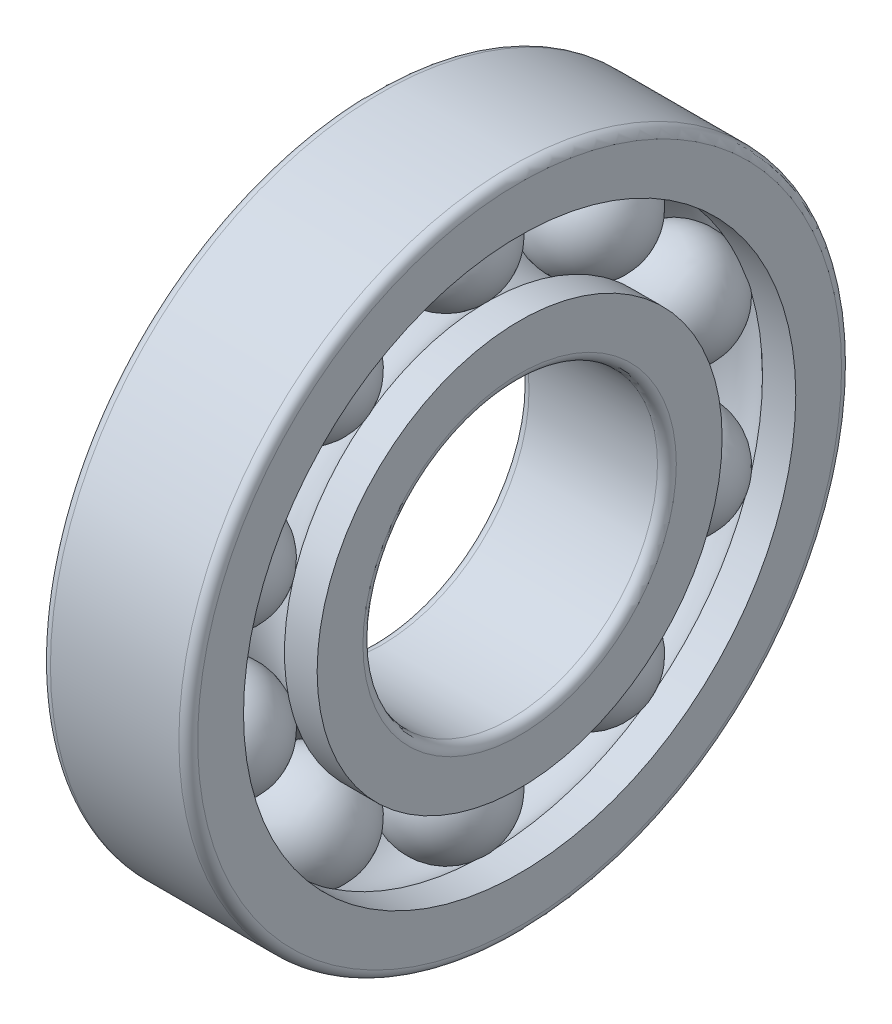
ISO-10303-21;
HEADER;
FILE_DESCRIPTION(('STEP AP214'),'2;1');
FILE_NAME('part.step','',(''),(''),'','','');
FILE_SCHEMA(('AUTOMOTIVE_DESIGN { 1 0 10303 214 1 1 1 1 }'));
ENDSEC;
DATA;
#1=APPLICATION_CONTEXT('core data for automotive mechanical design processes');
#2=APPLICATION_PROTOCOL_DEFINITION('international standard','automotive_design',2000,#1);
#3=PRODUCT_CONTEXT('',#1,'mechanical');
#4=PRODUCT('Part','Part','',(#3));
#5=PRODUCT_RELATED_PRODUCT_CATEGORY('part','',(#4));
#6=PRODUCT_DEFINITION_FORMATION('','',#4);
#7=PRODUCT_DEFINITION_CONTEXT('part definition',#1,'design');
#8=PRODUCT_DEFINITION('design','',#6,#7);
#9=PRODUCT_DEFINITION_SHAPE('','',#8);
#10=(LENGTH_UNIT() NAMED_UNIT(*) SI_UNIT(.MILLI.,.METRE.));
#11=(NAMED_UNIT(*) PLANE_ANGLE_UNIT() SI_UNIT($,.RADIAN.));
#12=(NAMED_UNIT(*) SI_UNIT($,.STERADIAN.) SOLID_ANGLE_UNIT());
#13=UNCERTAINTY_MEASURE_WITH_UNIT(LENGTH_MEASURE(1.E-05),#10,'distance_accuracy_value','');
#14=(GEOMETRIC_REPRESENTATION_CONTEXT(3) GLOBAL_UNCERTAINTY_ASSIGNED_CONTEXT((#13)) GLOBAL_UNIT_ASSIGNED_CONTEXT((#10,
#11,#12)) REPRESENTATION_CONTEXT('',''));
#15=CARTESIAN_POINT('',(0.,0.,0.));
#16=DIRECTION('',(0.,0.,1.));
#17=DIRECTION('',(1.,0.,0.));
#18=AXIS2_PLACEMENT_3D('',#15,#16,#17);
#19=CARTESIAN_POINT('',(0.0254,0.,0.));
#20=DIRECTION('',(1.,0.,0.));
#21=DIRECTION('',(0.,0.,-1.));
#22=AXIS2_PLACEMENT_3D('',#19,#20,#21);
#23=TOROIDAL_SURFACE('',#22,10.31875,2.35585);
#24=CARTESIAN_POINT('',(1.76605303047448,0.,0.));
#25=DIRECTION('',(1.,0.,0.));
#26=DIRECTION('',(0.,0.,-1.));
#27=AXIS2_PLACEMENT_3D('',#24,#25,#26);
#28=CIRCLE('',#27,8.73125);
#29=CARTESIAN_POINT('',(1.76605303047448,6.9669252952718,5.26276338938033));
#30=VERTEX_POINT('',#29);
#31=CARTESIAN_POINT('',(1.76605303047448,2.85228710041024,8.25222302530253));
#32=VERTEX_POINT('',#31);
#33=EDGE_CURVE('E736',#30,#32,#28,.T.);
#34=ORIENTED_EDGE('',*,*,#33,.F.);
#35=CARTESIAN_POINT('',(1.76625303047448,6.96711746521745,5.26287286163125));
#36=CARTESIAN_POINT('',(1.72141495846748,6.9240299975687,5.23832745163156));
#37=CARTESIAN_POINT('',(1.67450980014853,6.8825414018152,5.21483812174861));
#38=CARTESIAN_POINT('',(1.57686374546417,6.80298893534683,5.1701524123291));
#39=CARTESIAN_POINT('',(1.52612299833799,6.76492493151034,5.14895594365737));
#40=CARTESIAN_POINT('',(1.36875707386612,6.65632104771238,5.08913794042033));
#41=CARTESIAN_POINT('',(1.25684322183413,6.59123038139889,5.05420834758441));
#42=CARTESIAN_POINT('',(1.02225208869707,6.47742854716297,4.99561190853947));
#43=CARTESIAN_POINT('',(0.899569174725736,6.42872601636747,4.971950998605));
#44=CARTESIAN_POINT('',(0.646947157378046,6.34891209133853,4.93688163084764));
#45=CARTESIAN_POINT('',(0.517009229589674,6.31779785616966,4.92547119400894));
#46=CARTESIAN_POINT('',(0.253818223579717,6.27392244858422,4.91553756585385));
#47=CARTESIAN_POINT('',(0.120571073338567,6.26113057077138,4.91699278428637));
#48=CARTESIAN_POINT('',(-0.145641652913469,6.25401380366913,4.93296789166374));
#49=CARTESIAN_POINT('',(-0.278607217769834,6.25968963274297,4.94748828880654));
#50=CARTESIAN_POINT('',(-0.540044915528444,6.28917663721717,4.98935624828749));
#51=CARTESIAN_POINT('',(-0.66852895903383,6.31293518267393,5.01666649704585));
#52=CARTESIAN_POINT('',(-0.917712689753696,6.37773575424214,5.08351124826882));
#53=CARTESIAN_POINT('',(-1.03841296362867,6.41877647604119,5.12304482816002));
#54=CARTESIAN_POINT('',(-1.25799308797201,6.51238261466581,5.20921174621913));
#55=CARTESIAN_POINT('',(-1.35785883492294,6.5635416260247,5.25485822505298));
#56=CARTESIAN_POINT('',(-1.49887283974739,6.649191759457,5.32948549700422));
#57=CARTESIAN_POINT('',(-1.54442973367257,6.67924076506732,5.35539901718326));
#58=CARTESIAN_POINT('',(-1.63237579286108,6.74214131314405,5.40914483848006));
#59=CARTESIAN_POINT('',(-1.67476460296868,6.77499316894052,5.43697735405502));
#60=CARTESIAN_POINT('',(-1.71545303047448,6.80916048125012,5.46570124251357));
#61=B_SPLINE_CURVE_WITH_KNOTS('',3,(#35,#36,#37,#38,#39,#40,#41,#42,#43,#44,#45,#46,#47,#48,#49,
#50,#51,#52,#53,#54,#55,#56,#57,#58,#59,#60),.UNSPECIFIED.,.F.,.F.,(4,2,2,2,2,2,2,2,2,2,2,2,4),
(0.,0.200439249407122,0.400870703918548,0.801094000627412,1.20152789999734,1.60189710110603,
2.00159455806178,2.40130756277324,2.79986162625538,3.19838561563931,3.56027120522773,
3.74135774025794,3.92246454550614),.UNSPECIFIED.);
#62=CARTESIAN_POINT('',(-1.71525303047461,6.80899255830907,5.46556007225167));
#63=VERTEX_POINT('',#62);
#64=EDGE_CURVE('E531',#30,#63,#61,.T.);
#65=ORIENTED_EDGE('',*,*,#64,.T.);
#66=CARTESIAN_POINT('',(-1.71525303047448,0.,0.));
#67=DIRECTION('',(1.,0.,0.));
#68=DIRECTION('',(0.,0.,-1.));
#69=AXIS2_PLACEMENT_3D('',#66,#67,#68);
#70=CIRCLE('',#69,8.73125);
#71=CARTESIAN_POINT('',(-1.71525303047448,3.09396210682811,8.16468768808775));
#72=VERTEX_POINT('',#71);
#73=EDGE_CURVE('E738',#63,#72,#70,.T.);
#74=ORIENTED_EDGE('',*,*,#73,.T.);
#75=CARTESIAN_POINT('',(-1.7154530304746,3.09404447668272,8.16489101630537));
#76=CARTESIAN_POINT('',(-1.67080171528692,3.07565264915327,8.1194914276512));
#77=CARTESIAN_POINT('',(-1.62410657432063,3.05779344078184,8.07593272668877));
#78=CARTESIAN_POINT('',(-1.52692918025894,3.02323853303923,7.99276285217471));
#79=CARTESIAN_POINT('',(-1.47644713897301,3.00654276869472,7.95315145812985));
#80=CARTESIAN_POINT('',(-1.31994879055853,2.95840200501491,7.84076251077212));
#81=CARTESIAN_POINT('',(-1.20871978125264,2.92883763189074,7.77426735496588));
#82=CARTESIAN_POINT('',(-0.975704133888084,2.87551682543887,7.66014492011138));
#83=CARTESIAN_POINT('',(-0.853912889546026,2.85176294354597,7.61252592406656));
#84=CARTESIAN_POINT('',(-0.603236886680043,2.81055701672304,7.53752985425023));
#85=CARTESIAN_POINT('',(-0.474352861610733,2.79310432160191,7.51015069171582));
#86=CARTESIAN_POINT('',(-0.212965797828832,2.76475291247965,7.47643230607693));
#87=CARTESIAN_POINT('',(-0.0804576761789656,2.75386395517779,7.47012434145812));
#88=CARTESIAN_POINT('',(0.18423698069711,2.73871834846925,7.47885999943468));
#89=CARTESIAN_POINT('',(0.316423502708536,2.73446196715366,7.49390448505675));
#90=CARTESIAN_POINT('',(0.577088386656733,2.73239524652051,7.54505325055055));
#91=CARTESIAN_POINT('',(0.70555553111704,2.73460269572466,7.58121542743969));
#92=CARTESIAN_POINT('',(0.954754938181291,2.74510358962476,7.67368186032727));
#93=CARTESIAN_POINT('',(1.07548700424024,2.75339718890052,7.72998662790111));
#94=CARTESIAN_POINT('',(1.29790364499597,2.77473073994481,7.85673063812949));
#95=CARTESIAN_POINT('',(1.40032709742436,2.78740515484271,7.92593191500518));
#96=CARTESIAN_POINT('',(1.54477966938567,2.80953080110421,8.04055077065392));
#97=CARTESIAN_POINT('',(1.59141786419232,2.81742901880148,8.08057909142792));
#98=CARTESIAN_POINT('',(1.6813810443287,2.83418276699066,8.16402332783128));
#99=CARTESIAN_POINT('',(1.72470575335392,2.8430383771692,8.2074395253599));
#100=CARTESIAN_POINT('',(1.76625303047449,2.85233183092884,8.25243961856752));
#101=B_SPLINE_CURVE_WITH_KNOTS('',3,(#75,#76,#77,#78,#79,#80,#81,#82,#83,#84,#85,#86,#87,#88,
#89,#90,#91,#92,#93,#94,#95,#96,#97,#98,#99,#100),.UNSPECIFIED.,.F.,.F.,(4,2,2,2,2,2,2,2,2,2,2,
2,4),(0.,0.198719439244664,0.39742777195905,0.794139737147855,1.19102559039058,1.58787047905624,
1.98530381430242,2.38275321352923,2.7812974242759,3.17985175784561,3.55100379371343,
3.73673691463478,3.92248550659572),.UNSPECIFIED.);
#102=EDGE_CURVE('E514',#72,#32,#101,.T.);
#103=ORIENTED_EDGE('',*,*,#102,.T.);
#104=EDGE_LOOP('',(#34,#65,#74,#103));
#105=FACE_BOUND('',#104,.T.);
#106=ADVANCED_FACE('F32',(#105),#23,.F.);
#107=CARTESIAN_POINT('',(-1.71525303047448,8.72116630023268,0.419505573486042));
#108=VERTEX_POINT('',#107);
#109=CARTESIAN_POINT('',(-1.71525303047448,7.30215093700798,4.78678579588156));
#110=VERTEX_POINT('',#109);
#111=EDGE_CURVE('E748',#108,#110,#70,.T.);
#112=ORIENTED_EDGE('',*,*,#111,.T.);
#113=CARTESIAN_POINT('',(-1.71545303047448,7.30233708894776,4.78690187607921));
#114=CARTESIAN_POINT('',(-1.6708017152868,7.26077257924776,4.76098328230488));
#115=CARTESIAN_POINT('',(-1.62410657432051,7.22072101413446,4.73624093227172));
#116=CARTESIAN_POINT('',(-1.52692918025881,7.14387948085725,4.68926595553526));
#117=CARTESIAN_POINT('',(-1.47644713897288,7.10708933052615,4.66703318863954));
#118=CARTESIAN_POINT('',(-1.31994879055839,7.00208206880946,4.60440505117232));
#119=CARTESIAN_POINT('',(-1.2087197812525,6.93907911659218,4.56798684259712));
#120=CARTESIAN_POINT('',(-0.97570413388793,6.82886219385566,4.50700103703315));
#121=CARTESIAN_POINT('',(-0.853912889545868,6.78165515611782,4.48243864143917));
#122=CARTESIAN_POINT('',(-0.603236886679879,6.70423727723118,4.44598578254));
#123=CARTESIAN_POINT('',(-0.474352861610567,6.6740246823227,4.43409401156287));
#124=CARTESIAN_POINT('',(-0.212965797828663,6.63126874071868,4.4234798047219));
#125=CARTESIAN_POINT('',(-0.0804576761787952,6.61875166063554,4.42477692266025));
#126=CARTESIAN_POINT('',(0.18423698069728,6.61163329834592,4.44074658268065));
#127=CARTESIAN_POINT('',(0.316423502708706,6.61703274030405,4.45541966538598));
#128=CARTESIAN_POINT('',(0.577088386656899,6.64542521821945,4.49801467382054));
#129=CARTESIAN_POINT('',(0.705555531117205,6.66846667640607,4.52597298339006));
#130=CARTESIAN_POINT('',(0.954754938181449,6.73131248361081,4.59460762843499));
#131=CARTESIAN_POINT('',(1.07548700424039,6.7711172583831,4.63528428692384));
#132=CARTESIAN_POINT('',(1.29790364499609,6.86287472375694,4.72528279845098));
#133=CARTESIAN_POINT('',(1.40032709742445,6.91380403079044,4.77381797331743));
#134=CARTESIAN_POINT('',(1.54477966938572,6.99907532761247,4.85354144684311));
#135=CARTESIAN_POINT('',(1.59141786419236,7.02899317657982,4.88128258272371));
#136=CARTESIAN_POINT('',(1.68138104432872,7.09159453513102,4.93894278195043));
#137=CARTESIAN_POINT('',(1.72470575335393,7.12427827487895,4.96886202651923));
#138=CARTESIAN_POINT('',(1.76625303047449,7.15824722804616,4.99980531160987));
#139=B_SPLINE_CURVE_WITH_KNOTS('',3,(#113,#114,#115,#116,#117,#118,#119,#120,#121,#122,#123,
#124,#125,#126,#127,#128,#129,#130,#131,#132,#133,#134,#135,#136,#137,#138),.UNSPECIFIED.,.F.,
.F.,(4,2,2,2,2,2,2,2,2,2,2,2,4),(0.,0.198719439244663,0.397427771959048,0.794139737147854,
1.19102559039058,1.58787047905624,1.98530381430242,2.38275321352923,2.7812974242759,
3.17985175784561,3.55100379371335,3.73673691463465,3.92248550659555),.UNSPECIFIED.);
#140=CARTESIAN_POINT('',(1.76605303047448,7.15808372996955,4.99965637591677));
#141=VERTEX_POINT('',#140);
#142=EDGE_CURVE('E53',#110,#141,#139,.T.);
#143=ORIENTED_EDGE('',*,*,#142,.T.);
#144=CARTESIAN_POINT('',(1.76605303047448,8.72973566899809,0.162609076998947));
#145=VERTEX_POINT('',#144);
#146=EDGE_CURVE('E773',#145,#141,#28,.T.);
#147=ORIENTED_EDGE('',*,*,#146,.F.);
#148=CARTESIAN_POINT('',(-1.71545303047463,8.72138513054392,0.419521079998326));
#149=CARTESIAN_POINT('',(-1.67080171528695,8.67252416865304,0.416058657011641));
#150=CARTESIAN_POINT('',(-1.62410657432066,8.62557858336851,0.412533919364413));
#151=CARTESIAN_POINT('',(-1.52692918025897,8.53580127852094,0.405371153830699));
#152=CARTESIAN_POINT('',(-1.47644713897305,8.49296932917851,0.401733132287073));
#153=CARTESIAN_POINT('',(-1.31994879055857,8.37120477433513,0.390678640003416));
#154=CARTESIAN_POINT('',(-1.20871978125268,8.29882822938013,0.383109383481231));
#155=CARTESIAN_POINT('',(-0.975704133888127,8.17381430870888,0.367664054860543));
#156=CARTESIAN_POINT('',(-0.853912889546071,8.12118559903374,0.359787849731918));
#157=CARTESIAN_POINT('',(-0.603236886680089,8.03712676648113,0.343773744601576));
#158=CARTESIAN_POINT('',(-0.474352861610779,8.005694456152,0.335635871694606));
#159=CARTESIAN_POINT('',(-0.212965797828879,7.96486529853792,0.319091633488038));
#160=CARTESIAN_POINT('',(-0.0804576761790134,7.95550119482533,0.310684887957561));
#161=CARTESIAN_POINT('',(0.184236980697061,7.959129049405,0.293581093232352));
#162=CARTESIAN_POINT('',(0.316423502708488,7.97212191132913,0.284884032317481));
#163=CARTESIAN_POINT('',(0.577088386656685,8.02012862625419,0.267112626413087));
#164=CARTESIAN_POINT('',(0.705555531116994,8.05520303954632,0.258037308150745));
#165=CARTESIAN_POINT('',(0.954754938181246,8.14638879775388,0.239450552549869));
#166=CARTESIAN_POINT('',(1.07548700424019,8.2025006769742,0.229939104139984));
#167=CARTESIAN_POINT('',(1.29790364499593,8.32963382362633,0.211062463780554));
#168=CARTESIAN_POINT('',(1.40032709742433,8.39936475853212,0.201732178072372));
#169=CARTESIAN_POINT('',(1.54477966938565,8.51521096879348,0.187355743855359));
#170=CARTESIAN_POINT('',(1.59141786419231,8.55572084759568,0.182497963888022));
#171=CARTESIAN_POINT('',(1.68138104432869,8.64025822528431,0.172646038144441));
#172=CARTESIAN_POINT('',(1.72470575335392,8.68428601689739,0.167651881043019));
#173=CARTESIAN_POINT('',(1.76625303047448,8.72995548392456,0.162584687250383));
#174=B_SPLINE_CURVE_WITH_KNOTS('',3,(#148,#149,#150,#151,#152,#153,#154,#155,#156,#157,#158,
#159,#160,#161,#162,#163,#164,#165,#166,#167,#168,#169,#170,#171,#172,#173),.UNSPECIFIED.,.F.,
.F.,(4,2,2,2,2,2,2,2,2,2,2,2,4),(0.,0.198719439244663,0.397427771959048,0.794139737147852,
1.19102559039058,1.58787047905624,1.98530381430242,2.38275321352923,2.78129742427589,
3.17985175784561,3.55100379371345,3.73673691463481,3.92248550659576),.UNSPECIFIED.);
#175=EDGE_CURVE('E409',#108,#145,#174,.T.);
#176=ORIENTED_EDGE('',*,*,#175,.F.);
#177=EDGE_LOOP('',(#112,#143,#147,#176));
#178=FACE_BOUND('',#177,.T.);
#179=ADVANCED_FACE('F944',(#178),#23,.F.);
#180=CARTESIAN_POINT('',(-20.6375,0.,0.));
#181=DIRECTION('',(1.,0.,0.));
#182=DIRECTION('',(0.,0.,-1.));
#183=AXIS2_PLACEMENT_3D('',#180,#181,#182);
#184=CYLINDRICAL_SURFACE('',#183,8.73125);
#185=CARTESIAN_POINT('',(3.175,0.,0.));
#186=DIRECTION('',(1.,0.,0.));
#187=DIRECTION('',(0.,0.,-1.));
#188=AXIS2_PLACEMENT_3D('',#185,#186,#187);
#189=CIRCLE('',#188,8.73125);
#190=CARTESIAN_POINT('',(3.175,0.,-8.73125));
#191=VERTEX_POINT('',#190);
#192=EDGE_CURVE('E770',#191,#191,#189,.T.);
#193=ORIENTED_EDGE('',*,*,#192,.F.);
#194=EDGE_LOOP('',(#193));
#195=FACE_BOUND('',#194,.T.);
#196=ORIENTED_EDGE('',*,*,#146,.T.);
#197=CARTESIAN_POINT('',(1.76585303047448,7.15913008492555,4.99815795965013));
#198=CARTESIAN_POINT('',(1.77187031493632,7.12774753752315,5.04310870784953));
#199=CARTESIAN_POINT('',(1.77487895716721,7.09594738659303,5.08775604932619));
#200=CARTESIAN_POINT('',(1.77487895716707,7.03151187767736,5.17644391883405));
#201=CARTESIAN_POINT('',(1.77187031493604,6.9988765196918,5.22048444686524));
#202=CARTESIAN_POINT('',(1.76585303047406,6.96582355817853,5.26422156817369));
#203=B_SPLINE_CURVE_WITH_KNOTS('',3,(#197,#198,#199,#200,#201,#202),.UNSPECIFIED.,.F.,.F.,(4,2,
4),(0.,0.16469116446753,0.329382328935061),.UNSPECIFIED.);
#204=EDGE_CURVE('E1119',#141,#30,#203,.T.);
#205=ORIENTED_EDGE('',*,*,#204,.T.);
#206=ORIENTED_EDGE('',*,*,#33,.T.);
#207=CARTESIAN_POINT('',(1.76585303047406,2.85401436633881,8.25162581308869));
#208=CARTESIAN_POINT('',(1.77187031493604,2.80220396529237,8.26954553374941));
#209=CARTESIAN_POINT('',(1.77487895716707,2.75023405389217,8.28697433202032));
#210=CARTESIAN_POINT('',(1.77487895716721,2.6459752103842,8.32085008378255));
#211=CARTESIAN_POINT('',(1.77187031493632,2.59368627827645,8.33729703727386));
#212=CARTESIAN_POINT('',(1.76585303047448,2.54123783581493,8.35325306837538));
#213=B_SPLINE_CURVE_WITH_KNOTS('',3,(#207,#208,#209,#210,#211,#212),.UNSPECIFIED.,.F.,.F.,(4,2,
4),(0.,0.164691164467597,0.329382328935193),.UNSPECIFIED.);
#214=CARTESIAN_POINT('',(1.76605303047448,2.54298625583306,8.35272096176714));
#215=VERTEX_POINT('',#214);
#216=EDGE_CURVE('E718',#32,#215,#213,.T.);
#217=ORIENTED_EDGE('',*,*,#216,.T.);
#218=CARTESIAN_POINT('',(1.76605303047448,-2.54298625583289,8.35272096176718));
#219=VERTEX_POINT('',#218);
#220=EDGE_CURVE('E778',#215,#219,#28,.T.);
#221=ORIENTED_EDGE('',*,*,#220,.T.);
#222=CARTESIAN_POINT('',(1.76585303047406,-2.54123783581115,8.35325306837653));
#223=CARTESIAN_POINT('',(1.77187031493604,-2.59368627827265,8.33729703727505));
#224=CARTESIAN_POINT('',(1.77487895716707,-2.64597521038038,8.32085008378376));
#225=CARTESIAN_POINT('',(1.77487895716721,-2.75023405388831,8.2869743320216));
#226=CARTESIAN_POINT('',(1.77187031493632,-2.80220396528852,8.26954553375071));
#227=CARTESIAN_POINT('',(1.76585303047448,-2.85401436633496,8.25162581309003));
#228=B_SPLINE_CURVE_WITH_KNOTS('',3,(#222,#223,#224,#225,#226,#227),.UNSPECIFIED.,.F.,.F.,(4,2,
4),(0.,0.164691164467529,0.329382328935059),.UNSPECIFIED.);
#229=CARTESIAN_POINT('',(1.76605303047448,-2.85228710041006,8.2522230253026));
#230=VERTEX_POINT('',#229);
#231=EDGE_CURVE('E804',#219,#230,#228,.T.);
#232=ORIENTED_EDGE('',*,*,#231,.T.);
#233=CARTESIAN_POINT('',(1.76605303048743,-6.96692529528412,5.26276338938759));
#234=VERTEX_POINT('',#233);
#235=EDGE_CURVE('E796',#230,#234,#28,.T.);
#236=ORIENTED_EDGE('',*,*,#235,.T.);
#237=CARTESIAN_POINT('',(1.76585303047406,-6.9658235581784,5.26422156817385));
#238=CARTESIAN_POINT('',(1.77187031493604,-6.99887651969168,5.2204844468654));
#239=CARTESIAN_POINT('',(1.77487895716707,-7.03151187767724,5.17644391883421));
#240=CARTESIAN_POINT('',(1.77487895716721,-7.09594738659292,5.08775604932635));
#241=CARTESIAN_POINT('',(1.77187031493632,-7.12774753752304,5.04310870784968));
#242=CARTESIAN_POINT('',(1.76585303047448,-7.15913008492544,4.99815795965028));
#243=B_SPLINE_CURVE_WITH_KNOTS('',3,(#237,#238,#239,#240,#241,#242),.UNSPECIFIED.,.F.,.F.,(4,2,
4),(0.,0.164691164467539,0.329382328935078),.UNSPECIFIED.);
#244=CARTESIAN_POINT('',(1.76605303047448,-7.15808372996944,4.99965637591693));
#245=VERTEX_POINT('',#244);
#246=EDGE_CURVE('E931',#234,#245,#243,.T.);
#247=ORIENTED_EDGE('',*,*,#246,.T.);
#248=CARTESIAN_POINT('',(1.76605303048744,-8.72973566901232,0.162609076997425));
#249=VERTEX_POINT('',#248);
#250=EDGE_CURVE('E792',#245,#249,#28,.T.);
#251=ORIENTED_EDGE('',*,*,#250,.T.);
#252=CARTESIAN_POINT('',(1.76585303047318,-8.72970144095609,0.164436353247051));
#253=CARTESIAN_POINT('',(1.77187031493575,-8.73073381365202,0.1096242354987));
#254=CARTESIAN_POINT('',(1.77487895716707,-8.73124999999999,0.0548121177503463));
#255=CARTESIAN_POINT('',(1.77487895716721,-8.73125000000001,-0.0548121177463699));
#256=CARTESIAN_POINT('',(1.77187031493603,-8.73073381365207,-0.109624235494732));
#257=CARTESIAN_POINT('',(1.7658530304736,-8.72970144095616,-0.164436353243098));
#258=B_SPLINE_CURVE_WITH_KNOTS('',3,(#252,#253,#254,#255,#256,#257),.UNSPECIFIED.,.F.,.F.,(4,2,
4),(0.,0.164691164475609,0.329382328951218),.UNSPECIFIED.);
#259=CARTESIAN_POINT('',(1.76605303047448,-8.72973566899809,-0.162609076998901));
#260=VERTEX_POINT('',#259);
#261=EDGE_CURVE('E1064',#249,#260,#258,.T.);
#262=ORIENTED_EDGE('',*,*,#261,.T.);
#263=CARTESIAN_POINT('',(1.76605303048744,-7.1580837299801,-4.99965637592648));
#264=VERTEX_POINT('',#263);
#265=EDGE_CURVE('E788',#260,#264,#28,.T.);
#266=ORIENTED_EDGE('',*,*,#265,.T.);
#267=CARTESIAN_POINT('',(1.76585303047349,-7.15913008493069,-4.99815795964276));
#268=CARTESIAN_POINT('',(1.77187031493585,-7.12774753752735,-5.04310870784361));
#269=CARTESIAN_POINT('',(1.77487895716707,-7.09594738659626,-5.08775604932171));
#270=CARTESIAN_POINT('',(1.77487895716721,-7.03151187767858,-5.17644391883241));
#271=CARTESIAN_POINT('',(1.77187031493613,-6.99887651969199,-5.220484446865));
#272=CARTESIAN_POINT('',(1.76585303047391,-6.96582355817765,-5.26422156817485));
#273=B_SPLINE_CURVE_WITH_KNOTS('',3,(#267,#268,#269,#270,#271,#272),.UNSPECIFIED.,.F.,.F.,(4,2,
4),(0.,0.164691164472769,0.329382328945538),.UNSPECIFIED.);
#274=CARTESIAN_POINT('',(1.76605303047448,-6.96692529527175,-5.2627633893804));
#275=VERTEX_POINT('',#274);
#276=EDGE_CURVE('E1051',#264,#275,#273,.T.);
#277=ORIENTED_EDGE('',*,*,#276,.T.);
#278=CARTESIAN_POINT('',(1.76605303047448,-2.85228710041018,-8.25222302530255));
#279=VERTEX_POINT('',#278);
#280=EDGE_CURVE('E784',#275,#279,#28,.T.);
#281=ORIENTED_EDGE('',*,*,#280,.T.);
#282=CARTESIAN_POINT('',(1.76585303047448,-2.85401436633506,-8.25162581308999));
#283=CARTESIAN_POINT('',(1.77187031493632,-2.80220396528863,-8.26954553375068));
#284=CARTESIAN_POINT('',(1.77487895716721,-2.75023405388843,-8.28697433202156));
#285=CARTESIAN_POINT('',(1.77487895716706,-2.64597521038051,-8.32085008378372));
#286=CARTESIAN_POINT('',(1.77187031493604,-2.59368627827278,-8.337297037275));
#287=CARTESIAN_POINT('',(1.76585303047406,-2.54123783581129,-8.35325306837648));
#288=B_SPLINE_CURVE_WITH_KNOTS('',3,(#282,#283,#284,#285,#286,#287),.UNSPECIFIED.,.F.,.F.,(4,2,
4),(0.,0.16469116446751,0.32938232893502),.UNSPECIFIED.);
#289=CARTESIAN_POINT('',(1.76605303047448,-2.54298625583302,-8.35272096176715));
#290=VERTEX_POINT('',#289);
#291=EDGE_CURVE('E1014',#279,#290,#288,.T.);
#292=ORIENTED_EDGE('',*,*,#291,.T.);
#293=CARTESIAN_POINT('',(1.76605303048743,2.54298625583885,-8.35272096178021));
#294=VERTEX_POINT('',#293);
#295=EDGE_CURVE('E781',#290,#294,#28,.T.);
#296=ORIENTED_EDGE('',*,*,#295,.T.);
#297=CARTESIAN_POINT('',(1.76585303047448,2.54123783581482,-8.35325306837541));
#298=CARTESIAN_POINT('',(1.77187031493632,2.59368627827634,-8.3372970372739));
#299=CARTESIAN_POINT('',(1.77487895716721,2.64597521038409,-8.32085008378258));
#300=CARTESIAN_POINT('',(1.77487895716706,2.75023405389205,-8.28697433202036));
#301=CARTESIAN_POINT('',(1.77187031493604,2.80220396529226,-8.26954553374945));
#302=CARTESIAN_POINT('',(1.76585303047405,2.85401436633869,-8.25162581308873));
#303=B_SPLINE_CURVE_WITH_KNOTS('',3,(#297,#298,#299,#300,#301,#302),.UNSPECIFIED.,.F.,.F.,(4,2,
4),(0.,0.164691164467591,0.329382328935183),.UNSPECIFIED.);
#304=CARTESIAN_POINT('',(1.76605303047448,2.85228710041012,-8.25222302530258));
#305=VERTEX_POINT('',#304);
#306=EDGE_CURVE('E1003',#294,#305,#303,.T.);
#307=ORIENTED_EDGE('',*,*,#306,.T.);
#308=CARTESIAN_POINT('',(1.76605303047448,6.96692529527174,-5.26276338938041));
#309=VERTEX_POINT('',#308);
#310=EDGE_CURVE('E779',#305,#309,#28,.T.);
#311=ORIENTED_EDGE('',*,*,#310,.T.);
#312=CARTESIAN_POINT('',(1.76585303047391,6.96582355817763,-5.26422156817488));
#313=CARTESIAN_POINT('',(1.77187031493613,6.99887651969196,-5.22048444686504));
#314=CARTESIAN_POINT('',(1.7748789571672,7.03151187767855,-5.17644391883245));
#315=CARTESIAN_POINT('',(1.77487895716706,7.09594738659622,-5.08775604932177));
#316=CARTESIAN_POINT('',(1.77187031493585,7.1277475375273,-5.04310870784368));
#317=CARTESIAN_POINT('',(1.76585303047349,7.15913008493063,-4.99815795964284));
#318=B_SPLINE_CURVE_WITH_KNOTS('',3,(#312,#313,#314,#315,#316,#317),.UNSPECIFIED.,.F.,.F.,(4,2,
4),(0.,0.16469116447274,0.32938232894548),.UNSPECIFIED.);
#319=CARTESIAN_POINT('',(1.76605303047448,7.15808372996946,-4.9996563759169));
#320=VERTEX_POINT('',#319);
#321=EDGE_CURVE('E321',#309,#320,#318,.T.);
#322=ORIENTED_EDGE('',*,*,#321,.T.);
#323=CARTESIAN_POINT('',(1.76605303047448,8.72973566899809,-0.162609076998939));
#324=VERTEX_POINT('',#323);
#325=EDGE_CURVE('E772',#320,#324,#28,.T.);
#326=ORIENTED_EDGE('',*,*,#325,.T.);
#327=CARTESIAN_POINT('',(1.76585303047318,8.72970144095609,0.164436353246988));
#328=CARTESIAN_POINT('',(1.77187031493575,8.73073381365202,0.109624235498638));
#329=CARTESIAN_POINT('',(1.77487895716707,8.73124999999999,0.0548121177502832));
#330=CARTESIAN_POINT('',(1.77487895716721,8.73125000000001,-0.0548121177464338));
#331=CARTESIAN_POINT('',(1.77187031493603,8.73073381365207,-0.109624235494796));
#332=CARTESIAN_POINT('',(1.7658530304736,8.72970144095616,-0.164436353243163));
#333=B_SPLINE_CURVE_WITH_KNOTS('',3,(#327,#328,#329,#330,#331,#332),.UNSPECIFIED.,.F.,.F.,(4,2,
4),(0.,0.16469116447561,0.329382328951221),.UNSPECIFIED.);
#334=EDGE_CURVE('E1110',#145,#324,#333,.T.);
#335=ORIENTED_EDGE('',*,*,#334,.F.);
#336=EDGE_LOOP('',(#196,#205,#206,#217,#221,#232,#236,#247,#251,#262,#266,#277,#281,#292,#296,
#307,#311,#322,#326,#335));
#337=FACE_BOUND('',#336,.T.);
#338=ADVANCED_FACE('F343',(#195,#337),#184,.T.);
#339=CARTESIAN_POINT('',(-20.6375,0.,0.));
#340=DIRECTION('',(1.,0.,0.));
#341=DIRECTION('',(0.,0.,-1.));
#342=AXIS2_PLACEMENT_3D('',#339,#340,#341);
#343=CYLINDRICAL_SURFACE('',#342,8.73125);
#344=CARTESIAN_POINT('',(-3.175,0.,0.));
#345=DIRECTION('',(1.,0.,0.));
#346=DIRECTION('',(0.,0.,-1.));
#347=AXIS2_PLACEMENT_3D('',#344,#345,#346);
#348=CIRCLE('',#347,8.73125);
#349=CARTESIAN_POINT('',(-3.175,0.,-8.73125));
#350=VERTEX_POINT('',#349);
#351=EDGE_CURVE('E753',#350,#350,#348,.T.);
#352=ORIENTED_EDGE('',*,*,#351,.T.);
#353=EDGE_LOOP('',(#352));
#354=FACE_BOUND('',#353,.T.);
#355=ORIENTED_EDGE('',*,*,#73,.F.);
#356=CARTESIAN_POINT('',(-1.7150530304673,6.80855977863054,5.46609918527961));
#357=CARTESIAN_POINT('',(-1.72684819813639,6.83406283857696,5.43433464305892));
#358=CARTESIAN_POINT('',(-1.73694262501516,6.85963563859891,5.40202311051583));
#359=CARTESIAN_POINT('',(-1.75364993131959,6.91075062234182,5.33647624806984));
#360=CARTESIAN_POINT('',(-1.76026197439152,6.93629279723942,5.30324069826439));
#361=CARTESIAN_POINT('',(-1.77450926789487,7.0113468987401,5.20408182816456));
#362=CARTESIAN_POINT('',(-1.7771405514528,7.06055987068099,5.13712303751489));
#363=CARTESIAN_POINT('',(-1.76997140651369,7.14204610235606,5.0228721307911));
#364=CARTESIAN_POINT('',(-1.76368999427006,7.17494127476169,4.97575645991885));
#365=CARTESIAN_POINT('',(-1.74445722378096,7.23974333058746,4.88100649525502));
#366=CARTESIAN_POINT('',(-1.73139526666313,7.2716242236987,4.83337683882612));
#367=CARTESIAN_POINT('',(-1.7150530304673,7.3025299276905,4.78620760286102));
#368=B_SPLINE_CURVE_WITH_KNOTS('',3,(#356,#357,#358,#359,#360,#361,#362,#363,#364,#365,#366,
#367),.UNSPECIFIED.,.F.,.F.,(4,2,2,2,2,4),(0.,0.12714503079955,0.25432058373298,
0.502408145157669,0.675467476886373,0.851442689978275),.UNSPECIFIED.);
#369=EDGE_CURVE('E532',#63,#110,#368,.T.);
#370=ORIENTED_EDGE('',*,*,#369,.T.);
#371=ORIENTED_EDGE('',*,*,#111,.F.);
#372=CARTESIAN_POINT('',(-1.71505303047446,8.72113305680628,-0.420196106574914));
#373=CARTESIAN_POINT('',(-1.72684819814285,8.72309473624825,-0.379507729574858));
#374=CARTESIAN_POINT('',(-1.73694262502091,8.72479132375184,-0.338335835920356));
#375=CARTESIAN_POINT('',(-1.75364993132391,8.72761673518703,-0.255262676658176));
#376=CARTESIAN_POINT('',(-1.76026197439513,8.72874542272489,-0.213361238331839));
#377=CARTESIAN_POINT('',(-1.77450926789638,8.73118134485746,-0.0890243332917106));
#378=CARTESIAN_POINT('',(-1.7771405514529,8.73163808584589,-0.005926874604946));
#379=CARTESIAN_POINT('',(-1.76997140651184,8.73040683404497,0.134400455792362));
#380=CARTESIAN_POINT('',(-1.76368999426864,8.72932569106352,0.191853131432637));
#381=CARTESIAN_POINT('',(-1.74445722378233,8.72605902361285,0.306597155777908));
#382=CARTESIAN_POINT('',(-1.73139526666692,8.72385519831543,0.363869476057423));
#383=CARTESIAN_POINT('',(-1.71505303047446,8.72113305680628,0.420196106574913));
#384=B_SPLINE_CURVE_WITH_KNOTS('',3,(#372,#373,#374,#375,#376,#377,#378,#379,#380,#381,#382,
#383),.UNSPECIFIED.,.F.,.F.,(4,2,2,2,2,4),(0.,0.127145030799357,0.2543205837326,
0.502408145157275,0.675467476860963,0.851442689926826),.UNSPECIFIED.);
#385=CARTESIAN_POINT('',(-1.71525303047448,8.7211663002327,-0.419505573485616));
#386=VERTEX_POINT('',#385);
#387=EDGE_CURVE('E647',#386,#108,#384,.T.);
#388=ORIENTED_EDGE('',*,*,#387,.F.);
#389=CARTESIAN_POINT('',(-1.71525303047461,7.30215093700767,-4.78678579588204));
#390=VERTEX_POINT('',#389);
#391=EDGE_CURVE('E754',#390,#386,#70,.T.);
#392=ORIENTED_EDGE('',*,*,#391,.F.);
#393=CARTESIAN_POINT('',(-1.7150530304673,7.30252992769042,-4.78620760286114));
#394=CARTESIAN_POINT('',(-1.72684819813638,7.28020093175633,-4.82027823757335));
#395=CARTESIAN_POINT('',(-1.73694262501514,7.25737326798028,-4.85458422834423));
#396=CARTESIAN_POINT('',(-1.75364993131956,7.21082989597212,-4.92345256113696));
#397=CARTESIAN_POINT('',(-1.7602619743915,7.18711397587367,-4.95801496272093));
#398=CARTESIAN_POINT('',(-1.77450926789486,7.11600127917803,-5.06003743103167));
#399=CARTESIAN_POINT('',(-1.7771405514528,7.06752732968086,-5.12753315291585));
#400=CARTESIAN_POINT('',(-1.76997140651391,6.98404889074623,-5.24033663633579));
#401=CARTESIAN_POINT('',(-1.76368999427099,6.94940439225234,-5.28618134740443));
#402=CARTESIAN_POINT('',(-1.74445722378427,6.87931675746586,-5.37709111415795));
#403=CARTESIAN_POINT('',(-1.73139526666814,6.84387000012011,-5.42213001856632));
#404=CARTESIAN_POINT('',(-1.71505303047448,6.808559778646,-5.46609918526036));
#405=B_SPLINE_CURVE_WITH_KNOTS('',3,(#393,#394,#395,#396,#397,#398,#399,#400,#401,#402,#403,
#404),.UNSPECIFIED.,.F.,.F.,(4,2,2,2,2,4),(0.,0.127145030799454,0.254320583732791,
0.502408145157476,0.675467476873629,0.851442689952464),.UNSPECIFIED.);
#406=CARTESIAN_POINT('',(-1.71525303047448,6.80899255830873,-5.4655600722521));
#407=VERTEX_POINT('',#406);
#408=EDGE_CURVE('E390',#390,#407,#405,.T.);
#409=ORIENTED_EDGE('',*,*,#408,.T.);
#410=CARTESIAN_POINT('',(-1.71525303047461,3.09396210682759,-8.16468768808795));
#411=VERTEX_POINT('',#410);
#412=EDGE_CURVE('E882',#411,#407,#70,.T.);
#413=ORIENTED_EDGE('',*,*,#412,.F.);
#414=CARTESIAN_POINT('',(-1.71505303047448,3.09460857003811,-8.16444268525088));
#415=CARTESIAN_POINT('',(-1.72684819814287,3.05651781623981,-8.1788817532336));
#416=CARTESIAN_POINT('',(-1.73694262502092,3.01788529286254,-8.19321811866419));
#417=CARTESIAN_POINT('',(-1.75364993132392,2.9397511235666,-8.22157626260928));
#418=CARTESIAN_POINT('',(-1.76026197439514,2.90024927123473,-8.23559796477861));
#419=CARTESIAN_POINT('',(-1.77450926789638,2.78275058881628,-8.27633688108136));
#420=CARTESIAN_POINT('',(-1.7771405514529,2.70386134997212,-8.30244979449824));
#421=CARTESIAN_POINT('',(-1.76997140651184,2.57002165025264,-8.34464233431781));
#422=CARTESIAN_POINT('',(-1.76368999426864,2.51504681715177,-8.36136795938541));
#423=CARTESIAN_POINT('',(-1.74445722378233,2.40490930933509,-8.39371902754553));
#424=CARTESIAN_POINT('',(-1.73139526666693,2.3497590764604,-8.40932118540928));
#425=CARTESIAN_POINT('',(-1.71505303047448,2.2953480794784,-8.42413816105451));
#426=B_SPLINE_CURVE_WITH_KNOTS('',3,(#414,#415,#416,#417,#418,#419,#420,#421,#422,#423,#424,
#425),.UNSPECIFIED.,.F.,.F.,(4,2,2,2,2,4),(0.,0.127145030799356,0.254320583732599,
0.502408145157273,0.675467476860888,0.851442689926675),.UNSPECIFIED.);
#427=CARTESIAN_POINT('',(-1.71525303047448,2.29601508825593,-8.42395639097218));
#428=VERTEX_POINT('',#427);
#429=EDGE_CURVE('E655',#411,#428,#426,.T.);
#430=ORIENTED_EDGE('',*,*,#429,.T.);
#431=CARTESIAN_POINT('',(-1.71525303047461,-2.2960150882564,-8.42395639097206));
#432=VERTEX_POINT('',#431);
#433=EDGE_CURVE('E1450',#432,#428,#70,.T.);
#434=ORIENTED_EDGE('',*,*,#433,.F.);
#435=CARTESIAN_POINT('',(-1.71505303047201,-2.29534807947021,-8.42413816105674));
#436=CARTESIAN_POINT('',(-1.72684819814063,-2.33465121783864,-8.4134304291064));
#437=CARTESIAN_POINT('',(-1.73694262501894,-2.37433228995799,-8.40232116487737));
#438=CARTESIAN_POINT('',(-1.75364993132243,-2.45421265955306,-8.37933727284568));
#439=CARTESIAN_POINT('',(-1.7602619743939,-2.49441207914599,-8.36746246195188));
#440=CARTESIAN_POINT('',(-1.77450926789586,-2.61341624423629,-8.331356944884));
#441=CARTESIAN_POINT('',(-1.77714055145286,-2.69258776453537,-8.3061128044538));
#442=CARTESIAN_POINT('',(-1.76997140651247,-2.82566650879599,-8.26157828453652));
#443=CARTESIAN_POINT('',(-1.76368999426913,-2.87997315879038,-8.24279620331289));
#444=CARTESIAN_POINT('',(-1.74445722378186,-2.98809175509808,-8.20423156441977));
#445=CARTESIAN_POINT('',(-1.73139526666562,-3.04187994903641,-8.1844374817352));
#446=CARTESIAN_POINT('',(-1.71505303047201,-3.09460857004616,-8.16444268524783));
#447=B_SPLINE_CURVE_WITH_KNOTS('',3,(#435,#436,#437,#438,#439,#440,#441,#442,#443,#444,#445,
#446),.UNSPECIFIED.,.F.,.F.,(4,2,2,2,2,4),(0.,0.127145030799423,0.25432058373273,
0.50240814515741,0.675467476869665,0.851442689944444),.UNSPECIFIED.);
#448=CARTESIAN_POINT('',(-1.71525303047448,-3.09396210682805,-8.16468768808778));
#449=VERTEX_POINT('',#448);
#450=EDGE_CURVE('E660',#432,#449,#447,.T.);
#451=ORIENTED_EDGE('',*,*,#450,.T.);
#452=CARTESIAN_POINT('',(-1.71525303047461,-6.80899255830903,-5.46556007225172));
#453=VERTEX_POINT('',#452);
#454=EDGE_CURVE('E1449',#453,#449,#70,.T.);
#455=ORIENTED_EDGE('',*,*,#454,.F.);
#456=CARTESIAN_POINT('',(-1.71505303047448,-6.80855977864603,-5.46609918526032));
#457=CARTESIAN_POINT('',(-1.72684819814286,-6.83406283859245,-5.43433464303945));
#458=CARTESIAN_POINT('',(-1.73694262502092,-6.85963563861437,-5.40202311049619));
#459=CARTESIAN_POINT('',(-1.75364993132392,-6.91075062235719,-5.33647624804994));
#460=CARTESIAN_POINT('',(-1.76026197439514,-6.93629279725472,-5.30324069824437));
#461=CARTESIAN_POINT('',(-1.77450926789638,-7.01134689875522,-5.20408182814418));
#462=CARTESIAN_POINT('',(-1.7771405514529,-7.06055987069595,-5.13712303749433));
#463=CARTESIAN_POINT('',(-1.76997140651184,-7.14204610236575,-5.02287213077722));
#464=CARTESIAN_POINT('',(-1.76368999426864,-7.17494127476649,-4.97575645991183));
#465=CARTESIAN_POINT('',(-1.74445722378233,-7.23974333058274,-4.88100649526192));
#466=CARTESIAN_POINT('',(-1.73139526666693,-7.27162422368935,-4.83337683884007));
#467=CARTESIAN_POINT('',(-1.71505303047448,-7.30252992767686,-4.78620760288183));
#468=B_SPLINE_CURVE_WITH_KNOTS('',3,(#456,#457,#458,#459,#460,#461,#462,#463,#464,#465,#466,
#467),.UNSPECIFIED.,.F.,.F.,(4,2,2,2,2,4),(0.,0.127145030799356,0.254320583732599,
0.502408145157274,0.675467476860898,0.851442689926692),.UNSPECIFIED.);
#469=CARTESIAN_POINT('',(-1.71525303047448,-7.30215093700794,-4.78678579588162));
#470=VERTEX_POINT('',#469);
#471=EDGE_CURVE('E665',#453,#470,#468,.T.);
#472=ORIENTED_EDGE('',*,*,#471,.T.);
#473=CARTESIAN_POINT('',(-1.71525303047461,-8.7211663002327,-0.419505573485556));
#474=VERTEX_POINT('',#473);
#475=EDGE_CURVE('E1076',#474,#470,#70,.T.);
#476=ORIENTED_EDGE('',*,*,#475,.F.);
#477=CARTESIAN_POINT('',(-1.71505303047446,-8.72113305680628,-0.420196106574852));
#478=CARTESIAN_POINT('',(-1.72684819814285,-8.72309473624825,-0.379507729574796));
#479=CARTESIAN_POINT('',(-1.73694262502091,-8.72479132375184,-0.338335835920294));
#480=CARTESIAN_POINT('',(-1.75364993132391,-8.72761673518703,-0.255262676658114));
#481=CARTESIAN_POINT('',(-1.76026197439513,-8.72874542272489,-0.213361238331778));
#482=CARTESIAN_POINT('',(-1.77450926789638,-8.73118134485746,-0.089024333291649));
#483=CARTESIAN_POINT('',(-1.7771405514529,-8.73163808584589,-0.00592687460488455));
#484=CARTESIAN_POINT('',(-1.76997140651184,-8.73040683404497,0.134400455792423));
#485=CARTESIAN_POINT('',(-1.76368999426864,-8.72932569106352,0.191853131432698));
#486=CARTESIAN_POINT('',(-1.74445722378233,-8.72605902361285,0.306597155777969));
#487=CARTESIAN_POINT('',(-1.73139526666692,-8.72385519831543,0.363869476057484));
#488=CARTESIAN_POINT('',(-1.71505303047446,-8.72113305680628,0.420196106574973));
#489=B_SPLINE_CURVE_WITH_KNOTS('',3,(#477,#478,#479,#480,#481,#482,#483,#484,#485,#486,#487,
#488),.UNSPECIFIED.,.F.,.F.,(4,2,2,2,2,4),(0.,0.127145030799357,0.2543205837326,
0.502408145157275,0.675467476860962,0.851442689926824),.UNSPECIFIED.);
#490=CARTESIAN_POINT('',(-1.71525303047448,-8.72116630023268,0.419505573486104));
#491=VERTEX_POINT('',#490);
#492=EDGE_CURVE('E670',#474,#491,#489,.T.);
#493=ORIENTED_EDGE('',*,*,#492,.T.);
#494=CARTESIAN_POINT('',(-1.71525303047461,-7.30215093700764,4.78678579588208));
#495=VERTEX_POINT('',#494);
#496=EDGE_CURVE('E749',#495,#491,#70,.T.);
#497=ORIENTED_EDGE('',*,*,#496,.F.);
#498=CARTESIAN_POINT('',(-1.71505303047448,-7.30252992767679,4.78620760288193));
#499=CARTESIAN_POINT('',(-1.72684819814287,-7.28020093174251,4.82027823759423));
#500=CARTESIAN_POINT('',(-1.73694262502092,-7.25737326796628,4.85458422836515));
#501=CARTESIAN_POINT('',(-1.75364993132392,-7.2108298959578,4.92345256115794));
#502=CARTESIAN_POINT('',(-1.76026197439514,-7.1871139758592,4.9580149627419));
#503=CARTESIAN_POINT('',(-1.77450926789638,-7.11600127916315,5.0600374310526));
#504=CARTESIAN_POINT('',(-1.7771405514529,-7.06752732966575,5.12753315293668));
#505=CARTESIAN_POINT('',(-1.76997140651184,-6.98404889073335,5.24033663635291));
#506=CARTESIAN_POINT('',(-1.76368999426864,-6.94940439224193,5.28618134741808));
#507=CARTESIAN_POINT('',(-1.74445722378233,-6.87931675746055,5.37709111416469));
#508=CARTESIAN_POINT('',(-1.73139526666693,-6.84387000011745,5.42213001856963));
#509=CARTESIAN_POINT('',(-1.71505303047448,-6.80855977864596,5.46609918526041));
#510=B_SPLINE_CURVE_WITH_KNOTS('',3,(#498,#499,#500,#501,#502,#503,#504,#505,#506,#507,#508,
#509),.UNSPECIFIED.,.F.,.F.,(4,2,2,2,2,4),(0.,0.127145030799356,0.254320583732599,
0.502408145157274,0.675467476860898,0.851442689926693),.UNSPECIFIED.);
#511=CARTESIAN_POINT('',(-1.71525303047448,-6.80899255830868,5.46556007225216));
#512=VERTEX_POINT('',#511);
#513=EDGE_CURVE('E675',#495,#512,#510,.T.);
#514=ORIENTED_EDGE('',*,*,#513,.T.);
#515=CARTESIAN_POINT('',(-1.71525303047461,-3.09396210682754,8.16468768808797));
#516=VERTEX_POINT('',#515);
#517=EDGE_CURVE('E746',#516,#512,#70,.T.);
#518=ORIENTED_EDGE('',*,*,#517,.F.);
#519=CARTESIAN_POINT('',(-1.71505303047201,-3.09460857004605,8.16444268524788));
#520=CARTESIAN_POINT('',(-1.72684819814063,-3.05651781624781,8.17888175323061));
#521=CARTESIAN_POINT('',(-1.73694262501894,-3.01788529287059,8.19321811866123));
#522=CARTESIAN_POINT('',(-1.75364993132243,-2.93975112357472,8.22157626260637));
#523=CARTESIAN_POINT('',(-1.7602619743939,-2.90024927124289,8.23559796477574));
#524=CARTESIAN_POINT('',(-1.77450926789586,-2.78275058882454,8.27633688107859));
#525=CARTESIAN_POINT('',(-1.77714055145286,-2.70386134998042,8.30244979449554));
#526=CARTESIAN_POINT('',(-1.76997140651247,-2.57002165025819,8.34464233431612));
#527=CARTESIAN_POINT('',(-1.76368999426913,-2.51504681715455,8.36136795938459));
#528=CARTESIAN_POINT('',(-1.74445722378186,-2.40490930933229,8.39371902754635));
#529=CARTESIAN_POINT('',(-1.73139526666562,-2.3497590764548,8.40932118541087));
#530=CARTESIAN_POINT('',(-1.71505303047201,-2.29534807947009,8.42413816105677));
#531=B_SPLINE_CURVE_WITH_KNOTS('',3,(#519,#520,#521,#522,#523,#524,#525,#526,#527,#528,#529,
#530),.UNSPECIFIED.,.F.,.F.,(4,2,2,2,2,4),(0.,0.127145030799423,0.254320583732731,
0.502408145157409,0.675467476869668,0.85144268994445),.UNSPECIFIED.);
#532=CARTESIAN_POINT('',(-1.71525303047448,-2.29601508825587,8.4239563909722));
#533=VERTEX_POINT('',#532);
#534=EDGE_CURVE('E679',#516,#533,#531,.T.);
#535=ORIENTED_EDGE('',*,*,#534,.T.);
#536=CARTESIAN_POINT('',(-1.71525303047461,2.29601508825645,8.42395639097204));
#537=VERTEX_POINT('',#536);
#538=EDGE_CURVE('E742',#537,#533,#70,.T.);
#539=ORIENTED_EDGE('',*,*,#538,.F.);
#540=CARTESIAN_POINT('',(-1.71505303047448,2.29534807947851,8.42413816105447));
#541=CARTESIAN_POINT('',(-1.72684819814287,2.33465121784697,8.41343042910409));
#542=CARTESIAN_POINT('',(-1.73694262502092,2.37433228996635,8.402321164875));
#543=CARTESIAN_POINT('',(-1.75364993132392,2.45421265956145,8.37933727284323));
#544=CARTESIAN_POINT('',(-1.76026197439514,2.49441207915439,8.36746246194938));
#545=CARTESIAN_POINT('',(-1.77450926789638,2.61341624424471,8.33135694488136));
#546=CARTESIAN_POINT('',(-1.7771405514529,2.69258776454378,8.30611280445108));
#547=CARTESIAN_POINT('',(-1.76997140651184,2.82566650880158,8.26157828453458));
#548=CARTESIAN_POINT('',(-1.76368999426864,2.87997315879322,8.24279620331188));
#549=CARTESIAN_POINT('',(-1.74445722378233,2.98809175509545,8.2042315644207));
#550=CARTESIAN_POINT('',(-1.73139526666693,3.04187994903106,8.18443748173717));
#551=CARTESIAN_POINT('',(-1.71505303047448,3.09460857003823,8.16444268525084));
#552=B_SPLINE_CURVE_WITH_KNOTS('',3,(#540,#541,#542,#543,#544,#545,#546,#547,#548,#549,#550,
#551),.UNSPECIFIED.,.F.,.F.,(4,2,2,2,2,4),(0.,0.127145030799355,0.254320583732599,
0.502408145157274,0.675467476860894,0.851442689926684),.UNSPECIFIED.);
#553=EDGE_CURVE('E628',#537,#72,#552,.T.);
#554=ORIENTED_EDGE('',*,*,#553,.T.);
#555=EDGE_LOOP('',(#355,#370,#371,#388,#392,#409,#413,#430,#434,#451,#455,#472,#476,#493,#497,
#514,#518,#535,#539,#554));
#556=FACE_BOUND('',#555,.T.);
#557=ADVANCED_FACE('F638',(#354,#556),#343,.T.);
#558=CARTESIAN_POINT('',(0.,0.,0.));
#559=DIRECTION('',(1.,0.,0.));
#560=DIRECTION('',(0.,0.,-1.));
#561=AXIS2_PLACEMENT_3D('',#558,#559,#560);
#562=TOROIDAL_SURFACE('',#561,10.31875,2.35585);
#563=CARTESIAN_POINT('',(1.74065303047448,0.,0.));
#564=DIRECTION('',(1.,0.,0.));
#565=DIRECTION('',(0.,0.,-1.));
#566=AXIS2_PLACEMENT_3D('',#563,#564,#565);
#567=CIRCLE('',#566,11.90625);
#568=CARTESIAN_POINT('',(1.74065303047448,11.9004197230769,0.372558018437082));
#569=VERTEX_POINT('',#568);
#570=CARTESIAN_POINT('',(1.74065303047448,9.84662590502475,6.69348544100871));
#571=VERTEX_POINT('',#570);
#572=EDGE_CURVE('E305',#569,#571,#567,.T.);
#573=ORIENTED_EDGE('',*,*,#572,.T.);
#574=CARTESIAN_POINT('',(1.74085303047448,9.84644645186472,6.69335930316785));
#575=CARTESIAN_POINT('',(1.69619791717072,9.88651849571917,6.72152599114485));
#576=CARTESIAN_POINT('',(1.64949656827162,9.92502785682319,6.74859714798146));
#577=CARTESIAN_POINT('',(1.55229910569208,9.99868944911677,6.80038407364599));
#578=CARTESIAN_POINT('',(1.50180317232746,10.033841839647,6.82509995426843));
#579=CARTESIAN_POINT('',(1.345239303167,10.1338090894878,6.89539308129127));
#580=CARTESIAN_POINT('',(1.23394289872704,10.193270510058,6.93721175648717));
#581=CARTESIAN_POINT('',(1.00072887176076,10.2960601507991,7.00951036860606));
#582=CARTESIAN_POINT('',(0.878806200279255,10.3393806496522,7.03998487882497));
#583=CARTESIAN_POINT('',(0.627799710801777,10.4086657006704,7.08872759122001));
#584=CARTESIAN_POINT('',(0.498716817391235,10.4346324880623,7.10699736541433));
#585=CARTESIAN_POINT('',(0.237059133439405,10.4684701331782,7.13080537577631));
#586=CARTESIAN_POINT('',(0.104484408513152,10.4763413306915,7.13634385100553));
#587=CARTESIAN_POINT('',(-0.160404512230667,10.4737696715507,7.13453437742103));
#588=CARTESIAN_POINT('',(-0.292718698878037,10.4633261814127,7.12718598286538));
#589=CARTESIAN_POINT('',(-0.553319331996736,10.4244184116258,7.09981098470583));
#590=CARTESIAN_POINT('',(-0.681605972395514,10.395955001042,7.07978499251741));
#591=CARTESIAN_POINT('',(-0.930511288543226,10.3218197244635,7.0276313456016));
#592=CARTESIAN_POINT('',(-1.05113001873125,10.2761479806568,6.99550377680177));
#593=CARTESIAN_POINT('',(-1.27322577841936,10.172632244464,6.92269705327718));
#594=CARTESIAN_POINT('',(-1.37545196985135,10.115866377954,6.88277553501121));
#595=CARTESIAN_POINT('',(-1.5196657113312,10.0214992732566,6.81642177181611));
#596=CARTESIAN_POINT('',(-1.56623541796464,9.98848982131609,6.79321306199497));
#597=CARTESIAN_POINT('',(-1.65607800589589,9.91958533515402,6.74477120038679));
#598=CARTESIAN_POINT('',(-1.69935058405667,9.88369003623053,6.7195378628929));
#599=CARTESIAN_POINT('',(-1.74085303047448,9.84644645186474,6.69335930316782));
#600=B_SPLINE_CURVE_WITH_KNOTS('',3,(#574,#575,#576,#577,#578,#579,#580,#581,#582,#583,#584,
#585,#586,#587,#588,#589,#590,#591,#592,#593,#594,#595,#596,#597,#598,#599),.UNSPECIFIED.,.F.,
.F.,(4,2,2,2,2,2,2,2,2,2,2,2,4),(0.,0.198721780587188,0.397434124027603,0.794189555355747,
1.19113453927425,1.58802838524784,1.9849147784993,2.38181489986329,2.77869588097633,
3.17557404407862,3.54462207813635,3.72931665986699,3.91402820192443),.UNSPECIFIED.);
#601=CARTESIAN_POINT('',(-1.74065303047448,9.84662590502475,6.69348544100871));
#602=VERTEX_POINT('',#601);
#603=EDGE_CURVE('E293',#571,#602,#600,.T.);
#604=ORIENTED_EDGE('',*,*,#603,.T.);
#605=CARTESIAN_POINT('',(-1.74065303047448,0.,0.));
#606=DIRECTION('',(1.,0.,0.));
#607=DIRECTION('',(0.,0.,-1.));
#608=AXIS2_PLACEMENT_3D('',#605,#606,#607);
#609=CIRCLE('',#608,11.90625);
#610=CARTESIAN_POINT('',(-1.74065303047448,11.9004197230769,0.372558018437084));
#611=VERTEX_POINT('',#610);
#612=EDGE_CURVE('E302',#611,#602,#609,.T.);
#613=ORIENTED_EDGE('',*,*,#612,.F.);
#614=CARTESIAN_POINT('',(1.74085303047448,11.9002004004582,0.37255458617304));
#615=CARTESIAN_POINT('',(1.69619791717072,11.9491753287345,0.373321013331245));
#616=CARTESIAN_POINT('',(1.64949656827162,11.9962420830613,0.374055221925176));
#617=CARTESIAN_POINT('',(1.55229910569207,12.0862751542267,0.375455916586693));
#618=CARTESIAN_POINT('',(1.50180317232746,12.1292416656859,0.376122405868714));
#619=CARTESIAN_POINT('',(1.345239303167,12.2514341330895,0.3780133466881));
#620=CARTESIAN_POINT('',(1.23394289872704,12.324119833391,0.379131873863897));
#621=CARTESIAN_POINT('',(1.00072887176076,12.449774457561,0.381059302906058));
#622=CARTESIAN_POINT('',(0.878806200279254,12.5027339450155,0.381868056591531));
#623=CARTESIAN_POINT('',(0.627799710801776,12.5874369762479,0.383159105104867));
#624=CARTESIAN_POINT('',(0.498716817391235,12.6191832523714,0.383641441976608));
#625=CARTESIAN_POINT('',(0.237059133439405,12.6605524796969,0.384269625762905));
#626=CARTESIAN_POINT('',(0.104484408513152,12.6701758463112,0.38441547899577));
#627=CARTESIAN_POINT('',(-0.160404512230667,12.6670317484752,0.384367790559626));
#628=CARTESIAN_POINT('',(-0.292718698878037,12.6542635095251,0.384174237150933));
#629=CARTESIAN_POINT('',(-0.553319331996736,12.6066958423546,0.383451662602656));
#630=CARTESIAN_POINT('',(-0.681605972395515,12.5718974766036,0.382922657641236));
#631=CARTESIAN_POINT('',(-0.930511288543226,12.4812656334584,0.381540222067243));
#632=CARTESIAN_POINT('',(-1.05113001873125,12.4254323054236,0.380686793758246));
#633=CARTESIAN_POINT('',(-1.27322577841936,12.2988915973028,0.378743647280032));
#634=CARTESIAN_POINT('',(-1.37545196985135,12.2295017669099,0.377674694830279));
#635=CARTESIAN_POINT('',(-1.5196657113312,12.1141554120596,0.37588842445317));
#636=CARTESIAN_POINT('',(-1.56623541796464,12.0738084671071,0.375262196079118));
#637=CARTESIAN_POINT('',(-1.65607800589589,11.9895901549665,0.373951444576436));
#638=CARTESIAN_POINT('',(-1.69935058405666,11.9457184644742,0.373266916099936));
#639=CARTESIAN_POINT('',(-1.74085303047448,11.9002004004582,0.372554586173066));
#640=B_SPLINE_CURVE_WITH_KNOTS('',3,(#614,#615,#616,#617,#618,#619,#620,#621,#622,#623,#624,
#625,#626,#627,#628,#629,#630,#631,#632,#633,#634,#635,#636,#637,#638,#639),.UNSPECIFIED.,.F.,
.F.,(4,2,2,2,2,2,2,2,2,2,2,2,4),(0.,0.19872178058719,0.397434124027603,0.794189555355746,
1.19113453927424,1.58802838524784,1.9849147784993,2.38181489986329,2.77869588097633,
3.17557404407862,3.54462207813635,3.72931665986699,3.91402820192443),.UNSPECIFIED.);
#641=EDGE_CURVE('E1095',#569,#611,#640,.T.);
#642=ORIENTED_EDGE('',*,*,#641,.F.);
#643=EDGE_LOOP('',(#573,#604,#613,#642));
#644=FACE_BOUND('',#643,.T.);
#645=ADVANCED_FACE('F301',(#644),#562,.F.);
#646=CARTESIAN_POINT('',(-1.74065303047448,9.40865768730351,7.29629697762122));
#647=VERTEX_POINT('',#646);
#648=CARTESIAN_POINT('',(-1.74065303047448,4.0317556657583,11.2028449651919));
#649=VERTEX_POINT('',#648);
#650=EDGE_CURVE('E312',#647,#649,#609,.T.);
#651=ORIENTED_EDGE('',*,*,#650,.F.);
#652=CARTESIAN_POINT('',(-1.74085303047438,9.40848226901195,7.29616528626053));
#653=CARTESIAN_POINT('',(-1.69619791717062,9.4476533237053,7.32557207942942));
#654=CARTESIAN_POINT('',(-1.64949656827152,9.48529957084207,7.35383121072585));
#655=CARTESIAN_POINT('',(-1.55229910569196,9.55731454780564,7.40788450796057));
#656=CARTESIAN_POINT('',(-1.50180317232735,9.59168343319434,7.43367879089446));
#657=CARTESIAN_POINT('',(-1.34523930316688,9.68942774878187,7.50703152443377));
#658=CARTESIAN_POINT('',(-1.23394289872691,9.74757426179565,7.55066001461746));
#659=CARTESIAN_POINT('',(-1.00072887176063,9.8480980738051,7.62607727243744));
#660=CARTESIAN_POINT('',(-0.87880620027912,9.8904678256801,7.65786037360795));
#661=CARTESIAN_POINT('',(-0.627799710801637,9.95823515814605,7.70869204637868));
#662=CARTESIAN_POINT('',(-0.498716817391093,9.98363492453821,7.72774225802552));
#663=CARTESIAN_POINT('',(-0.237059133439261,10.0167340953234,7.75256669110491));
#664=CARTESIAN_POINT('',(-0.104484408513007,10.0244338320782,7.75834116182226));
#665=CARTESIAN_POINT('',(0.160404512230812,10.0219182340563,7.75645452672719));
#666=CARTESIAN_POINT('',(0.292718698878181,10.0117022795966,7.74879295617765));
#667=CARTESIAN_POINT('',(0.553319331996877,9.97364394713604,7.72024880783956));
#668=CARTESIAN_POINT('',(0.681605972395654,9.94580241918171,7.69936686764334));
#669=CARTESIAN_POINT('',(0.930511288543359,9.87329229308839,7.64497639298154));
#670=CARTESIAN_POINT('',(1.05113001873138,9.82862381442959,7.61146794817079));
#671=CARTESIAN_POINT('',(1.27322577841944,9.72739238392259,7.53551714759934));
#672=CARTESIAN_POINT('',(1.37545196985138,9.67188314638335,7.49386602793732));
#673=CARTESIAN_POINT('',(1.51966571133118,9.57961592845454,7.42462201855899));
#674=CARTESIAN_POINT('',(1.56623541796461,9.54734265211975,7.40040004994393));
#675=CARTESIAN_POINT('',(1.65607800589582,9.4799790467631,7.34983734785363));
#676=CARTESIAN_POINT('',(1.69935058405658,9.44488845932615,7.3234964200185));
#677=CARTESIAN_POINT('',(1.74085303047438,9.40848226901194,7.29616528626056));
#678=B_SPLINE_CURVE_WITH_KNOTS('',3,(#652,#653,#654,#655,#656,#657,#658,#659,#660,#661,#662,
#663,#664,#665,#666,#667,#668,#669,#670,#671,#672,#673,#674,#675,#676,#677),.UNSPECIFIED.,.F.,
.F.,(4,2,2,2,2,2,2,2,2,2,2,2,4),(0.,0.19872178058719,0.397434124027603,0.794189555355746,
1.19113453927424,1.58802838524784,1.9849147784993,2.38181489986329,2.77869588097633,
3.17557404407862,3.5446220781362,3.72931665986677,3.91402820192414),.UNSPECIFIED.);
#679=CARTESIAN_POINT('',(1.74065303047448,9.40865768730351,7.29629697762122));
#680=VERTEX_POINT('',#679);
#681=EDGE_CURVE('E61',#647,#680,#678,.T.);
#682=ORIENTED_EDGE('',*,*,#681,.T.);
#683=CARTESIAN_POINT('',(1.74065303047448,4.0317556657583,11.2028449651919));
#684=VERTEX_POINT('',#683);
#685=EDGE_CURVE('E881',#680,#684,#567,.T.);
#686=ORIENTED_EDGE('',*,*,#685,.T.);
#687=CARTESIAN_POINT('',(1.74085303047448,4.03168462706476,11.2026374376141));
#688=CARTESIAN_POINT('',(1.69619791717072,4.04754762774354,11.2489785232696));
#689=CARTESIAN_POINT('',(1.64949656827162,4.06279032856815,11.29351478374));
#690=CARTESIAN_POINT('',(1.55229910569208,4.09194421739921,11.3787084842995));
#691=CARTESIAN_POINT('',(1.50180317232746,4.10585546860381,11.4193661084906));
#692=CARTESIAN_POINT('',(1.345239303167,4.14541340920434,11.5349937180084));
#693=CARTESIAN_POINT('',(1.23394289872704,4.16893830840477,11.6037762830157));
#694=CARTESIAN_POINT('',(1.00072887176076,4.20960081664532,11.7226853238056));
#695=CARTESIAN_POINT('',(0.878806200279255,4.22673536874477,11.7728028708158));
#696=CARTESIAN_POINT('',(0.627799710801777,4.25413790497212,11.8529612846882));
#697=CARTESIAN_POINT('',(0.498716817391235,4.26440677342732,11.8830047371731));
#698=CARTESIAN_POINT('',(0.237059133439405,4.27778800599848,11.9221550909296));
#699=CARTESIAN_POINT('',(0.104484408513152,4.28090050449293,11.9312623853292));
#700=CARTESIAN_POINT('',(-0.160404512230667,4.27988357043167,11.9282869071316));
#701=CARTESIAN_POINT('',(-0.292718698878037,4.27575388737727,11.9162034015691));
#702=CARTESIAN_POINT('',(-0.553319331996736,4.26036746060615,11.8711871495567));
#703=CARTESIAN_POINT('',(-0.681605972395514,4.24911106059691,11.838255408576));
#704=CARTESIAN_POINT('',(-0.930511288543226,4.21978950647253,11.752486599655));
#705=CARTESIAN_POINT('',(-1.05113001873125,4.20172440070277,11.6996496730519));
#706=CARTESIAN_POINT('',(-1.27322577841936,4.160773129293,11.5799027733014));
#707=CARTESIAN_POINT('',(-1.37545196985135,4.13831385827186,11.5142394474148));
#708=CARTESIAN_POINT('',(-1.5196657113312,4.10097103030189,11.4050905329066));
#709=CARTESIAN_POINT('',(-1.56623541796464,4.08790756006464,11.3669118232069));
#710=CARTESIAN_POINT('',(-1.65607800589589,4.06063607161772,11.2872204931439));
#711=CARTESIAN_POINT('',(-1.69935058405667,4.04642794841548,11.2457075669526));
#712=CARTESIAN_POINT('',(-1.74085303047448,4.03168462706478,11.2026374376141));
#713=B_SPLINE_CURVE_WITH_KNOTS('',3,(#687,#688,#689,#690,#691,#692,#693,#694,#695,#696,#697,
#698,#699,#700,#701,#702,#703,#704,#705,#706,#707,#708,#709,#710,#711,#712),.UNSPECIFIED.,.F.,
.F.,(4,2,2,2,2,2,2,2,2,2,2,2,4),(0.,0.198721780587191,0.397434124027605,0.794189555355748,
1.19113453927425,1.58802838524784,1.98491477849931,2.38181489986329,2.77869588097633,
3.17557404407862,3.54462207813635,3.72931665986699,3.91402820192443),.UNSPECIFIED.);
#714=EDGE_CURVE('E629',#684,#649,#713,.T.);
#715=ORIENTED_EDGE('',*,*,#714,.T.);
#716=EDGE_LOOP('',(#651,#682,#686,#715));
#717=FACE_BOUND('',#716,.T.);
#718=ADVANCED_FACE('F566',(#717),#562,.F.);
#719=CARTESIAN_POINT('',(-20.6375,0.,0.));
#720=DIRECTION('',(1.,0.,0.));
#721=DIRECTION('',(0.,0.,-1.));
#722=AXIS2_PLACEMENT_3D('',#719,#720,#721);
#723=CYLINDRICAL_SURFACE('',#722,11.90625);
#724=CARTESIAN_POINT('',(3.175,0.,0.));
#725=DIRECTION('',(1.,0.,0.));
#726=DIRECTION('',(0.,0.,-1.));
#727=AXIS2_PLACEMENT_3D('',#724,#725,#726);
#728=CIRCLE('',#727,11.90625);
#729=CARTESIAN_POINT('',(3.175,0.,-11.90625));
#730=VERTEX_POINT('',#729);
#731=EDGE_CURVE('E874',#730,#730,#728,.T.);
#732=ORIENTED_EDGE('',*,*,#731,.T.);
#733=EDGE_LOOP('',(#732));
#734=FACE_BOUND('',#733,.T.);
#735=ORIENTED_EDGE('',*,*,#685,.F.);
#736=CARTESIAN_POINT('',(1.74045303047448,9.40799791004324,7.29714768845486));
#737=CARTESIAN_POINT('',(1.7519641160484,9.44590619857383,7.24828274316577));
#738=CARTESIAN_POINT('',(1.76059539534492,9.48375117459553,7.19869500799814));
#739=CARTESIAN_POINT('',(1.77202805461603,9.55864715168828,7.09893497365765));
#740=CARTESIAN_POINT('',(1.77487895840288,9.59570218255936,7.04877137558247));
#741=CARTESIAN_POINT('',(1.77487895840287,9.6690149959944,6.9478649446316));
#742=CARTESIAN_POINT('',(1.77202805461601,9.70527277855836,6.89712211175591));
#743=CARTESIAN_POINT('',(1.7605953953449,9.77700607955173,6.79506425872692));
#744=CARTESIAN_POINT('',(1.75196411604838,9.8124720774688,6.74374809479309));
#745=CARTESIAN_POINT('',(1.74045303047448,9.84723109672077,6.69259507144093));
#746=B_SPLINE_CURVE_WITH_KNOTS('',3,(#736,#737,#738,#739,#740,#741,#742,#743,#744,#745),
.UNSPECIFIED.,.F.,.F.,(4,2,2,2,4),(0.,0.188647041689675,0.375670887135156,0.562694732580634,
0.751341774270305),.UNSPECIFIED.);
#747=EDGE_CURVE('E306',#680,#571,#746,.T.);
#748=ORIENTED_EDGE('',*,*,#747,.T.);
#749=ORIENTED_EDGE('',*,*,#572,.F.);
#750=CARTESIAN_POINT('',(1.74045303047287,11.9003859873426,-0.373634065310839));
#751=CARTESIAN_POINT('',(1.75196411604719,11.9023323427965,-0.311819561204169));
#752=CARTESIAN_POINT('',(1.76059539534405,11.9038026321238,-0.249457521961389));
#753=CARTESIAN_POINT('',(1.77202805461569,11.9057572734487,-0.124727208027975));
#754=CARTESIAN_POINT('',(1.77487895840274,11.90625,-0.062363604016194));
#755=CARTESIAN_POINT('',(1.77487895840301,11.90625,0.0623636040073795));
#756=CARTESIAN_POINT('',(1.77202805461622,11.9057572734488,0.124727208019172));
#757=CARTESIAN_POINT('',(1.76059539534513,11.9038026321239,0.249457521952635));
#758=CARTESIAN_POINT('',(1.75196411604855,11.9023323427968,0.311819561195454));
#759=CARTESIAN_POINT('',(1.74045303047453,11.9003859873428,0.373634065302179));
#760=B_SPLINE_CURVE_WITH_KNOTS('',3,(#750,#751,#752,#753,#754,#755,#756,#757,#758,#759),
.UNSPECIFIED.,.F.,.F.,(4,2,2,2,4),(0.,0.188647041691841,0.375670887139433,0.562694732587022,
0.75134177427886),.UNSPECIFIED.);
#761=CARTESIAN_POINT('',(1.74065303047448,11.9004197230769,-0.372558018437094));
#762=VERTEX_POINT('',#761);
#763=EDGE_CURVE('E573',#762,#569,#760,.T.);
#764=ORIENTED_EDGE('',*,*,#763,.F.);
#765=CARTESIAN_POINT('',(1.74065303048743,9.84662590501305,-6.69348544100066));
#766=VERTEX_POINT('',#765);
#767=EDGE_CURVE('E868',#766,#762,#567,.T.);
#768=ORIENTED_EDGE('',*,*,#767,.F.);
#769=CARTESIAN_POINT('',(1.74045303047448,9.84723109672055,-6.69259507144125));
#770=CARTESIAN_POINT('',(1.75196411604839,9.81247207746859,-6.74374809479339));
#771=CARTESIAN_POINT('',(1.76059539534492,9.77700607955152,-6.79506425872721));
#772=CARTESIAN_POINT('',(1.77202805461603,9.70527277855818,-6.89712211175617));
#773=CARTESIAN_POINT('',(1.77487895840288,9.66901499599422,-6.94786494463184));
#774=CARTESIAN_POINT('',(1.77487895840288,9.5957021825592,-7.04877137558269));
#775=CARTESIAN_POINT('',(1.77202805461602,9.55864715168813,-7.09893497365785));
#776=CARTESIAN_POINT('',(1.76059539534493,9.4837511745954,-7.19869500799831));
#777=CARTESIAN_POINT('',(1.75196411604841,9.44590619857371,-7.24828274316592));
#778=CARTESIAN_POINT('',(1.74045303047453,9.40799791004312,-7.297147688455));
#779=B_SPLINE_CURVE_WITH_KNOTS('',3,(#769,#770,#771,#772,#773,#774,#775,#776,#777,#778),
.UNSPECIFIED.,.F.,.F.,(4,2,2,2,4),(0.,0.18864704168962,0.375670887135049,0.562694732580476,
0.751341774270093),.UNSPECIFIED.);
#780=CARTESIAN_POINT('',(1.74065303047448,9.40865768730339,-7.29629697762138));
#781=VERTEX_POINT('',#780);
#782=EDGE_CURVE('E383',#766,#781,#779,.T.);
#783=ORIENTED_EDGE('',*,*,#782,.T.);
#784=CARTESIAN_POINT('',(1.74065303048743,4.03175566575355,-11.2028449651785));
#785=VERTEX_POINT('',#784);
#786=EDGE_CURVE('E862',#785,#781,#567,.T.);
#787=ORIENTED_EDGE('',*,*,#786,.F.);
#788=CARTESIAN_POINT('',(1.74045303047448,4.03276862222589,-11.2024803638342));
#789=CARTESIAN_POINT('',(1.75196411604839,3.97458099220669,-11.2234331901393));
#790=CARTESIAN_POINT('',(1.76059539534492,3.9157255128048,-11.2441024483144));
#791=CARTESIAN_POINT('',(1.77202805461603,3.79770395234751,-11.2845052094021));
#792=CARTESIAN_POINT('',(1.77487895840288,3.73854490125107,-11.3042452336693));
#793=CARTESIAN_POINT('',(1.77487895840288,3.61992227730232,-11.3427880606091));
#794=CARTESIAN_POINT('',(1.77202805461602,3.56045870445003,-11.3615908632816));
#795=CARTESIAN_POINT('',(1.76059539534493,3.44122910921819,-11.3982756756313));
#796=CARTESIAN_POINT('',(1.75196411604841,3.38146494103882,-11.4161482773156));
#797=CARTESIAN_POINT('',(1.74045303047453,3.32207439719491,-11.4333989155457));
#798=B_SPLINE_CURVE_WITH_KNOTS('',3,(#788,#789,#790,#791,#792,#793,#794,#795,#796,#797),
.UNSPECIFIED.,.F.,.F.,(4,2,2,2,4),(0.,0.188647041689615,0.375670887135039,0.56269473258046,
0.751341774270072),.UNSPECIFIED.);
#799=CARTESIAN_POINT('',(1.74065303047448,3.32310820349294,-11.4330984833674));
#800=VERTEX_POINT('',#799);
#801=EDGE_CURVE('E582',#785,#800,#798,.T.);
#802=ORIENTED_EDGE('',*,*,#801,.T.);
#803=CARTESIAN_POINT('',(1.74065303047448,-3.32310820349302,-11.4330984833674));
#804=VERTEX_POINT('',#803);
#805=EDGE_CURVE('E856',#804,#800,#567,.T.);
#806=ORIENTED_EDGE('',*,*,#805,.F.);
#807=CARTESIAN_POINT('',(1.74045303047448,-3.32207439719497,-11.4333989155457));
#808=CARTESIAN_POINT('',(1.75196411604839,-3.38146494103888,-11.4161482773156));
#809=CARTESIAN_POINT('',(1.76059539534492,-3.44122910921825,-11.3982756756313));
#810=CARTESIAN_POINT('',(1.77202805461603,-3.56045870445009,-11.3615908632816));
#811=CARTESIAN_POINT('',(1.77487895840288,-3.61992227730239,-11.342788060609));
#812=CARTESIAN_POINT('',(1.77487895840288,-3.73854490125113,-11.3042452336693));
#813=CARTESIAN_POINT('',(1.77202805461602,-3.79770395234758,-11.284505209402));
#814=CARTESIAN_POINT('',(1.76059539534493,-3.91572551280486,-11.2441024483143));
#815=CARTESIAN_POINT('',(1.75196411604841,-3.97458099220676,-11.2234331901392));
#816=CARTESIAN_POINT('',(1.74045303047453,-4.03276862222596,-11.2024803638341));
#817=B_SPLINE_CURVE_WITH_KNOTS('',3,(#807,#808,#809,#810,#811,#812,#813,#814,#815,#816),
.UNSPECIFIED.,.F.,.F.,(4,2,2,2,4),(0.,0.188647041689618,0.375670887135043,0.562694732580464,
0.751341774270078),.UNSPECIFIED.);
#818=CARTESIAN_POINT('',(1.74065303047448,-4.03175566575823,-11.2028449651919));
#819=VERTEX_POINT('',#818);
#820=EDGE_CURVE('E589',#804,#819,#817,.T.);
#821=ORIENTED_EDGE('',*,*,#820,.T.);
#822=CARTESIAN_POINT('',(1.74065303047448,-9.40865768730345,-7.2962969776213));
#823=VERTEX_POINT('',#822);
#824=EDGE_CURVE('E851',#823,#819,#567,.T.);
#825=ORIENTED_EDGE('',*,*,#824,.F.);
#826=CARTESIAN_POINT('',(1.74045303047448,-9.40799791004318,-7.29714768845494));
#827=CARTESIAN_POINT('',(1.75196411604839,-9.44590619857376,-7.24828274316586));
#828=CARTESIAN_POINT('',(1.76059539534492,-9.48375117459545,-7.19869500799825));
#829=CARTESIAN_POINT('',(1.77202805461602,-9.55864715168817,-7.09893497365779));
#830=CARTESIAN_POINT('',(1.77487895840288,-9.59570218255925,-7.04877137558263));
#831=CARTESIAN_POINT('',(1.77487895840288,-9.66901499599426,-6.94786494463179));
#832=CARTESIAN_POINT('',(1.77202805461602,-9.70527277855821,-6.89712211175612));
#833=CARTESIAN_POINT('',(1.76059539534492,-9.77700607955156,-6.79506425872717));
#834=CARTESIAN_POINT('',(1.75196411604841,-9.81247207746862,-6.74374809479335));
#835=CARTESIAN_POINT('',(1.74045303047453,-9.84723109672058,-6.69259507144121));
#836=B_SPLINE_CURVE_WITH_KNOTS('',3,(#826,#827,#828,#829,#830,#831,#832,#833,#834,#835),
.UNSPECIFIED.,.F.,.F.,(4,2,2,2,4),(0.,0.188647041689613,0.375670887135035,0.562694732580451,
0.751341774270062),.UNSPECIFIED.);
#837=CARTESIAN_POINT('',(1.74065303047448,-9.8466259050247,-6.69348544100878));
#838=VERTEX_POINT('',#837);
#839=EDGE_CURVE('E596',#823,#838,#836,.T.);
#840=ORIENTED_EDGE('',*,*,#839,.T.);
#841=CARTESIAN_POINT('',(1.74065303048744,-11.9004197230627,-0.372558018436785));
#842=VERTEX_POINT('',#841);
#843=EDGE_CURVE('E849',#842,#838,#567,.T.);
#844=ORIENTED_EDGE('',*,*,#843,.F.);
#845=CARTESIAN_POINT('',(1.74045303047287,-11.9003859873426,-0.37363406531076));
#846=CARTESIAN_POINT('',(1.75196411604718,-11.9023323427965,-0.31181956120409));
#847=CARTESIAN_POINT('',(1.76059539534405,-11.9038026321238,-0.24945752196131));
#848=CARTESIAN_POINT('',(1.77202805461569,-11.9057572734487,-0.124727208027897));
#849=CARTESIAN_POINT('',(1.77487895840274,-11.90625,-0.0623636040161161));
#850=CARTESIAN_POINT('',(1.77487895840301,-11.90625,0.0623636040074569));
#851=CARTESIAN_POINT('',(1.77202805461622,-11.9057572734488,0.124727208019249));
#852=CARTESIAN_POINT('',(1.76059539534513,-11.9038026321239,0.249457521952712));
#853=CARTESIAN_POINT('',(1.75196411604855,-11.9023323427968,0.31181956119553));
#854=CARTESIAN_POINT('',(1.74045303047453,-11.9003859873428,0.373634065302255));
#855=B_SPLINE_CURVE_WITH_KNOTS('',3,(#845,#846,#847,#848,#849,#850,#851,#852,#853,#854),
.UNSPECIFIED.,.F.,.F.,(4,2,2,2,4),(0.,0.18864704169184,0.375670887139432,0.56269473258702,
0.751341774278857),.UNSPECIFIED.);
#856=CARTESIAN_POINT('',(1.74065303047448,-11.9004197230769,0.372558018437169));
#857=VERTEX_POINT('',#856);
#858=EDGE_CURVE('E603',#842,#857,#855,.T.);
#859=ORIENTED_EDGE('',*,*,#858,.T.);
#860=CARTESIAN_POINT('',(1.74065303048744,-9.84662590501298,6.69348544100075));
#861=VERTEX_POINT('',#860);
#862=EDGE_CURVE('E839',#861,#857,#567,.T.);
#863=ORIENTED_EDGE('',*,*,#862,.F.);
#864=CARTESIAN_POINT('',(1.74045303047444,-9.84723109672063,6.69259507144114));
#865=CARTESIAN_POINT('',(1.75196411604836,-9.81247207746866,6.74374809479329));
#866=CARTESIAN_POINT('',(1.76059539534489,-9.77700607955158,6.79506425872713));
#867=CARTESIAN_POINT('',(1.77202805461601,-9.70527277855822,6.89712211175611));
#868=CARTESIAN_POINT('',(1.77487895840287,-9.66901499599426,6.9478649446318));
#869=CARTESIAN_POINT('',(1.77487895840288,-9.59570218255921,7.04877137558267));
#870=CARTESIAN_POINT('',(1.77202805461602,-9.55864715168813,7.09893497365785));
#871=CARTESIAN_POINT('',(1.76059539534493,-9.48375117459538,7.19869500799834));
#872=CARTESIAN_POINT('',(1.75196411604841,-9.44590619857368,7.24828274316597));
#873=CARTESIAN_POINT('',(1.74045303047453,-9.40799791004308,7.29714768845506));
#874=B_SPLINE_CURVE_WITH_KNOTS('',3,(#864,#865,#866,#867,#868,#869,#870,#871,#872,#873),
.UNSPECIFIED.,.F.,.F.,(4,2,2,2,4),(0.,0.188647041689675,0.375670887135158,0.562694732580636,
0.75134177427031),.UNSPECIFIED.);
#875=CARTESIAN_POINT('',(1.74065303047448,-9.40865768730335,7.29629697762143));
#876=VERTEX_POINT('',#875);
#877=EDGE_CURVE('E610',#861,#876,#874,.T.);
#878=ORIENTED_EDGE('',*,*,#877,.T.);
#879=CARTESIAN_POINT('',(1.74065303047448,-4.03175566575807,11.202844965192));
#880=VERTEX_POINT('',#879);
#881=EDGE_CURVE('E848',#880,#876,#567,.T.);
#882=ORIENTED_EDGE('',*,*,#881,.F.);
#883=CARTESIAN_POINT('',(1.740453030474,-4.03276862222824,11.2024803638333));
#884=CARTESIAN_POINT('',(1.75196411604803,-3.97458099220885,11.2234331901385));
#885=CARTESIAN_POINT('',(1.76059539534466,-3.91572551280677,11.2441024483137));
#886=CARTESIAN_POINT('',(1.77202805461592,-3.79770395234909,11.2845052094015));
#887=CARTESIAN_POINT('',(1.77487895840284,-3.73854490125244,11.3042452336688));
#888=CARTESIAN_POINT('',(1.77487895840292,-3.61992227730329,11.3427880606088));
#889=CARTESIAN_POINT('',(1.77202805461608,-3.56045870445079,11.3615908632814));
#890=CARTESIAN_POINT('',(1.76059539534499,-3.44122910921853,11.3982756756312));
#891=CARTESIAN_POINT('',(1.75196411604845,-3.38146494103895,11.4161482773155));
#892=CARTESIAN_POINT('',(1.74045303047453,-3.32207439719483,11.4333989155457));
#893=B_SPLINE_CURVE_WITH_KNOTS('',3,(#883,#884,#885,#886,#887,#888,#889,#890,#891,#892),
.UNSPECIFIED.,.F.,.F.,(4,2,2,2,4),(0.,0.188647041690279,0.37567088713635,0.562694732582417,
0.751341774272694),.UNSPECIFIED.);
#894=CARTESIAN_POINT('',(1.74065303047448,-3.32310820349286,11.4330984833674));
#895=VERTEX_POINT('',#894);
#896=EDGE_CURVE('E616',#880,#895,#893,.T.);
#897=ORIENTED_EDGE('',*,*,#896,.T.);
#898=CARTESIAN_POINT('',(1.74065303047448,3.32310820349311,11.4330984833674));
#899=VERTEX_POINT('',#898);
#900=EDGE_CURVE('E850',#899,#895,#567,.T.);
#901=ORIENTED_EDGE('',*,*,#900,.F.);
#902=CARTESIAN_POINT('',(1.74045303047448,3.32207439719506,11.4333989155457));
#903=CARTESIAN_POINT('',(1.75196411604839,3.38146494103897,11.4161482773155));
#904=CARTESIAN_POINT('',(1.76059539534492,3.44122910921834,11.3982756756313));
#905=CARTESIAN_POINT('',(1.77202805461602,3.56045870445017,11.3615908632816));
#906=CARTESIAN_POINT('',(1.77487895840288,3.61992227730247,11.342788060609));
#907=CARTESIAN_POINT('',(1.77487895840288,3.73854490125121,11.3042452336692));
#908=CARTESIAN_POINT('',(1.77202805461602,3.79770395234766,11.284505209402));
#909=CARTESIAN_POINT('',(1.76059539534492,3.91572551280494,11.2441024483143));
#910=CARTESIAN_POINT('',(1.75196411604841,3.97458099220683,11.2234331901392));
#911=CARTESIAN_POINT('',(1.74045303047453,4.03276862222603,11.2024803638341));
#912=B_SPLINE_CURVE_WITH_KNOTS('',3,(#902,#903,#904,#905,#906,#907,#908,#909,#910,#911),
.UNSPECIFIED.,.F.,.F.,(4,2,2,2,4),(0.,0.188647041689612,0.375670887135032,0.562694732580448,
0.751341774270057),.UNSPECIFIED.);
#913=EDGE_CURVE('E622',#899,#684,#912,.T.);
#914=ORIENTED_EDGE('',*,*,#913,.T.);
#915=EDGE_LOOP('',(#735,#748,#749,#764,#768,#783,#787,#802,#806,#821,#825,#840,#844,#859,#863,
#878,#882,#897,#901,#914));
#916=FACE_BOUND('',#915,.T.);
#917=ADVANCED_FACE('F562',(#734,#916),#723,.F.);
#918=CARTESIAN_POINT('',(-20.6375,0.,0.));
#919=DIRECTION('',(1.,0.,0.));
#920=DIRECTION('',(0.,0.,-1.));
#921=AXIS2_PLACEMENT_3D('',#918,#919,#920);
#922=CYLINDRICAL_SURFACE('',#921,11.90625);
#923=CARTESIAN_POINT('',(-3.175,0.,0.));
#924=DIRECTION('',(1.,0.,0.));
#925=DIRECTION('',(0.,0.,-1.));
#926=AXIS2_PLACEMENT_3D('',#923,#924,#925);
#927=CIRCLE('',#926,11.90625);
#928=CARTESIAN_POINT('',(-3.175,0.,-11.90625));
#929=VERTEX_POINT('',#928);
#930=EDGE_CURVE('E311',#929,#929,#927,.T.);
#931=ORIENTED_EDGE('',*,*,#930,.F.);
#932=EDGE_LOOP('',(#931));
#933=FACE_BOUND('',#932,.T.);
#934=ORIENTED_EDGE('',*,*,#612,.T.);
#935=CARTESIAN_POINT('',(-1.74045303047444,9.84723109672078,6.69259507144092));
#936=CARTESIAN_POINT('',(-1.75196411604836,9.8124720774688,6.74374809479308));
#937=CARTESIAN_POINT('',(-1.76059539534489,9.77700607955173,6.79506425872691));
#938=CARTESIAN_POINT('',(-1.77202805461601,9.70527277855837,6.8971221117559));
#939=CARTESIAN_POINT('',(-1.77487895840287,9.66901499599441,6.94786494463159));
#940=CARTESIAN_POINT('',(-1.77487895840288,9.59570218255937,7.04877137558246));
#941=CARTESIAN_POINT('',(-1.77202805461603,9.55864715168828,7.09893497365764));
#942=CARTESIAN_POINT('',(-1.76059539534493,9.48375117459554,7.19869500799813));
#943=CARTESIAN_POINT('',(-1.75196411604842,9.44590619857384,7.24828274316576));
#944=CARTESIAN_POINT('',(-1.74045303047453,9.40799791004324,7.29714768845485));
#945=B_SPLINE_CURVE_WITH_KNOTS('',3,(#935,#936,#937,#938,#939,#940,#941,#942,#943,#944),
.UNSPECIFIED.,.F.,.F.,(4,2,2,2,4),(0.,0.188647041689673,0.375670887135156,0.562694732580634,
0.751341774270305),.UNSPECIFIED.);
#946=EDGE_CURVE('E11',#602,#647,#945,.T.);
#947=ORIENTED_EDGE('',*,*,#946,.T.);
#948=ORIENTED_EDGE('',*,*,#650,.T.);
#949=CARTESIAN_POINT('',(-1.74045303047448,4.03276862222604,11.2024803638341));
#950=CARTESIAN_POINT('',(-1.75196411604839,3.97458099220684,11.2234331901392));
#951=CARTESIAN_POINT('',(-1.76059539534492,3.91572551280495,11.2441024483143));
#952=CARTESIAN_POINT('',(-1.77202805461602,3.79770395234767,11.284505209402));
#953=CARTESIAN_POINT('',(-1.77487895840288,3.73854490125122,11.3042452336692));
#954=CARTESIAN_POINT('',(-1.77487895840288,3.61992227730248,11.342788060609));
#955=CARTESIAN_POINT('',(-1.77202805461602,3.56045870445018,11.3615908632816));
#956=CARTESIAN_POINT('',(-1.76059539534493,3.44122910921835,11.3982756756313));
#957=CARTESIAN_POINT('',(-1.75196411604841,3.38146494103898,11.4161482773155));
#958=CARTESIAN_POINT('',(-1.74045303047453,3.32207439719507,11.4333989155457));
#959=B_SPLINE_CURVE_WITH_KNOTS('',3,(#949,#950,#951,#952,#953,#954,#955,#956,#957,#958),
.UNSPECIFIED.,.F.,.F.,(4,2,2,2,4),(0.,0.188647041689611,0.375670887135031,0.562694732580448,
0.751341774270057),.UNSPECIFIED.);
#960=CARTESIAN_POINT('',(-1.74065303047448,3.32310820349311,11.4330984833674));
#961=VERTEX_POINT('',#960);
#962=EDGE_CURVE('E46',#649,#961,#959,.T.);
#963=ORIENTED_EDGE('',*,*,#962,.T.);
#964=CARTESIAN_POINT('',(-1.74065303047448,-3.32310820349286,11.4330984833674));
#965=VERTEX_POINT('',#964);
#966=EDGE_CURVE('E318',#961,#965,#609,.T.);
#967=ORIENTED_EDGE('',*,*,#966,.T.);
#968=CARTESIAN_POINT('',(-1.74045303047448,-3.32207439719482,11.4333989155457));
#969=CARTESIAN_POINT('',(-1.75196411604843,-3.38146494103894,11.4161482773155));
#970=CARTESIAN_POINT('',(-1.76059539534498,-3.44122910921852,11.3982756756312));
#971=CARTESIAN_POINT('',(-1.77202805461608,-3.56045870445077,11.3615908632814));
#972=CARTESIAN_POINT('',(-1.77487895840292,-3.61992227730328,11.3427880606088));
#973=CARTESIAN_POINT('',(-1.77487895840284,-3.73854490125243,11.3042452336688));
#974=CARTESIAN_POINT('',(-1.77202805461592,-3.79770395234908,11.2845052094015));
#975=CARTESIAN_POINT('',(-1.76059539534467,-3.91572551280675,11.2441024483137));
#976=CARTESIAN_POINT('',(-1.75196411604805,-3.97458099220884,11.2234331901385));
#977=CARTESIAN_POINT('',(-1.74045303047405,-4.03276862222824,11.2024803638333));
#978=B_SPLINE_CURVE_WITH_KNOTS('',3,(#968,#969,#970,#971,#972,#973,#974,#975,#976,#977),
.UNSPECIFIED.,.F.,.F.,(4,2,2,2,4),(0.,0.188647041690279,0.37567088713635,0.562694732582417,
0.751341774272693),.UNSPECIFIED.);
#979=CARTESIAN_POINT('',(-1.74065303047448,-4.03175566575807,11.202844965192));
#980=VERTEX_POINT('',#979);
#981=EDGE_CURVE('E693',#965,#980,#978,.T.);
#982=ORIENTED_EDGE('',*,*,#981,.T.);
#983=CARTESIAN_POINT('',(-1.74065303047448,-9.40865768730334,7.29629697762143));
#984=VERTEX_POINT('',#983);
#985=EDGE_CURVE('E1083',#980,#984,#609,.T.);
#986=ORIENTED_EDGE('',*,*,#985,.T.);
#987=CARTESIAN_POINT('',(-1.74045303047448,-9.40799791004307,7.29714768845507));
#988=CARTESIAN_POINT('',(-1.7519641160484,-9.44590619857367,7.24828274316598));
#989=CARTESIAN_POINT('',(-1.76059539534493,-9.48375117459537,7.19869500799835));
#990=CARTESIAN_POINT('',(-1.77202805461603,-9.55864715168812,7.09893497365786));
#991=CARTESIAN_POINT('',(-1.77487895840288,-9.59570218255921,7.04877137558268));
#992=CARTESIAN_POINT('',(-1.77487895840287,-9.66901499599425,6.94786494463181));
#993=CARTESIAN_POINT('',(-1.77202805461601,-9.70527277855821,6.89712211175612));
#994=CARTESIAN_POINT('',(-1.7605953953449,-9.77700607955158,6.79506425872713));
#995=CARTESIAN_POINT('',(-1.75196411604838,-9.81247207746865,6.7437480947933));
#996=CARTESIAN_POINT('',(-1.74045303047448,-9.84723109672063,6.69259507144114));
#997=B_SPLINE_CURVE_WITH_KNOTS('',3,(#987,#988,#989,#990,#991,#992,#993,#994,#995,#996),
.UNSPECIFIED.,.F.,.F.,(4,2,2,2,4),(0.,0.188647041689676,0.375670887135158,0.562694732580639,
0.751341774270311),.UNSPECIFIED.);
#998=CARTESIAN_POINT('',(-1.74065303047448,-9.8466259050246,6.69348544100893));
#999=VERTEX_POINT('',#998);
#1000=EDGE_CURVE('E893',#984,#999,#997,.T.);
#1001=ORIENTED_EDGE('',*,*,#1000,.T.);
#1002=CARTESIAN_POINT('',(-1.74065303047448,-11.9004197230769,0.372558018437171));
#1003=VERTEX_POINT('',#1002);
#1004=EDGE_CURVE('E841',#999,#1003,#609,.T.);
#1005=ORIENTED_EDGE('',*,*,#1004,.T.);
#1006=CARTESIAN_POINT('',(-1.74045303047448,-11.9003859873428,0.373634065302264));
#1007=CARTESIAN_POINT('',(-1.75196411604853,-11.9023323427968,0.311819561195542));
#1008=CARTESIAN_POINT('',(-1.76059539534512,-11.9038026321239,0.249457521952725));
#1009=CARTESIAN_POINT('',(-1.77202805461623,-11.9057572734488,0.124727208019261));
#1010=CARTESIAN_POINT('',(-1.77487895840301,-11.90625,0.0623636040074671));
#1011=CARTESIAN_POINT('',(-1.77487895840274,-11.90625,-0.0623636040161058));
#1012=CARTESIAN_POINT('',(-1.77202805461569,-11.9057572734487,-0.124727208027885));
#1013=CARTESIAN_POINT('',(-1.76059539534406,-11.9038026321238,-0.249457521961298));
#1014=CARTESIAN_POINT('',(-1.75196411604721,-11.9023323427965,-0.311819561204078));
#1015=CARTESIAN_POINT('',(-1.74045303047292,-11.9003859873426,-0.373634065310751));
#1016=B_SPLINE_CURVE_WITH_KNOTS('',3,(#1006,#1007,#1008,#1009,#1010,#1011,#1012,#1013,#1014,
#1015),.UNSPECIFIED.,.F.,.F.,(4,2,2,2,4),(0.,0.18864704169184,0.375670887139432,
0.56269473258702,0.751341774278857),.UNSPECIFIED.);
#1017=CARTESIAN_POINT('',(-1.74065303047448,-11.9004197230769,-0.372558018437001));
#1018=VERTEX_POINT('',#1017);
#1019=EDGE_CURVE('E894',#1003,#1018,#1016,.T.);
#1020=ORIENTED_EDGE('',*,*,#1019,.T.);
#1021=CARTESIAN_POINT('',(-1.74065303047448,-9.8466259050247,-6.69348544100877));
#1022=VERTEX_POINT('',#1021);
#1023=EDGE_CURVE('E1080',#1018,#1022,#609,.T.);
#1024=ORIENTED_EDGE('',*,*,#1023,.T.);
#1025=CARTESIAN_POINT('',(-1.74045303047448,-9.84723109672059,-6.6925950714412));
#1026=CARTESIAN_POINT('',(-1.75196411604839,-9.81247207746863,-6.74374809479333));
#1027=CARTESIAN_POINT('',(-1.76059539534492,-9.77700607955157,-6.79506425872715));
#1028=CARTESIAN_POINT('',(-1.77202805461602,-9.70527277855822,-6.89712211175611));
#1029=CARTESIAN_POINT('',(-1.77487895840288,-9.66901499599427,-6.94786494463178));
#1030=CARTESIAN_POINT('',(-1.77487895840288,-9.59570218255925,-7.04877137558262));
#1031=CARTESIAN_POINT('',(-1.77202805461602,-9.55864715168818,-7.09893497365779));
#1032=CARTESIAN_POINT('',(-1.76059539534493,-9.48375117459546,-7.19869500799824));
#1033=CARTESIAN_POINT('',(-1.75196411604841,-9.44590619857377,-7.24828274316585));
#1034=CARTESIAN_POINT('',(-1.74045303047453,-9.40799791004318,-7.29714768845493));
#1035=B_SPLINE_CURVE_WITH_KNOTS('',3,(#1025,#1026,#1027,#1028,#1029,#1030,#1031,#1032,#1033,
#1034),.UNSPECIFIED.,.F.,.F.,(4,2,2,2,4),(0.,0.188647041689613,0.375670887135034,
0.562694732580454,0.751341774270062),.UNSPECIFIED.);
#1036=CARTESIAN_POINT('',(-1.74065303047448,-9.40865768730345,-7.2962969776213));
#1037=VERTEX_POINT('',#1036);
#1038=EDGE_CURVE('E896',#1022,#1037,#1035,.T.);
#1039=ORIENTED_EDGE('',*,*,#1038,.T.);
#1040=CARTESIAN_POINT('',(-1.74065303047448,-4.03175566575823,-11.2028449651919));
#1041=VERTEX_POINT('',#1040);
#1042=EDGE_CURVE('E1082',#1037,#1041,#609,.T.);
#1043=ORIENTED_EDGE('',*,*,#1042,.T.);
#1044=CARTESIAN_POINT('',(-1.74045303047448,-4.03276862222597,-11.2024803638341));
#1045=CARTESIAN_POINT('',(-1.75196411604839,-3.97458099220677,-11.2234331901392));
#1046=CARTESIAN_POINT('',(-1.76059539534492,-3.91572551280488,-11.2441024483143));
#1047=CARTESIAN_POINT('',(-1.77202805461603,-3.79770395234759,-11.284505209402));
#1048=CARTESIAN_POINT('',(-1.77487895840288,-3.73854490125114,-11.3042452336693));
#1049=CARTESIAN_POINT('',(-1.77487895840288,-3.6199222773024,-11.342788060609));
#1050=CARTESIAN_POINT('',(-1.77202805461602,-3.5604587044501,-11.3615908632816));
#1051=CARTESIAN_POINT('',(-1.76059539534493,-3.44122910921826,-11.3982756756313));
#1052=CARTESIAN_POINT('',(-1.75196411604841,-3.3814649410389,-11.4161482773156));
#1053=CARTESIAN_POINT('',(-1.74045303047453,-3.32207439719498,-11.4333989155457));
#1054=B_SPLINE_CURVE_WITH_KNOTS('',3,(#1044,#1045,#1046,#1047,#1048,#1049,#1050,#1051,#1052,
#1053),.UNSPECIFIED.,.F.,.F.,(4,2,2,2,4),(0.,0.188647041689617,0.375670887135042,
0.562694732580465,0.751341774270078),.UNSPECIFIED.);
#1055=CARTESIAN_POINT('',(-1.74065303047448,-3.32310820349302,-11.4330984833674));
#1056=VERTEX_POINT('',#1055);
#1057=EDGE_CURVE('E1031',#1041,#1056,#1054,.T.);
#1058=ORIENTED_EDGE('',*,*,#1057,.T.);
#1059=CARTESIAN_POINT('',(-1.74065303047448,3.32310820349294,-11.4330984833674));
#1060=VERTEX_POINT('',#1059);
#1061=EDGE_CURVE('E325',#1056,#1060,#609,.T.);
#1062=ORIENTED_EDGE('',*,*,#1061,.T.);
#1063=CARTESIAN_POINT('',(-1.74045303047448,3.3220743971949,-11.4333989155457));
#1064=CARTESIAN_POINT('',(-1.75196411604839,3.38146494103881,-11.4161482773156));
#1065=CARTESIAN_POINT('',(-1.76059539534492,3.44122910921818,-11.3982756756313));
#1066=CARTESIAN_POINT('',(-1.77202805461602,3.56045870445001,-11.3615908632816));
#1067=CARTESIAN_POINT('',(-1.77487895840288,3.61992227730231,-11.3427880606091));
#1068=CARTESIAN_POINT('',(-1.77487895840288,3.73854490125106,-11.3042452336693));
#1069=CARTESIAN_POINT('',(-1.77202805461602,3.7977039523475,-11.2845052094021));
#1070=CARTESIAN_POINT('',(-1.76059539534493,3.91572551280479,-11.2441024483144));
#1071=CARTESIAN_POINT('',(-1.75196411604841,3.97458099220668,-11.2234331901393));
#1072=CARTESIAN_POINT('',(-1.74045303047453,4.03276862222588,-11.2024803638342));
#1073=B_SPLINE_CURVE_WITH_KNOTS('',3,(#1063,#1064,#1065,#1066,#1067,#1068,#1069,#1070,#1071,
#1072),.UNSPECIFIED.,.F.,.F.,(4,2,2,2,4),(0.,0.188647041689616,0.375670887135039,
0.562694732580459,0.751341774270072),.UNSPECIFIED.);
#1074=CARTESIAN_POINT('',(-1.74065303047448,4.03175566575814,-11.202844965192));
#1075=VERTEX_POINT('',#1074);
#1076=EDGE_CURVE('E1088',#1060,#1075,#1073,.T.);
#1077=ORIENTED_EDGE('',*,*,#1076,.T.);
#1078=CARTESIAN_POINT('',(-1.74065303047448,9.40865768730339,-7.29629697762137));
#1079=VERTEX_POINT('',#1078);
#1080=EDGE_CURVE('E320',#1075,#1079,#609,.T.);
#1081=ORIENTED_EDGE('',*,*,#1080,.T.);
#1082=CARTESIAN_POINT('',(-1.74045303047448,9.40799791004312,-7.29714768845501));
#1083=CARTESIAN_POINT('',(-1.75196411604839,9.4459061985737,-7.24828274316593));
#1084=CARTESIAN_POINT('',(-1.76059539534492,9.4837511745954,-7.19869500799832));
#1085=CARTESIAN_POINT('',(-1.77202805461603,9.55864715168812,-7.09893497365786));
#1086=CARTESIAN_POINT('',(-1.77487895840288,9.59570218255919,-7.04877137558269));
#1087=CARTESIAN_POINT('',(-1.77487895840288,9.66901499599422,-6.94786494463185));
#1088=CARTESIAN_POINT('',(-1.77202805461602,9.70527277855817,-6.89712211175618));
#1089=CARTESIAN_POINT('',(-1.76059539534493,9.77700607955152,-6.79506425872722));
#1090=CARTESIAN_POINT('',(-1.75196411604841,9.81247207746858,-6.7437480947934));
#1091=CARTESIAN_POINT('',(-1.74045303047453,9.84723109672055,-6.69259507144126));
#1092=B_SPLINE_CURVE_WITH_KNOTS('',3,(#1082,#1083,#1084,#1085,#1086,#1087,#1088,#1089,#1090,
#1091),.UNSPECIFIED.,.F.,.F.,(4,2,2,2,4),(0.,0.18864704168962,0.37567088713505,
0.562694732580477,0.751341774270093),.UNSPECIFIED.);
#1093=CARTESIAN_POINT('',(-1.74065303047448,9.84662590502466,-6.69348544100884));
#1094=VERTEX_POINT('',#1093);
#1095=EDGE_CURVE('E360',#1079,#1094,#1092,.T.);
#1096=ORIENTED_EDGE('',*,*,#1095,.T.);
#1097=CARTESIAN_POINT('',(-1.74065303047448,11.9004197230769,-0.372558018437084));
#1098=VERTEX_POINT('',#1097);
#1099=EDGE_CURVE('E314',#1094,#1098,#609,.T.);
#1100=ORIENTED_EDGE('',*,*,#1099,.T.);
#1101=CARTESIAN_POINT('',(-1.74045303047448,11.9003859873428,0.373634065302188));
#1102=CARTESIAN_POINT('',(-1.75196411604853,11.9023323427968,0.311819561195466));
#1103=CARTESIAN_POINT('',(-1.76059539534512,11.9038026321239,0.249457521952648));
#1104=CARTESIAN_POINT('',(-1.77202805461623,11.9057572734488,0.124727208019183));
#1105=CARTESIAN_POINT('',(-1.77487895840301,11.90625,0.0623636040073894));
#1106=CARTESIAN_POINT('',(-1.77487895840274,11.90625,-0.0623636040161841));
#1107=CARTESIAN_POINT('',(-1.77202805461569,11.9057572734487,-0.124727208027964));
#1108=CARTESIAN_POINT('',(-1.76059539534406,11.9038026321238,-0.249457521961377));
#1109=CARTESIAN_POINT('',(-1.75196411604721,11.9023323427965,-0.311819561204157));
#1110=CARTESIAN_POINT('',(-1.74045303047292,11.9003859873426,-0.373634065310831));
#1111=B_SPLINE_CURVE_WITH_KNOTS('',3,(#1101,#1102,#1103,#1104,#1105,#1106,#1107,#1108,#1109,
#1110),.UNSPECIFIED.,.F.,.F.,(4,2,2,2,4),(0.,0.188647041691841,0.375670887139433,
0.562694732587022,0.75134177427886),.UNSPECIFIED.);
#1112=EDGE_CURVE('E310',#611,#1098,#1111,.T.);
#1113=ORIENTED_EDGE('',*,*,#1112,.F.);
#1114=EDGE_LOOP('',(#934,#947,#948,#963,#967,#982,#986,#1001,#1005,#1020,#1024,#1039,#1043,
#1058,#1062,#1077,#1081,#1096,#1100,#1113));
#1115=FACE_BOUND('',#1114,.T.);
#1116=ADVANCED_FACE('F308',(#933,#1115),#922,.F.);
#1117=ORIENTED_EDGE('',*,*,#220,.F.);
#1118=CARTESIAN_POINT('',(1.76625303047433,2.5430773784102,8.35292248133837));
#1119=CARTESIAN_POINT('',(1.72141495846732,2.52264631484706,8.30773864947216));
#1120=CARTESIAN_POINT('',(1.67450980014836,2.50288801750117,8.26434899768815));
#1121=CARTESIAN_POINT('',(1.576863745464,2.46479432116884,8.18143773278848));
#1122=CARTESIAN_POINT('',(1.52612299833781,2.44645886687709,8.14191596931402));
#1123=CARTESIAN_POINT('',(1.36875707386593,2.39375661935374,8.02968642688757));
#1124=CARTESIAN_POINT('',(1.25684322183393,2.36162826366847,7.96316845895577));
#1125=CARTESIAN_POINT('',(1.02225208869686,2.30400276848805,7.84887190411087));
#1126=CARTESIAN_POINT('',(0.89956917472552,2.27850912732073,7.8011031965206));
#1127=CARTESIAN_POINT('',(0.646947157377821,2.23455156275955,7.72581803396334));
#1128=CARTESIAN_POINT('',(0.517009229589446,2.21608650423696,7.69829830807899));
#1129=CARTESIAN_POINT('',(0.253818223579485,2.18642939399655,7.6644725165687));
#1130=CARTESIAN_POINT('',(0.120571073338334,2.1752251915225,7.65813093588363));
#1131=CARTESIAN_POINT('',(-0.145641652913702,2.16007767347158,7.66687193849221));
#1132=CARTESIAN_POINT('',(-0.278607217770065,2.15613464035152,7.68195535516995));
#1133=CARTESIAN_POINT('',(-0.540044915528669,2.15538075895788,7.73315927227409));
#1134=CARTESIAN_POINT('',(-0.668528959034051,2.15854926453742,7.76921865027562));
#1135=CARTESIAN_POINT('',(-0.917712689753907,2.1716836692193,7.86138601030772));
#1136=CARTESIAN_POINT('',(-1.03841296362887,2.18164905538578,7.91749247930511));
#1137=CARTESIAN_POINT('',(-1.25799308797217,2.20673036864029,8.04222328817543));
#1138=CARTESIAN_POINT('',(-1.35785883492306,2.22128855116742,8.109222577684));
#1139=CARTESIAN_POINT('',(-1.49887283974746,2.24671615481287,8.21994119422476));
#1140=CARTESIAN_POINT('',(-1.54442973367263,2.25579472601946,8.25856803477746));
#1141=CARTESIAN_POINT('',(-1.6323757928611,2.27509133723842,8.33902133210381));
#1142=CARTESIAN_POINT('',(-1.67476460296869,2.28530950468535,8.38084814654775));
#1143=CARTESIAN_POINT('',(-1.71545303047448,2.2960679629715,8.42416930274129));
#1144=B_SPLINE_CURVE_WITH_KNOTS('',3,(#1118,#1119,#1120,#1121,#1122,#1123,#1124,#1125,#1126,
#1127,#1128,#1129,#1130,#1131,#1132,#1133,#1134,#1135,#1136,#1137,#1138,#1139,#1140,#1141,#1142,
#1143),.UNSPECIFIED.,.F.,.F.,(4,2,2,2,2,2,2,2,2,2,2,2,4),(0.,0.200439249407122,
0.400870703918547,0.801094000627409,1.20152789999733,1.60189710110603,2.00159455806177,
2.40130756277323,2.79986162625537,3.1983856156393,3.56027120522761,3.74135774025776,
3.92246454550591),.UNSPECIFIED.);
#1145=EDGE_CURVE('E521',#215,#537,#1144,.T.);
#1146=ORIENTED_EDGE('',*,*,#1145,.T.);
#1147=ORIENTED_EDGE('',*,*,#538,.T.);
#1148=CARTESIAN_POINT('',(-1.71545303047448,-2.29606796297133,8.42416930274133));
#1149=CARTESIAN_POINT('',(-1.67080171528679,-2.2842620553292,8.37662981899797));
#1150=CARTESIAN_POINT('',(-1.62410657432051,-2.27310729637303,8.33089271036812));
#1151=CARTESIAN_POINT('',(-1.52692918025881,-2.25217677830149,8.24329600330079));
#1152=CARTESIAN_POINT('',(-1.47644713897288,-2.24240094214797,8.20143618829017));
#1153=CARTESIAN_POINT('',(-1.31994879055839,-2.21528707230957,8.08221518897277));
#1154=CARTESIAN_POINT('',(-1.20871978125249,-2.20012028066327,8.01104197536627));
#1155=CARTESIAN_POINT('',(-0.975704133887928,-2.17617823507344,7.88737380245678));
#1156=CARTESIAN_POINT('',(-0.853912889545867,-2.16740578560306,7.83488704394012));
#1157=CARTESIAN_POINT('',(-0.603236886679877,-2.15666049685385,7.74999371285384));
#1158=CARTESIAN_POINT('',(-0.474352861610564,-2.15468695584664,7.7175850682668));
#1159=CARTESIAN_POINT('',(-0.21296579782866,-2.15780455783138,7.67364178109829));
#1160=CARTESIAN_POINT('',(-0.0804576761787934,-2.1629061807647,7.66213816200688));
#1161=CARTESIAN_POINT('',(0.184236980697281,-2.18029392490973,7.66030309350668));
#1162=CARTESIAN_POINT('',(0.316423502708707,-2.19258033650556,7.66997249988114));
#1163=CARTESIAN_POINT('',(0.5770883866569,-2.22431683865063,7.71013793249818));
#1164=CARTESIAN_POINT('',(0.705555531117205,-2.24378656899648,7.74069125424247));
#1165=CARTESIAN_POINT('',(0.954754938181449,-2.28964157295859,7.82167044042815));
#1166=CARTESIAN_POINT('',(1.07548700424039,-2.31602702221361,7.87209680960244));
#1167=CARTESIAN_POINT('',(1.29790364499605,-2.37326607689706,7.98717441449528));
#1168=CARTESIAN_POINT('',(1.40032709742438,-2.40368774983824,8.05060925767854));
#1169=CARTESIAN_POINT('',(1.54477966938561,-2.4531589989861,8.15634298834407));
#1170=CARTESIAN_POINT('',(1.59141786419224,-2.47029726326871,8.19336903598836));
#1171=CARTESIAN_POINT('',(1.68138104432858,-2.50579048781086,8.27072444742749));
#1172=CARTESIAN_POINT('',(1.72470575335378,-2.5241455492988,8.31105408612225));
#1173=CARTESIAN_POINT('',(1.76625303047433,-2.54307737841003,8.35292248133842));
#1174=B_SPLINE_CURVE_WITH_KNOTS('',3,(#1148,#1149,#1150,#1151,#1152,#1153,#1154,#1155,#1156,
#1157,#1158,#1159,#1160,#1161,#1162,#1163,#1164,#1165,#1166,#1167,#1168,#1169,#1170,#1171,#1172,
#1173),.UNSPECIFIED.,.F.,.F.,(4,2,2,2,2,2,2,2,2,2,2,2,4),(0.,0.198719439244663,
0.397427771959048,0.794139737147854,1.19102559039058,1.58787047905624,1.98530381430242,
2.38275321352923,2.7812974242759,3.17985175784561,3.55100379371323,3.73673691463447,
3.92248550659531),.UNSPECIFIED.);
#1175=EDGE_CURVE('E499',#533,#219,#1174,.T.);
#1176=ORIENTED_EDGE('',*,*,#1175,.T.);
#1177=EDGE_LOOP('',(#1117,#1146,#1147,#1176));
#1178=FACE_BOUND('',#1177,.T.);
#1179=ADVANCED_FACE('F808',(#1178),#23,.F.);
#1180=ORIENTED_EDGE('',*,*,#966,.F.);
#1181=CARTESIAN_POINT('',(-1.74085303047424,3.32304369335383,11.4328888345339));
#1182=CARTESIAN_POINT('',(-1.69619791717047,3.33744886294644,11.4797035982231));
#1183=CARTESIAN_POINT('',(-1.64949656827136,3.35129501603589,11.5246936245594));
#1184=CARTESIAN_POINT('',(-1.5522991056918,3.37778462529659,11.6107530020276));
#1185=CARTESIAN_POINT('',(-1.50180317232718,3.39042813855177,11.651822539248));
#1186=CARTESIAN_POINT('',(-1.3452393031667,3.42638929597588,11.768618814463));
#1187=CARTESIAN_POINT('',(-1.23394289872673,3.4477866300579,11.8380926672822));
#1188=CARTESIAN_POINT('',(-1.00072887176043,3.48478295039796,11.9581929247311));
#1189=CARTESIAN_POINT('',(-0.878806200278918,3.50037916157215,12.0088103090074));
#1190=CARTESIAN_POINT('',(-0.627799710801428,3.52532597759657,12.0897666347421));
#1191=CARTESIAN_POINT('',(-0.498716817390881,3.53467738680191,12.1201081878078));
#1192=CARTESIAN_POINT('',(-0.237059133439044,3.54686374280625,12.1596467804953));
#1193=CARTESIAN_POINT('',(-0.104484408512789,3.54969881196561,12.1688442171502));
#1194=CARTESIAN_POINT('',(0.160404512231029,3.54877258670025,12.1658392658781));
#1195=CARTESIAN_POINT('',(0.292718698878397,3.54501106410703,12.1536361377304));
#1196=CARTESIAN_POINT('',(0.553319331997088,3.5309990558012,12.1081733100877));
#1197=CARTESIAN_POINT('',(0.681605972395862,3.52074888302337,12.0749146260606));
#1198=CARTESIAN_POINT('',(0.930511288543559,3.49405687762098,11.9882914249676));
#1199=CARTESIAN_POINT('',(1.05113001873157,3.47761508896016,11.9349270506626));
#1200=CARTESIAN_POINT('',(1.27322577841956,3.44035990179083,11.8139792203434));
#1201=CARTESIAN_POINT('',(1.37545196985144,3.4199338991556,11.7476552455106));
#1202=CARTESIAN_POINT('',(1.51966571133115,3.38598875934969,11.6374023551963));
#1203=CARTESIAN_POINT('',(1.56623541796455,3.37411644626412,11.5988366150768));
#1204=CARTESIAN_POINT('',(1.65607800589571,3.34933815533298,11.5183351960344));
#1205=CARTESIAN_POINT('',(1.69935058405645,3.33643208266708,11.4763992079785));
#1206=CARTESIAN_POINT('',(1.74085303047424,3.3230436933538,11.4328888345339));
#1207=B_SPLINE_CURVE_WITH_KNOTS('',3,(#1181,#1182,#1183,#1184,#1185,#1186,#1187,#1188,#1189,
#1190,#1191,#1192,#1193,#1194,#1195,#1196,#1197,#1198,#1199,#1200,#1201,#1202,#1203,#1204,#1205,
#1206),.UNSPECIFIED.,.F.,.F.,(4,2,2,2,2,2,2,2,2,2,2,2,4),(0.,0.198721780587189,
0.397434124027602,0.794189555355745,1.19113453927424,1.58802838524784,1.9849147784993,
2.38181489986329,2.77869588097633,3.17557404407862,3.54462207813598,3.72931665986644,
3.9140282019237),.UNSPECIFIED.);
#1208=EDGE_CURVE('E889',#961,#899,#1207,.T.);
#1209=ORIENTED_EDGE('',*,*,#1208,.T.);
#1210=ORIENTED_EDGE('',*,*,#900,.T.);
#1211=CARTESIAN_POINT('',(1.74085303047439,-3.32304369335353,11.4328888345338));
#1212=CARTESIAN_POINT('',(1.69619791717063,-3.33744886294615,11.479703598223));
#1213=CARTESIAN_POINT('',(1.64949656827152,-3.3512950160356,11.5246936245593));
#1214=CARTESIAN_POINT('',(1.55229910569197,-3.37778462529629,11.6107530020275));
#1215=CARTESIAN_POINT('',(1.50180317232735,-3.39042813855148,11.651822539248));
#1216=CARTESIAN_POINT('',(1.34523930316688,-3.4263892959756,11.7686188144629));
#1217=CARTESIAN_POINT('',(1.23394289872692,-3.44778663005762,11.8380926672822));
#1218=CARTESIAN_POINT('',(1.00072887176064,-3.48478295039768,11.9581929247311));
#1219=CARTESIAN_POINT('',(0.878806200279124,-3.50037916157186,12.0088103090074));
#1220=CARTESIAN_POINT('',(0.627799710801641,-3.52532597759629,12.0897666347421));
#1221=CARTESIAN_POINT('',(0.498716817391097,-3.53467738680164,12.1201081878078));
#1222=CARTESIAN_POINT('',(0.237059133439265,-3.54686374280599,12.1596467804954));
#1223=CARTESIAN_POINT('',(0.104484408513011,-3.54969881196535,12.1688442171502));
#1224=CARTESIAN_POINT('',(-0.160404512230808,-3.54877258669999,12.1658392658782));
#1225=CARTESIAN_POINT('',(-0.292718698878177,-3.54501106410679,12.1536361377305));
#1226=CARTESIAN_POINT('',(-0.553319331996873,-3.53099905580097,12.1081733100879));
#1227=CARTESIAN_POINT('',(-0.68160597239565,-3.52074888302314,12.0749146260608));
#1228=CARTESIAN_POINT('',(-0.930511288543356,-3.49405687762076,11.9882914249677));
#1229=CARTESIAN_POINT('',(-1.05113001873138,-3.47761508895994,11.9349270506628));
#1230=CARTESIAN_POINT('',(-1.27322577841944,-3.44035990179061,11.8139792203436));
#1231=CARTESIAN_POINT('',(-1.37545196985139,-3.41993389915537,11.7476552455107));
#1232=CARTESIAN_POINT('',(-1.51966571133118,-3.38598875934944,11.6374023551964));
#1233=CARTESIAN_POINT('',(-1.56623541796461,-3.37411644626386,11.5988366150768));
#1234=CARTESIAN_POINT('',(-1.65607800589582,-3.34933815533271,11.5183351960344));
#1235=CARTESIAN_POINT('',(-1.69935058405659,-3.3364320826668,11.4763992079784));
#1236=CARTESIAN_POINT('',(-1.74085303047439,-3.3230436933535,11.4328888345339));
#1237=B_SPLINE_CURVE_WITH_KNOTS('',3,(#1211,#1212,#1213,#1214,#1215,#1216,#1217,#1218,#1219,
#1220,#1221,#1222,#1223,#1224,#1225,#1226,#1227,#1228,#1229,#1230,#1231,#1232,#1233,#1234,#1235,
#1236),.UNSPECIFIED.,.F.,.F.,(4,2,2,2,2,2,2,2,2,2,2,2,4),(0.,0.198721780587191,
0.397434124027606,0.794189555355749,1.19113453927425,1.58802838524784,1.98491477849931,
2.38181489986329,2.77869588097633,3.17557404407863,3.54462207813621,3.72931665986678,
3.91402820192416),.UNSPECIFIED.);
#1238=EDGE_CURVE('E706',#895,#965,#1237,.T.);
#1239=ORIENTED_EDGE('',*,*,#1238,.T.);
#1240=EDGE_LOOP('',(#1180,#1209,#1210,#1239));
#1241=FACE_BOUND('',#1240,.T.);
#1242=ADVANCED_FACE('F888',(#1241),#562,.F.);
#1243=ORIENTED_EDGE('',*,*,#235,.F.);
#1244=CARTESIAN_POINT('',(1.76625303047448,-2.85233183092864,8.25243961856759));
#1245=CARTESIAN_POINT('',(1.72141495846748,-2.84230251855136,8.20387605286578));
#1246=CARTESIAN_POINT('',(1.67450980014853,-2.83278351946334,8.15715945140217));
#1247=CARTESIAN_POINT('',(1.57686374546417,-2.81486794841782,8.06769191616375));
#1248=CARTESIAN_POINT('',(1.52612299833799,-2.80647133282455,8.02494082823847));
#1249=CARTESIAN_POINT('',(1.36875707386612,-2.78314147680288,7.90316761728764));
#1250=CARTESIAN_POINT('',(1.25684322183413,-2.7700355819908,7.8304688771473));
#1251=CARTESIAN_POINT('',(1.02225208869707,-2.74947375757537,7.70412960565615));
#1252=CARTESIAN_POINT('',(0.899569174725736,-2.7420208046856,7.6504991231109));
#1253=CARTESIAN_POINT('',(0.646947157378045,-2.73333171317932,7.56375453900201));
#1254=CARTESIAN_POINT('',(0.517009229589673,-2.73209457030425,7.53063712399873));
#1255=CARTESIAN_POINT('',(0.253818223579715,-2.73620537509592,7.48583947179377));
#1256=CARTESIAN_POINT('',(0.120571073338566,-2.74154227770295,7.47412336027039));
#1257=CARTESIAN_POINT('',(-0.145641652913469,-2.75893470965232,7.47229149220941));
#1258=CARTESIAN_POINT('',(-0.278607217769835,-2.77099050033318,7.48217657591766));
#1259=CARTESIAN_POINT('',(-0.540044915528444,-2.80169731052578,7.52315829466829));
#1260=CARTESIAN_POINT('',(-0.66852895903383,-2.8203291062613,7.55419334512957));
#1261=CARTESIAN_POINT('',(-0.917712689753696,-2.86387776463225,7.63647851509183));
#1262=CARTESIAN_POINT('',(-1.03841296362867,-2.88879415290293,7.68772710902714));
#1263=CARTESIAN_POINT('',(-1.25799308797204,-2.94181787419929,7.8033788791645));
#1264=CARTESIAN_POINT('',(-1.35785883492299,-2.96942125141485,7.86613952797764));
#1265=CARTESIAN_POINT('',(-1.49887283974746,-3.01392865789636,7.97065874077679));
#1266=CARTESIAN_POINT('',(-1.54442973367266,-3.02928822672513,8.00724476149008));
#1267=CARTESIAN_POINT('',(-1.63237579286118,-3.06096620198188,8.08367510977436));
#1268=CARTESIAN_POINT('',(-1.67476460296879,-3.07728471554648,8.12351980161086));
#1269=CARTESIAN_POINT('',(-1.7154530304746,-3.09404447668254,8.16489101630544));
#1270=B_SPLINE_CURVE_WITH_KNOTS('',3,(#1244,#1245,#1246,#1247,#1248,#1249,#1250,#1251,#1252,
#1253,#1254,#1255,#1256,#1257,#1258,#1259,#1260,#1261,#1262,#1263,#1264,#1265,#1266,#1267,#1268,
#1269),.UNSPECIFIED.,.F.,.F.,(4,2,2,2,2,2,2,2,2,2,2,2,4),(0.,0.200439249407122,
0.400870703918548,0.801094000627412,1.20152789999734,1.60189710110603,2.00159455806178,
2.40130756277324,2.79986162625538,3.19838561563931,3.56027120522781,3.74135774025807,
3.92246454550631),.UNSPECIFIED.);
#1271=EDGE_CURVE('E507',#230,#516,#1270,.T.);
#1272=ORIENTED_EDGE('',*,*,#1271,.T.);
#1273=ORIENTED_EDGE('',*,*,#517,.T.);
#1274=CARTESIAN_POINT('',(-1.71545303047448,-6.80916048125,5.46570124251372));
#1275=CARTESIAN_POINT('',(-1.67080171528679,-6.77166629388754,5.4341803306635));
#1276=CARTESIAN_POINT('',(-1.62410657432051,-6.73575830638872,5.40373483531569));
#1277=CARTESIAN_POINT('',(-1.52692918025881,-6.66733710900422,5.34517026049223));
#1278=CARTESIAN_POINT('',(-1.47644713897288,-6.63482370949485,5.31705105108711));
#1279=CARTESIAN_POINT('',(-1.31994879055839,-6.54281178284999,5.23653636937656));
#1280=CARTESIAN_POINT('',(-1.20871978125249,-6.48870702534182,5.18787084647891));
#1281=CARTESIAN_POINT('',(-0.975704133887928,-6.3966471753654,5.10189397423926));
#1282=CARTESIAN_POINT('',(-0.853912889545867,-6.35869917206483,5.0645876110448));
#1283=CARTESIAN_POINT('',(-0.603236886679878,-6.30010700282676,5.0022233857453));
#1284=CARTESIAN_POINT('',(-0.474352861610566,-6.27946105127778,4.97716425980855));
#1285=CARTESIAN_POINT('',(-0.212965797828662,-6.25615402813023,4.93978091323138));
#1286=CARTESIAN_POINT('',(-0.0804576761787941,-6.25351967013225,4.92747563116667));
#1287=CARTESIAN_POINT('',(0.184236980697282,-6.26650802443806,4.91577076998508));
#1288=CARTESIAN_POINT('',(0.316423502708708,-6.28213147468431,4.91637171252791));
#1289=CARTESIAN_POINT('',(0.577088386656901,-6.33141549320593,4.93021198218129));
#1290=CARTESIAN_POINT('',(0.705555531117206,-6.36512562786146,4.94348611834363));
#1291=CARTESIAN_POINT('',(0.95475493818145,-6.44982147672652,4.98204676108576));
#1292=CARTESIAN_POINT('',(1.07548700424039,-6.50080762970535,5.00733357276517));
#1293=CARTESIAN_POINT('',(1.29790364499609,-6.61475591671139,5.06678903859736));
#1294=CARTESIAN_POINT('',(1.40032709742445,-6.67665363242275,5.10022749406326));
#1295=CARTESIAN_POINT('',(1.54477966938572,-6.77882544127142,5.15668940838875));
#1296=CARTESIAN_POINT('',(1.59141786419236,-6.81445395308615,5.17657049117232));
#1297=CARTESIAN_POINT('',(1.68138104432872,-6.88863694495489,5.21828993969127));
#1298=CARTESIAN_POINT('',(1.72470575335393,-6.92719166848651,5.24012846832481));
#1299=CARTESIAN_POINT('',(1.76625303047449,-6.96711746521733,5.26287286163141));
#1300=B_SPLINE_CURVE_WITH_KNOTS('',3,(#1274,#1275,#1276,#1277,#1278,#1279,#1280,#1281,#1282,
#1283,#1284,#1285,#1286,#1287,#1288,#1289,#1290,#1291,#1292,#1293,#1294,#1295,#1296,#1297,#1298,
#1299),.UNSPECIFIED.,.F.,.F.,(4,2,2,2,2,2,2,2,2,2,2,2,4),(0.,0.198719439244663,
0.397427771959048,0.794139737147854,1.19102559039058,1.58787047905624,1.98530381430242,
2.38275321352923,2.7812974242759,3.17985175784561,3.55100379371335,3.73673691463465,
3.92248550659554),.UNSPECIFIED.);
#1301=EDGE_CURVE('E484',#512,#234,#1300,.T.);
#1302=ORIENTED_EDGE('',*,*,#1301,.T.);
#1303=EDGE_LOOP('',(#1243,#1272,#1273,#1302));
#1304=FACE_BOUND('',#1303,.T.);
#1305=ADVANCED_FACE('F810',(#1304),#23,.F.);
#1306=ORIENTED_EDGE('',*,*,#985,.F.);
#1307=CARTESIAN_POINT('',(-1.74085303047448,-4.03168462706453,11.2026374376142));
#1308=CARTESIAN_POINT('',(-1.69619791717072,-4.04754762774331,11.2489785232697));
#1309=CARTESIAN_POINT('',(-1.64949656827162,-4.06279032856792,11.29351478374));
#1310=CARTESIAN_POINT('',(-1.55229910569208,-4.09194421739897,11.3787084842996));
#1311=CARTESIAN_POINT('',(-1.50180317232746,-4.10585546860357,11.4193661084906));
#1312=CARTESIAN_POINT('',(-1.345239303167,-4.1454134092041,11.5349937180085));
#1313=CARTESIAN_POINT('',(-1.23394289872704,-4.16893830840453,11.6037762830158));
#1314=CARTESIAN_POINT('',(-1.00072887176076,-4.20960081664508,11.7226853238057));
#1315=CARTESIAN_POINT('',(-0.878806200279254,-4.22673536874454,11.7728028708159));
#1316=CARTESIAN_POINT('',(-0.627799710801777,-4.25413790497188,11.8529612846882));
#1317=CARTESIAN_POINT('',(-0.498716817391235,-4.26440677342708,11.8830047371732));
#1318=CARTESIAN_POINT('',(-0.237059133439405,-4.27778800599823,11.9221550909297));
#1319=CARTESIAN_POINT('',(-0.104484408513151,-4.28090050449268,11.9312623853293));
#1320=CARTESIAN_POINT('',(0.160404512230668,-4.27988357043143,11.9282869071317));
#1321=CARTESIAN_POINT('',(0.292718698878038,-4.27575388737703,11.9162034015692));
#1322=CARTESIAN_POINT('',(0.553319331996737,-4.26036746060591,11.8711871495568));
#1323=CARTESIAN_POINT('',(0.681605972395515,-4.24911106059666,11.8382554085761));
#1324=CARTESIAN_POINT('',(0.930511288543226,-4.21978950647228,11.752486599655));
#1325=CARTESIAN_POINT('',(1.05113001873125,-4.20172440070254,11.699649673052));
#1326=CARTESIAN_POINT('',(1.27322577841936,-4.16077312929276,11.5799027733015));
#1327=CARTESIAN_POINT('',(1.37545196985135,-4.13831385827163,11.5142394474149));
#1328=CARTESIAN_POINT('',(1.5196657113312,-4.10097103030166,11.4050905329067));
#1329=CARTESIAN_POINT('',(1.56623541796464,-4.08790756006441,11.366911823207));
#1330=CARTESIAN_POINT('',(1.65607800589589,-4.0606360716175,11.2872204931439));
#1331=CARTESIAN_POINT('',(1.69935058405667,-4.04642794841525,11.2457075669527));
#1332=CARTESIAN_POINT('',(1.74085303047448,-4.03168462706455,11.2026374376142));
#1333=B_SPLINE_CURVE_WITH_KNOTS('',3,(#1307,#1308,#1309,#1310,#1311,#1312,#1313,#1314,#1315,
#1316,#1317,#1318,#1319,#1320,#1321,#1322,#1323,#1324,#1325,#1326,#1327,#1328,#1329,#1330,#1331,
#1332),.UNSPECIFIED.,.F.,.F.,(4,2,2,2,2,2,2,2,2,2,2,2,4),(0.,0.19872178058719,0.397434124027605,
0.794189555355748,1.19113453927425,1.58802838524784,1.98491477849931,2.38181489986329,
2.77869588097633,3.17557404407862,3.54462207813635,3.72931665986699,3.91402820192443),.UNSPECIFIED.);
#1334=EDGE_CURVE('E701',#980,#880,#1333,.T.);
#1335=ORIENTED_EDGE('',*,*,#1334,.T.);
#1336=ORIENTED_EDGE('',*,*,#881,.T.);
#1337=CARTESIAN_POINT('',(1.74085303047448,-9.4084822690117,7.29616528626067));
#1338=CARTESIAN_POINT('',(1.69619791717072,-9.44765332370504,7.32557207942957));
#1339=CARTESIAN_POINT('',(1.64949656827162,-9.48529957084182,7.353831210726));
#1340=CARTESIAN_POINT('',(1.55229910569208,-9.55731454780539,7.40788450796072));
#1341=CARTESIAN_POINT('',(1.50180317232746,-9.5916834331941,7.43367879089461));
#1342=CARTESIAN_POINT('',(1.345239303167,-9.68942774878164,7.50703152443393));
#1343=CARTESIAN_POINT('',(1.23394289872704,-9.74757426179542,7.55066001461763));
#1344=CARTESIAN_POINT('',(1.00072887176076,-9.84809807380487,7.62607727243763));
#1345=CARTESIAN_POINT('',(0.878806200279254,-9.89046782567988,7.65786037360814));
#1346=CARTESIAN_POINT('',(0.627799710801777,-9.95823515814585,7.70869204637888));
#1347=CARTESIAN_POINT('',(0.498716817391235,-9.98363492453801,7.72774225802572));
#1348=CARTESIAN_POINT('',(0.237059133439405,-10.0167340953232,7.75256669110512));
#1349=CARTESIAN_POINT('',(0.104484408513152,-10.024433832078,7.75834116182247));
#1350=CARTESIAN_POINT('',(-0.160404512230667,-10.0219182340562,7.75645452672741));
#1351=CARTESIAN_POINT('',(-0.292718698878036,-10.0117022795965,7.74879295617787));
#1352=CARTESIAN_POINT('',(-0.553319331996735,-9.97364394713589,7.7202488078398));
#1353=CARTESIAN_POINT('',(-0.681605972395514,-9.94580241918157,7.69936686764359));
#1354=CARTESIAN_POINT('',(-0.930511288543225,-9.87329229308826,7.6449763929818));
#1355=CARTESIAN_POINT('',(-1.05113001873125,-9.82862381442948,7.61146794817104));
#1356=CARTESIAN_POINT('',(-1.27322577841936,-9.72739238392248,7.53551714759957));
#1357=CARTESIAN_POINT('',(-1.37545196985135,-9.67188314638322,7.49386602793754));
#1358=CARTESIAN_POINT('',(-1.5196657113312,-9.57961592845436,7.4246220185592));
#1359=CARTESIAN_POINT('',(-1.56623541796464,-9.54734265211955,7.40040004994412));
#1360=CARTESIAN_POINT('',(-1.65607800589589,-9.47997904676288,7.3498373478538));
#1361=CARTESIAN_POINT('',(-1.69935058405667,-9.4448884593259,7.32349642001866));
#1362=CARTESIAN_POINT('',(-1.74085303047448,-9.40848226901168,7.29616528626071));
#1363=B_SPLINE_CURVE_WITH_KNOTS('',3,(#1337,#1338,#1339,#1340,#1341,#1342,#1343,#1344,#1345,
#1346,#1347,#1348,#1349,#1350,#1351,#1352,#1353,#1354,#1355,#1356,#1357,#1358,#1359,#1360,#1361,
#1362),.UNSPECIFIED.,.F.,.F.,(4,2,2,2,2,2,2,2,2,2,2,2,4),(0.,0.198721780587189,
0.397434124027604,0.794189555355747,1.19113453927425,1.58802838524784,1.9849147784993,
2.38181489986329,2.77869588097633,3.17557404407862,3.54462207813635,3.72931665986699,
3.91402820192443),.UNSPECIFIED.);
#1364=EDGE_CURVE('E819',#876,#984,#1363,.T.);
#1365=ORIENTED_EDGE('',*,*,#1364,.T.);
#1366=EDGE_LOOP('',(#1306,#1335,#1336,#1365));
#1367=FACE_BOUND('',#1366,.T.);
#1368=ADVANCED_FACE('F892',(#1367),#562,.F.);
#1369=ORIENTED_EDGE('',*,*,#250,.F.);
#1370=CARTESIAN_POINT('',(1.76625303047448,-7.15824722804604,4.99980531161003));
#1371=CARTESIAN_POINT('',(1.72141495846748,-7.12158839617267,4.96641164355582));
#1372=CARTESIAN_POINT('',(1.67450980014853,-7.0864280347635,4.93421224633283));
#1373=CARTESIAN_POINT('',(1.57686374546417,-7.01934633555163,4.87236199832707));
#1374=CARTESIAN_POINT('',(1.52612299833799,-6.98742487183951,4.84271104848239));
#1375=CARTESIAN_POINT('',(1.36875707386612,-6.89697412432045,4.75790739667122));
#1376=CARTESIAN_POINT('',(1.25684322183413,-6.84363998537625,4.70679633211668));
#1377=CARTESIAN_POINT('',(1.02225208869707,-6.75274475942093,4.61667165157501));
#1378=CARTESIAN_POINT('',(0.899569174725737,-6.71519198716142,4.577664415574));
#1379=CARTESIAN_POINT('',(0.646947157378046,-6.65717517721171,4.51259389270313));
#1380=CARTESIAN_POINT('',(0.517009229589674,-6.63670837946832,4.48652851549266));
#1381=CARTESIAN_POINT('',(0.253818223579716,-6.61370269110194,4.44787018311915));
#1382=CARTESIAN_POINT('',(0.120571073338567,-6.61113377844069,4.43525469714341));
#1383=CARTESIAN_POINT('',(-0.14564165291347,-6.62412780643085,4.42354966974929));
#1384=CARTESIAN_POINT('',(-0.278607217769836,-6.63969145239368,4.42446065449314));
#1385=CARTESIAN_POINT('',(-0.540044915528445,-6.68862223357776,4.43956655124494));
#1386=CARTESIAN_POINT('',(-0.668528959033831,-6.72193761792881,4.45372293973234));
#1387=CARTESIAN_POINT('',(-0.917712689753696,-6.80553523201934,4.49469578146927));
#1388=CARTESIAN_POINT('',(-1.03841296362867,-6.85581618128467,4.52151127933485));
#1389=CARTESIAN_POINT('',(-1.25799308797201,-6.96669167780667,4.58390896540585));
#1390=CARTESIAN_POINT('',(-1.35785883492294,-7.02591306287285,4.6184585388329));
#1391=CARTESIAN_POINT('',(-1.49887283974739,-7.12335516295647,4.67685556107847));
#1392=CARTESIAN_POINT('',(-1.54442973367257,-7.15728603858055,4.69742614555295));
#1393=CARTESIAN_POINT('',(-1.63237579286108,-7.22783869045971,4.74063974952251));
#1394=CARTESIAN_POINT('',(-1.67476460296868,-7.26446076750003,4.76328300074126));
#1395=CARTESIAN_POINT('',(-1.71545303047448,-7.30233708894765,4.78690187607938));
#1396=B_SPLINE_CURVE_WITH_KNOTS('',3,(#1370,#1371,#1372,#1373,#1374,#1375,#1376,#1377,#1378,
#1379,#1380,#1381,#1382,#1383,#1384,#1385,#1386,#1387,#1388,#1389,#1390,#1391,#1392,#1393,#1394,
#1395),.UNSPECIFIED.,.F.,.F.,(4,2,2,2,2,2,2,2,2,2,2,2,4),(0.,0.200439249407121,
0.400870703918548,0.801094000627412,1.20152789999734,1.60189710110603,2.00159455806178,
2.40130756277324,2.79986162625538,3.19838561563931,3.56027120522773,3.74135774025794,
3.92246454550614),.UNSPECIFIED.);
#1397=EDGE_CURVE('E492',#245,#495,#1396,.T.);
#1398=ORIENTED_EDGE('',*,*,#1397,.T.);
#1399=ORIENTED_EDGE('',*,*,#496,.T.);
#1400=CARTESIAN_POINT('',(-1.71545303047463,-8.72138513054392,0.419521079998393));
#1401=CARTESIAN_POINT('',(-1.67080171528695,-8.67252416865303,0.416058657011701));
#1402=CARTESIAN_POINT('',(-1.62410657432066,-8.6255785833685,0.412533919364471));
#1403=CARTESIAN_POINT('',(-1.52692918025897,-8.53580127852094,0.405371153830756));
#1404=CARTESIAN_POINT('',(-1.47644713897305,-8.4929693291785,0.40173313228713));
#1405=CARTESIAN_POINT('',(-1.31994879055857,-8.37120477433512,0.390678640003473));
#1406=CARTESIAN_POINT('',(-1.20871978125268,-8.29882822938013,0.383109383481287));
#1407=CARTESIAN_POINT('',(-0.975704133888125,-8.17381430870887,0.367664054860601));
#1408=CARTESIAN_POINT('',(-0.853912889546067,-8.12118559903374,0.359787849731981));
#1409=CARTESIAN_POINT('',(-0.603236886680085,-8.03712676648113,0.34377374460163));
#1410=CARTESIAN_POINT('',(-0.474352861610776,-8.00569445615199,0.335635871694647));
#1411=CARTESIAN_POINT('',(-0.212965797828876,-7.96486529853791,0.31909163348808));
#1412=CARTESIAN_POINT('',(-0.0804576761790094,-7.95550119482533,0.310684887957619));
#1413=CARTESIAN_POINT('',(0.184236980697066,-7.959129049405,0.293581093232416));
#1414=CARTESIAN_POINT('',(0.316423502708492,-7.97212191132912,0.284884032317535));
#1415=CARTESIAN_POINT('',(0.577088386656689,-8.02012862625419,0.267112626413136));
#1416=CARTESIAN_POINT('',(0.705555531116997,-8.05520303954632,0.258037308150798));
#1417=CARTESIAN_POINT('',(0.95475493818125,-8.14638879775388,0.239450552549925));
#1418=CARTESIAN_POINT('',(1.0754870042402,-8.2025006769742,0.229939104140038));
#1419=CARTESIAN_POINT('',(1.29790364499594,-8.32963382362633,0.211062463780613));
#1420=CARTESIAN_POINT('',(1.40032709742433,-8.39936475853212,0.201732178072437));
#1421=CARTESIAN_POINT('',(1.54477966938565,-8.51521096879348,0.187355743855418));
#1422=CARTESIAN_POINT('',(1.59141786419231,-8.55572084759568,0.182497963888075));
#1423=CARTESIAN_POINT('',(1.68138104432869,-8.6402582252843,0.17264603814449));
#1424=CARTESIAN_POINT('',(1.72470575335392,-8.68428601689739,0.167651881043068));
#1425=CARTESIAN_POINT('',(1.76625303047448,-8.72995548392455,0.162584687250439));
#1426=B_SPLINE_CURVE_WITH_KNOTS('',3,(#1400,#1401,#1402,#1403,#1404,#1405,#1406,#1407,#1408,
#1409,#1410,#1411,#1412,#1413,#1414,#1415,#1416,#1417,#1418,#1419,#1420,#1421,#1422,#1423,#1424,
#1425),.UNSPECIFIED.,.F.,.F.,(4,2,2,2,2,2,2,2,2,2,2,2,4),(0.,0.198719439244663,
0.397427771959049,0.794139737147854,1.19102559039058,1.58787047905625,1.98530381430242,
2.38275321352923,2.7812974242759,3.17985175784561,3.55100379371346,3.73673691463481,
3.92248550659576),.UNSPECIFIED.);
#1427=EDGE_CURVE('E469',#491,#249,#1426,.T.);
#1428=ORIENTED_EDGE('',*,*,#1427,.T.);
#1429=EDGE_LOOP('',(#1369,#1398,#1399,#1428));
#1430=FACE_BOUND('',#1429,.T.);
#1431=ADVANCED_FACE('F937',(#1430),#23,.F.);
#1432=ORIENTED_EDGE('',*,*,#1004,.F.);
#1433=CARTESIAN_POINT('',(-1.74085303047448,-9.84644645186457,6.69335930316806));
#1434=CARTESIAN_POINT('',(-1.69619791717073,-9.88651849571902,6.72152599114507));
#1435=CARTESIAN_POINT('',(-1.64949656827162,-9.92502785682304,6.74859714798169));
#1436=CARTESIAN_POINT('',(-1.55229910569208,-9.99868944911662,6.80038407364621));
#1437=CARTESIAN_POINT('',(-1.50180317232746,-10.0338418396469,6.82509995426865));
#1438=CARTESIAN_POINT('',(-1.345239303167,-10.1338090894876,6.89539308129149));
#1439=CARTESIAN_POINT('',(-1.23394289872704,-10.1932705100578,6.9372117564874));
#1440=CARTESIAN_POINT('',(-1.00072887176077,-10.2960601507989,7.00951036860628));
#1441=CARTESIAN_POINT('',(-0.878806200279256,-10.3393806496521,7.03998487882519));
#1442=CARTESIAN_POINT('',(-0.627799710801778,-10.4086657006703,7.08872759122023));
#1443=CARTESIAN_POINT('',(-0.498716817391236,-10.4346324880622,7.10699736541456));
#1444=CARTESIAN_POINT('',(-0.237059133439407,-10.468470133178,7.13080537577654));
#1445=CARTESIAN_POINT('',(-0.104484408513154,-10.4763413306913,7.13634385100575));
#1446=CARTESIAN_POINT('',(0.160404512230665,-10.4737696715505,7.13453437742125));
#1447=CARTESIAN_POINT('',(0.292718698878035,-10.4633261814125,7.12718598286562));
#1448=CARTESIAN_POINT('',(0.553319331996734,-10.4244184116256,7.09981098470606));
#1449=CARTESIAN_POINT('',(0.681605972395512,-10.3959550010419,7.07978499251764));
#1450=CARTESIAN_POINT('',(0.930511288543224,-10.3218197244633,7.02763134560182));
#1451=CARTESIAN_POINT('',(1.05113001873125,-10.2761479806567,6.99550377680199));
#1452=CARTESIAN_POINT('',(1.27322577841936,-10.1726322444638,6.9226970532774));
#1453=CARTESIAN_POINT('',(1.37545196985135,-10.1158663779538,6.88277553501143));
#1454=CARTESIAN_POINT('',(1.5196657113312,-10.0214992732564,6.81642177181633));
#1455=CARTESIAN_POINT('',(1.56623541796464,-9.98848982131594,6.79321306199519));
#1456=CARTESIAN_POINT('',(1.65607800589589,-9.91958533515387,6.74477120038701));
#1457=CARTESIAN_POINT('',(1.69935058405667,-9.88369003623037,6.71953786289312));
#1458=CARTESIAN_POINT('',(1.74085303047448,-9.84644645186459,6.69335930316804));
#1459=B_SPLINE_CURVE_WITH_KNOTS('',3,(#1433,#1434,#1435,#1436,#1437,#1438,#1439,#1440,#1441,
#1442,#1443,#1444,#1445,#1446,#1447,#1448,#1449,#1450,#1451,#1452,#1453,#1454,#1455,#1456,#1457,
#1458),.UNSPECIFIED.,.F.,.F.,(4,2,2,2,2,2,2,2,2,2,2,2,4),(0.,0.19872178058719,0.397434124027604,
0.794189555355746,1.19113453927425,1.58802838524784,1.9849147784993,2.38181489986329,
2.77869588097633,3.17557404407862,3.54462207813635,3.72931665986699,3.91402820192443),.UNSPECIFIED.);
#1460=EDGE_CURVE('E807',#999,#861,#1459,.T.);
#1461=ORIENTED_EDGE('',*,*,#1460,.T.);
#1462=ORIENTED_EDGE('',*,*,#862,.T.);
#1463=CARTESIAN_POINT('',(1.74085303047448,-11.9002004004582,0.372554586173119));
#1464=CARTESIAN_POINT('',(1.69619791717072,-11.9491753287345,0.373321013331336));
#1465=CARTESIAN_POINT('',(1.64949656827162,-11.9962420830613,0.37405522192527));
#1466=CARTESIAN_POINT('',(1.55229910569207,-12.0862751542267,0.375455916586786));
#1467=CARTESIAN_POINT('',(1.50180317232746,-12.1292416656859,0.376122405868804));
#1468=CARTESIAN_POINT('',(1.345239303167,-12.2514341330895,0.378013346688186));
#1469=CARTESIAN_POINT('',(1.23394289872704,-12.324119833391,0.379131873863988));
#1470=CARTESIAN_POINT('',(1.00072887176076,-12.449774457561,0.381059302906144));
#1471=CARTESIAN_POINT('',(0.878806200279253,-12.5027339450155,0.381868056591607));
#1472=CARTESIAN_POINT('',(0.627799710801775,-12.5874369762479,0.383159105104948));
#1473=CARTESIAN_POINT('',(0.498716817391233,-12.6191832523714,0.383641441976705));
#1474=CARTESIAN_POINT('',(0.237059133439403,-12.6605524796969,0.384269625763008));
#1475=CARTESIAN_POINT('',(0.10448440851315,-12.6701758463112,0.384415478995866));
#1476=CARTESIAN_POINT('',(-0.160404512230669,-12.6670317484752,0.384367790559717));
#1477=CARTESIAN_POINT('',(-0.292718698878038,-12.6542635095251,0.384174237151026));
#1478=CARTESIAN_POINT('',(-0.553319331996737,-12.6066958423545,0.383451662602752));
#1479=CARTESIAN_POINT('',(-0.681605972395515,-12.5718974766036,0.382922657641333));
#1480=CARTESIAN_POINT('',(-0.930511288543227,-12.4812656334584,0.381540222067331));
#1481=CARTESIAN_POINT('',(-1.05113001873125,-12.4254323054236,0.380686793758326));
#1482=CARTESIAN_POINT('',(-1.27322577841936,-12.2988915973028,0.37874364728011));
#1483=CARTESIAN_POINT('',(-1.37545196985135,-12.2295017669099,0.377674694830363));
#1484=CARTESIAN_POINT('',(-1.5196657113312,-12.1141554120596,0.375888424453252));
#1485=CARTESIAN_POINT('',(-1.56623541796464,-12.0738084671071,0.375262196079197));
#1486=CARTESIAN_POINT('',(-1.65607800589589,-11.9895901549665,0.373951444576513));
#1487=CARTESIAN_POINT('',(-1.69935058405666,-11.9457184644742,0.373266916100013));
#1488=CARTESIAN_POINT('',(-1.74085303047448,-11.9002004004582,0.372554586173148));
#1489=B_SPLINE_CURVE_WITH_KNOTS('',3,(#1463,#1464,#1465,#1466,#1467,#1468,#1469,#1470,#1471,
#1472,#1473,#1474,#1475,#1476,#1477,#1478,#1479,#1480,#1481,#1482,#1483,#1484,#1485,#1486,#1487,
#1488),.UNSPECIFIED.,.F.,.F.,(4,2,2,2,2,2,2,2,2,2,2,2,4),(0.,0.19872178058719,0.397434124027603,
0.794189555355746,1.19113453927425,1.58802838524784,1.9849147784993,2.38181489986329,
2.77869588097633,3.17557404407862,3.54462207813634,3.72931665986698,3.91402820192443),.UNSPECIFIED.);
#1490=EDGE_CURVE('E925',#857,#1003,#1489,.T.);
#1491=ORIENTED_EDGE('',*,*,#1490,.T.);
#1492=EDGE_LOOP('',(#1432,#1461,#1462,#1491));
#1493=FACE_BOUND('',#1492,.T.);
#1494=ADVANCED_FACE('F837',(#1493),#562,.F.);
#1495=ORIENTED_EDGE('',*,*,#265,.F.);
#1496=CARTESIAN_POINT('',(1.76625303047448,-8.72995548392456,-0.16258468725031));
#1497=CARTESIAN_POINT('',(1.72141495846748,-8.68066956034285,-0.168053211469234));
#1498=CARTESIAN_POINT('',(1.67450980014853,-8.63329789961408,-0.173436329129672));
#1499=CARTESIAN_POINT('',(1.57686374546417,-8.54267300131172,-0.18404459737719));
#1500=CARTESIAN_POINT('',(1.526122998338,-8.49941960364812,-0.189269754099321));
#1501=CARTESIAN_POINT('',(1.36875707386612,-8.37639707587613,-0.204711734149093));
#1502=CARTESIAN_POINT('',(1.25684322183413,-8.3032065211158,-0.214712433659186));
#1503=CARTESIAN_POINT('',(1.02225208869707,-8.17669678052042,-0.234197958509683));
#1504=CARTESIAN_POINT('',(0.89956917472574,-8.1233880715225,-0.243682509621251));
#1505=CARTESIAN_POINT('',(0.646947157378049,-8.03820399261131,-0.262224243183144));
#1506=CARTESIAN_POINT('',(0.517009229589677,-8.00632516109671,-0.271281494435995));
#1507=CARTESIAN_POINT('',(0.25381822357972,-7.96499037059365,-0.289034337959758));
#1508=CARTESIAN_POINT('',(0.120571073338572,-7.95549687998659,-0.297730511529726));
#1509=CARTESIAN_POINT('',(-0.145641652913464,-7.95912922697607,-0.314837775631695));
#1510=CARTESIAN_POINT('',(-0.27860721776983,-7.97225594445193,-0.323248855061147));
#1511=CARTESIAN_POINT('',(-0.540044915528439,-8.02072080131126,-0.339788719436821));
#1512=CARTESIAN_POINT('',(-0.668528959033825,-8.05599442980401,-0.347918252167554));
#1513=CARTESIAN_POINT('',(-0.917712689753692,-8.14770955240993,-0.363907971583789));
#1514=CARTESIAN_POINT('',(-1.03841296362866,-8.20414944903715,-0.371768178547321));
#1515=CARTESIAN_POINT('',(-1.25799308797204,-8.33052604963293,-0.386458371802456));
#1516=CARTESIAN_POINT('',(-1.357858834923,-8.39874488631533,-0.393316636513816));
#1517=CARTESIAN_POINT('',(-1.49887283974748,-8.51190210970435,-0.403347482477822));
#1518=CARTESIAN_POINT('',(-1.54442973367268,-8.5514438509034,-0.406649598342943));
#1519=CARTESIAN_POINT('',(-1.63237579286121,-8.63392246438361,-0.413158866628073));
#1520=CARTESIAN_POINT('',(-1.67476460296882,-8.67685971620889,-0.41636600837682));
#1521=CARTESIAN_POINT('',(-1.71545303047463,-8.72138513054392,-0.419521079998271));
#1522=B_SPLINE_CURVE_WITH_KNOTS('',3,(#1496,#1497,#1498,#1499,#1500,#1501,#1502,#1503,#1504,
#1505,#1506,#1507,#1508,#1509,#1510,#1511,#1512,#1513,#1514,#1515,#1516,#1517,#1518,#1519,#1520,
#1521),.UNSPECIFIED.,.F.,.F.,(4,2,2,2,2,2,2,2,2,2,2,2,4),(0.,0.200439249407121,
0.400870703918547,0.801094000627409,1.20152789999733,1.60189710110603,2.00159455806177,
2.40130756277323,2.79986162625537,3.1983856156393,3.56027120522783,3.7413577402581,
3.92246454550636),.UNSPECIFIED.);
#1523=EDGE_CURVE('E477',#260,#474,#1522,.T.);
#1524=ORIENTED_EDGE('',*,*,#1523,.T.);
#1525=ORIENTED_EDGE('',*,*,#475,.T.);
#1526=CARTESIAN_POINT('',(-1.71545303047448,-7.30233708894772,-4.78690187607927));
#1527=CARTESIAN_POINT('',(-1.6708017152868,-7.26077257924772,-4.76098328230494));
#1528=CARTESIAN_POINT('',(-1.62410657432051,-7.22072101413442,-4.73624093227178));
#1529=CARTESIAN_POINT('',(-1.52692918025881,-7.14387948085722,-4.68926595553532));
#1530=CARTESIAN_POINT('',(-1.47644713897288,-7.10708933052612,-4.66703318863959));
#1531=CARTESIAN_POINT('',(-1.31994879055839,-7.00208206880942,-4.60440505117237));
#1532=CARTESIAN_POINT('',(-1.20871978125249,-6.93907911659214,-4.56798684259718));
#1533=CARTESIAN_POINT('',(-0.975704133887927,-6.82886219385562,-4.5070010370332));
#1534=CARTESIAN_POINT('',(-0.853912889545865,-6.78165515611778,-4.48243864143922));
#1535=CARTESIAN_POINT('',(-0.603236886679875,-6.70423727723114,-4.44598578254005));
#1536=CARTESIAN_POINT('',(-0.474352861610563,-6.67402468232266,-4.43409401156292));
#1537=CARTESIAN_POINT('',(-0.212965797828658,-6.63126874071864,-4.42347980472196));
#1538=CARTESIAN_POINT('',(-0.0804576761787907,-6.6187516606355,-4.4247769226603));
#1539=CARTESIAN_POINT('',(0.184236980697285,-6.61163329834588,-4.4407465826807));
#1540=CARTESIAN_POINT('',(0.31642350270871,-6.61703274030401,-4.45541966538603));
#1541=CARTESIAN_POINT('',(0.577088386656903,-6.64542521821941,-4.4980146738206));
#1542=CARTESIAN_POINT('',(0.705555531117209,-6.66846667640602,-4.52597298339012));
#1543=CARTESIAN_POINT('',(0.954754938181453,-6.73131248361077,-4.59460762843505));
#1544=CARTESIAN_POINT('',(1.07548700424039,-6.77111725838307,-4.63528428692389));
#1545=CARTESIAN_POINT('',(1.29790364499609,-6.86287472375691,-4.72528279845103));
#1546=CARTESIAN_POINT('',(1.40032709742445,-6.91380403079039,-4.7738179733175));
#1547=CARTESIAN_POINT('',(1.54477966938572,-6.99907532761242,-4.85354144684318));
#1548=CARTESIAN_POINT('',(1.59141786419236,-7.02899317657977,-4.88128258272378));
#1549=CARTESIAN_POINT('',(1.68138104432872,-7.09159453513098,-4.9389427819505));
#1550=CARTESIAN_POINT('',(1.72470575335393,-7.12427827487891,-4.96886202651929));
#1551=CARTESIAN_POINT('',(1.76625303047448,-7.15824722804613,-4.99980531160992));
#1552=B_SPLINE_CURVE_WITH_KNOTS('',3,(#1526,#1527,#1528,#1529,#1530,#1531,#1532,#1533,#1534,
#1535,#1536,#1537,#1538,#1539,#1540,#1541,#1542,#1543,#1544,#1545,#1546,#1547,#1548,#1549,#1550,
#1551),.UNSPECIFIED.,.F.,.F.,(4,2,2,2,2,2,2,2,2,2,2,2,4),(0.,0.198719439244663,
0.397427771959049,0.794139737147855,1.19102559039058,1.58787047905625,1.98530381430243,
2.38275321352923,2.7812974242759,3.17985175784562,3.55100379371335,3.73673691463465,
3.92248550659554),.UNSPECIFIED.);
#1553=EDGE_CURVE('E454',#470,#264,#1552,.T.);
#1554=ORIENTED_EDGE('',*,*,#1553,.T.);
#1555=EDGE_LOOP('',(#1495,#1524,#1525,#1554));
#1556=FACE_BOUND('',#1555,.T.);
#1557=ADVANCED_FACE('F964',(#1556),#23,.F.);
#1558=ORIENTED_EDGE('',*,*,#1023,.F.);
#1559=CARTESIAN_POINT('',(-1.74085303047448,-11.9002004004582,-0.372554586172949));
#1560=CARTESIAN_POINT('',(-1.69619791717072,-11.9491753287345,-0.37332101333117));
#1561=CARTESIAN_POINT('',(-1.64949656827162,-11.9962420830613,-0.374055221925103));
#1562=CARTESIAN_POINT('',(-1.55229910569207,-12.0862751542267,-0.375455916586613));
#1563=CARTESIAN_POINT('',(-1.50180317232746,-12.1292416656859,-0.376122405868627));
#1564=CARTESIAN_POINT('',(-1.345239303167,-12.2514341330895,-0.378013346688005));
#1565=CARTESIAN_POINT('',(-1.23394289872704,-12.324119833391,-0.379131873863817));
#1566=CARTESIAN_POINT('',(-1.00072887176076,-12.449774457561,-0.381059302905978));
#1567=CARTESIAN_POINT('',(-0.878806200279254,-12.5027339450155,-0.381868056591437));
#1568=CARTESIAN_POINT('',(-0.627799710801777,-12.5874369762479,-0.38315910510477));
#1569=CARTESIAN_POINT('',(-0.498716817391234,-12.6191832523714,-0.383641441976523));
#1570=CARTESIAN_POINT('',(-0.237059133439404,-12.6605524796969,-0.384269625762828));
#1571=CARTESIAN_POINT('',(-0.104484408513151,-12.6701758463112,-0.384415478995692));
#1572=CARTESIAN_POINT('',(0.160404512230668,-12.6670317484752,-0.384367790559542));
#1573=CARTESIAN_POINT('',(0.292718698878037,-12.6542635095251,-0.384174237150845));
#1574=CARTESIAN_POINT('',(0.553319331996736,-12.6066958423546,-0.383451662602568));
#1575=CARTESIAN_POINT('',(0.681605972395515,-12.5718974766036,-0.382922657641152));
#1576=CARTESIAN_POINT('',(0.930511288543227,-12.4812656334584,-0.381540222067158));
#1577=CARTESIAN_POINT('',(1.05113001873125,-12.4254323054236,-0.380686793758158));
#1578=CARTESIAN_POINT('',(1.27322577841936,-12.2988915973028,-0.378743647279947));
#1579=CARTESIAN_POINT('',(1.37545196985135,-12.2295017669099,-0.377674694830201));
#1580=CARTESIAN_POINT('',(1.5196657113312,-12.1141554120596,-0.375888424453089));
#1581=CARTESIAN_POINT('',(1.56623541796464,-12.0738084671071,-0.375262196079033));
#1582=CARTESIAN_POINT('',(1.65607800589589,-11.9895901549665,-0.373951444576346));
#1583=CARTESIAN_POINT('',(1.69935058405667,-11.9457184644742,-0.373266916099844));
#1584=CARTESIAN_POINT('',(1.74085303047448,-11.9002004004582,-0.372554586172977));
#1585=B_SPLINE_CURVE_WITH_KNOTS('',3,(#1559,#1560,#1561,#1562,#1563,#1564,#1565,#1566,#1567,
#1568,#1569,#1570,#1571,#1572,#1573,#1574,#1575,#1576,#1577,#1578,#1579,#1580,#1581,#1582,#1583,
#1584),.UNSPECIFIED.,.F.,.F.,(4,2,2,2,2,2,2,2,2,2,2,2,4),(0.,0.19872178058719,0.397434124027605,
0.794189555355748,1.19113453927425,1.58802838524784,1.98491477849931,2.38181489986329,
2.77869588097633,3.17557404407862,3.54462207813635,3.72931665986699,3.91402820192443),.UNSPECIFIED.);
#1586=EDGE_CURVE('E920',#1018,#842,#1585,.T.);
#1587=ORIENTED_EDGE('',*,*,#1586,.T.);
#1588=ORIENTED_EDGE('',*,*,#843,.T.);
#1589=CARTESIAN_POINT('',(1.74085303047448,-9.84644645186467,-6.69335930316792));
#1590=CARTESIAN_POINT('',(1.69619791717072,-9.88651849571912,-6.72152599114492));
#1591=CARTESIAN_POINT('',(1.64949656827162,-9.92502785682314,-6.74859714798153));
#1592=CARTESIAN_POINT('',(1.55229910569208,-9.99868944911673,-6.80038407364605));
#1593=CARTESIAN_POINT('',(1.50180317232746,-10.033841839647,-6.8250999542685));
#1594=CARTESIAN_POINT('',(1.345239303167,-10.1338090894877,-6.89539308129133));
#1595=CARTESIAN_POINT('',(1.23394289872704,-10.193270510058,-6.93721175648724));
#1596=CARTESIAN_POINT('',(1.00072887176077,-10.296060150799,-7.00951036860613));
#1597=CARTESIAN_POINT('',(0.878806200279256,-10.3393806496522,-7.03998487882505));
#1598=CARTESIAN_POINT('',(0.627799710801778,-10.4086657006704,-7.08872759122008));
#1599=CARTESIAN_POINT('',(0.498716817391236,-10.4346324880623,-7.1069973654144));
#1600=CARTESIAN_POINT('',(0.237059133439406,-10.4684701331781,-7.13080537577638));
#1601=CARTESIAN_POINT('',(0.104484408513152,-10.4763413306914,-7.13634385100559));
#1602=CARTESIAN_POINT('',(-0.160404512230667,-10.4737696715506,-7.1345343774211));
#1603=CARTESIAN_POINT('',(-0.292718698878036,-10.4633261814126,-7.12718598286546));
#1604=CARTESIAN_POINT('',(-0.553319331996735,-10.4244184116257,-7.09981098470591));
#1605=CARTESIAN_POINT('',(-0.681605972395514,-10.395955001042,-7.0797849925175));
#1606=CARTESIAN_POINT('',(-0.930511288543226,-10.3218197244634,-7.02763134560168));
#1607=CARTESIAN_POINT('',(-1.05113001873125,-10.2761479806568,-6.99550377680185));
#1608=CARTESIAN_POINT('',(-1.27322577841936,-10.1726322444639,-6.92269705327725));
#1609=CARTESIAN_POINT('',(-1.37545196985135,-10.1158663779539,-6.88277553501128));
#1610=CARTESIAN_POINT('',(-1.5196657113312,-10.0214992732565,-6.81642177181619));
#1611=CARTESIAN_POINT('',(-1.56623541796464,-9.98848982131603,-6.79321306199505));
#1612=CARTESIAN_POINT('',(-1.65607800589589,-9.91958533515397,-6.74477120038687));
#1613=CARTESIAN_POINT('',(-1.69935058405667,-9.88369003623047,-6.71953786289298));
#1614=CARTESIAN_POINT('',(-1.74085303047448,-9.84644645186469,-6.69335930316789));
#1615=B_SPLINE_CURVE_WITH_KNOTS('',3,(#1589,#1590,#1591,#1592,#1593,#1594,#1595,#1596,#1597,
#1598,#1599,#1600,#1601,#1602,#1603,#1604,#1605,#1606,#1607,#1608,#1609,#1610,#1611,#1612,#1613,
#1614),.UNSPECIFIED.,.F.,.F.,(4,2,2,2,2,2,2,2,2,2,2,2,4),(0.,0.198721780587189,
0.397434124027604,0.794189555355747,1.19113453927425,1.58802838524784,1.98491477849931,
2.38181489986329,2.77869588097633,3.17557404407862,3.54462207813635,3.72931665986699,
3.91402820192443),.UNSPECIFIED.);
#1616=EDGE_CURVE('E1062',#838,#1022,#1615,.T.);
#1617=ORIENTED_EDGE('',*,*,#1616,.T.);
#1618=EDGE_LOOP('',(#1558,#1587,#1588,#1617));
#1619=FACE_BOUND('',#1618,.T.);
#1620=ADVANCED_FACE('F968',(#1619),#562,.F.);
#1621=ORIENTED_EDGE('',*,*,#280,.F.);
#1622=CARTESIAN_POINT('',(1.76625303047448,-6.96711746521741,-5.26287286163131));
#1623=CARTESIAN_POINT('',(1.72141495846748,-6.92402999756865,-5.23832745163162));
#1624=CARTESIAN_POINT('',(1.67450980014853,-6.88254140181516,-5.21483812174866));
#1625=CARTESIAN_POINT('',(1.57686374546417,-6.8029889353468,-5.17015241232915));
#1626=CARTESIAN_POINT('',(1.52612299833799,-6.7649249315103,-5.14895594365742));
#1627=CARTESIAN_POINT('',(1.36875707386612,-6.65632104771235,-5.08913794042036));
#1628=CARTESIAN_POINT('',(1.25684322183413,-6.59123038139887,-5.05420834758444));
#1629=CARTESIAN_POINT('',(1.02225208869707,-6.47742854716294,-4.99561190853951));
#1630=CARTESIAN_POINT('',(0.89956917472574,-6.42872601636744,-4.97195099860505));
#1631=CARTESIAN_POINT('',(0.64694715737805,-6.34891209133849,-4.93688163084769));
#1632=CARTESIAN_POINT('',(0.517009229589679,-6.31779785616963,-4.92547119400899));
#1633=CARTESIAN_POINT('',(0.253818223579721,-6.27392244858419,-4.91553756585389));
#1634=CARTESIAN_POINT('',(0.120571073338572,-6.26113057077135,-4.91699278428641));
#1635=CARTESIAN_POINT('',(-0.145641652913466,-6.2540138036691,-4.93296789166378));
#1636=CARTESIAN_POINT('',(-0.278607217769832,-6.25968963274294,-4.94748828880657));
#1637=CARTESIAN_POINT('',(-0.540044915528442,-6.28917663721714,-4.98935624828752));
#1638=CARTESIAN_POINT('',(-0.668528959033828,-6.31293518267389,-5.01666649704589));
#1639=CARTESIAN_POINT('',(-0.917712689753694,-6.37773575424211,-5.08351124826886));
#1640=CARTESIAN_POINT('',(-1.03841296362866,-6.41877647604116,-5.12304482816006));
#1641=CARTESIAN_POINT('',(-1.25799308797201,-6.51238261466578,-5.20921174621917));
#1642=CARTESIAN_POINT('',(-1.35785883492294,-6.56354162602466,-5.25485822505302));
#1643=CARTESIAN_POINT('',(-1.49887283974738,-6.64919175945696,-5.32948549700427));
#1644=CARTESIAN_POINT('',(-1.54442973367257,-6.67924076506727,-5.35539901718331));
#1645=CARTESIAN_POINT('',(-1.63237579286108,-6.74214131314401,-5.40914483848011));
#1646=CARTESIAN_POINT('',(-1.67476460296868,-6.77499316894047,-5.43697735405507));
#1647=CARTESIAN_POINT('',(-1.71545303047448,-6.80916048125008,-5.46570124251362));
#1648=B_SPLINE_CURVE_WITH_KNOTS('',3,(#1622,#1623,#1624,#1625,#1626,#1627,#1628,#1629,#1630,
#1631,#1632,#1633,#1634,#1635,#1636,#1637,#1638,#1639,#1640,#1641,#1642,#1643,#1644,#1645,#1646,
#1647),.UNSPECIFIED.,.F.,.F.,(4,2,2,2,2,2,2,2,2,2,2,2,4),(0.,0.200439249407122,
0.400870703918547,0.801094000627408,1.20152789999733,1.60189710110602,2.00159455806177,
2.40130756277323,2.79986162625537,3.1983856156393,3.56027120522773,3.74135774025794,
3.92246454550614),.UNSPECIFIED.);
#1649=EDGE_CURVE('E462',#275,#453,#1648,.T.);
#1650=ORIENTED_EDGE('',*,*,#1649,.T.);
#1651=ORIENTED_EDGE('',*,*,#454,.T.);
#1652=CARTESIAN_POINT('',(-1.7154530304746,-3.09404447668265,-8.16489101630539));
#1653=CARTESIAN_POINT('',(-1.67080171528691,-3.07565264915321,-8.11949142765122));
#1654=CARTESIAN_POINT('',(-1.62410657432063,-3.05779344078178,-8.07593272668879));
#1655=CARTESIAN_POINT('',(-1.52692918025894,-3.02323853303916,-7.99276285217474));
#1656=CARTESIAN_POINT('',(-1.47644713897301,-3.00654276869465,-7.95315145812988));
#1657=CARTESIAN_POINT('',(-1.31994879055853,-2.95840200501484,-7.84076251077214));
#1658=CARTESIAN_POINT('',(-1.20871978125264,-2.92883763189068,-7.77426735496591));
#1659=CARTESIAN_POINT('',(-0.975704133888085,-2.8755168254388,-7.6601449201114));
#1660=CARTESIAN_POINT('',(-0.853912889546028,-2.8517629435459,-7.61252592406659));
#1661=CARTESIAN_POINT('',(-0.603236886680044,-2.81055701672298,-7.53752985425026));
#1662=CARTESIAN_POINT('',(-0.474352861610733,-2.79310432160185,-7.51015069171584));
#1663=CARTESIAN_POINT('',(-0.212965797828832,-2.76475291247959,-7.47643230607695));
#1664=CARTESIAN_POINT('',(-0.0804576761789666,-2.75386395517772,-7.47012434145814));
#1665=CARTESIAN_POINT('',(0.184236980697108,-2.73871834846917,-7.4788599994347));
#1666=CARTESIAN_POINT('',(0.316423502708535,-2.73446196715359,-7.49390448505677));
#1667=CARTESIAN_POINT('',(0.577088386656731,-2.73239524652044,-7.54505325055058));
#1668=CARTESIAN_POINT('',(0.705555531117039,-2.73460269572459,-7.58121542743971));
#1669=CARTESIAN_POINT('',(0.95475493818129,-2.7451035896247,-7.6736818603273));
#1670=CARTESIAN_POINT('',(1.07548700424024,-2.75339718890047,-7.72998662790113));
#1671=CARTESIAN_POINT('',(1.29790364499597,-2.77473073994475,-7.85673063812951));
#1672=CARTESIAN_POINT('',(1.40032709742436,-2.78740515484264,-7.92593191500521));
#1673=CARTESIAN_POINT('',(1.54477966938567,-2.80953080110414,-8.04055077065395));
#1674=CARTESIAN_POINT('',(1.59141786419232,-2.81742901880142,-8.08057909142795));
#1675=CARTESIAN_POINT('',(1.6813810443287,-2.8341827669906,-8.1640233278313));
#1676=CARTESIAN_POINT('',(1.72470575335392,-2.84303837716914,-8.20743952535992));
#1677=CARTESIAN_POINT('',(1.76625303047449,-2.85233183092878,-8.25243961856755));
#1678=B_SPLINE_CURVE_WITH_KNOTS('',3,(#1652,#1653,#1654,#1655,#1656,#1657,#1658,#1659,#1660,
#1661,#1662,#1663,#1664,#1665,#1666,#1667,#1668,#1669,#1670,#1671,#1672,#1673,#1674,#1675,#1676,
#1677),.UNSPECIFIED.,.F.,.F.,(4,2,2,2,2,2,2,2,2,2,2,2,4),(0.,0.198719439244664,
0.397427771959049,0.794139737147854,1.19102559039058,1.58787047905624,1.98530381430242,
2.38275321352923,2.7812974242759,3.17985175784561,3.55100379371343,3.73673691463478,
3.92248550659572),.UNSPECIFIED.);
#1679=EDGE_CURVE('E440',#449,#279,#1678,.T.);
#1680=ORIENTED_EDGE('',*,*,#1679,.T.);
#1681=EDGE_LOOP('',(#1621,#1650,#1651,#1680));
#1682=FACE_BOUND('',#1681,.T.);
#1683=ADVANCED_FACE('F971',(#1682),#23,.F.);
#1684=ORIENTED_EDGE('',*,*,#1042,.F.);
#1685=CARTESIAN_POINT('',(-1.74085303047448,-9.4084822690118,-7.29616528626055));
#1686=CARTESIAN_POINT('',(-1.69619791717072,-9.44765332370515,-7.32557207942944));
#1687=CARTESIAN_POINT('',(-1.64949656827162,-9.48529957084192,-7.35383121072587));
#1688=CARTESIAN_POINT('',(-1.55229910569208,-9.5573145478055,-7.40788450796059));
#1689=CARTESIAN_POINT('',(-1.50180317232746,-9.59168343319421,-7.43367879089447));
#1690=CARTESIAN_POINT('',(-1.345239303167,-9.68942774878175,-7.50703152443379));
#1691=CARTESIAN_POINT('',(-1.23394289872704,-9.74757426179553,-7.55066001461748));
#1692=CARTESIAN_POINT('',(-1.00072887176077,-9.84809807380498,-7.62607727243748));
#1693=CARTESIAN_POINT('',(-0.878806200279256,-9.89046782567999,-7.657860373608));
#1694=CARTESIAN_POINT('',(-0.627799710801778,-9.95823515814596,-7.70869204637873));
#1695=CARTESIAN_POINT('',(-0.498716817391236,-9.98363492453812,-7.72774225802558));
#1696=CARTESIAN_POINT('',(-0.237059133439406,-10.0167340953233,-7.75256669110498));
#1697=CARTESIAN_POINT('',(-0.104484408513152,-10.0244338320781,-7.75834116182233));
#1698=CARTESIAN_POINT('',(0.160404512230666,-10.0219182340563,-7.75645452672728));
#1699=CARTESIAN_POINT('',(0.292718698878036,-10.0117022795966,-7.74879295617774));
#1700=CARTESIAN_POINT('',(0.553319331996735,-9.973643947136,-7.72024880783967));
#1701=CARTESIAN_POINT('',(0.681605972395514,-9.94580241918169,-7.69936686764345));
#1702=CARTESIAN_POINT('',(0.930511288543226,-9.87329229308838,-7.64497639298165));
#1703=CARTESIAN_POINT('',(1.05113001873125,-9.82862381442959,-7.6114679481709));
#1704=CARTESIAN_POINT('',(1.27322577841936,-9.72739238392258,-7.53551714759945));
#1705=CARTESIAN_POINT('',(1.37545196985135,-9.67188314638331,-7.49386602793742));
#1706=CARTESIAN_POINT('',(1.5196657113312,-9.57961592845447,-7.42462201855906));
#1707=CARTESIAN_POINT('',(1.56623541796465,-9.54734265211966,-7.40040004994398));
#1708=CARTESIAN_POINT('',(1.65607800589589,-9.47997904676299,-7.34983734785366));
#1709=CARTESIAN_POINT('',(1.69935058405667,-9.44488845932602,-7.32349642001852));
#1710=CARTESIAN_POINT('',(1.74085303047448,-9.40848226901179,-7.29616528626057));
#1711=B_SPLINE_CURVE_WITH_KNOTS('',3,(#1685,#1686,#1687,#1688,#1689,#1690,#1691,#1692,#1693,
#1694,#1695,#1696,#1697,#1698,#1699,#1700,#1701,#1702,#1703,#1704,#1705,#1706,#1707,#1708,#1709,
#1710),.UNSPECIFIED.,.F.,.F.,(4,2,2,2,2,2,2,2,2,2,2,2,4),(0.,0.198721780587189,
0.397434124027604,0.794189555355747,1.19113453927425,1.58802838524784,1.98491477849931,
2.38181489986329,2.77869588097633,3.17557404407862,3.54462207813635,3.72931665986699,
3.91402820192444),.UNSPECIFIED.);
#1712=EDGE_CURVE('E1063',#1037,#823,#1711,.T.);
#1713=ORIENTED_EDGE('',*,*,#1712,.T.);
#1714=ORIENTED_EDGE('',*,*,#824,.T.);
#1715=CARTESIAN_POINT('',(1.74085303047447,-4.03168462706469,-11.2026374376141));
#1716=CARTESIAN_POINT('',(1.69619791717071,-4.04754762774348,-11.2489785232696));
#1717=CARTESIAN_POINT('',(1.64949656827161,-4.06279032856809,-11.29351478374));
#1718=CARTESIAN_POINT('',(1.55229910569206,-4.09194421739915,-11.3787084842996));
#1719=CARTESIAN_POINT('',(1.50180317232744,-4.10585546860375,-11.4193661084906));
#1720=CARTESIAN_POINT('',(1.34523930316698,-4.14541340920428,-11.5349937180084));
#1721=CARTESIAN_POINT('',(1.23394289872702,-4.1689383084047,-11.6037762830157));
#1722=CARTESIAN_POINT('',(1.00072887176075,-4.20960081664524,-11.7226853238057));
#1723=CARTESIAN_POINT('',(0.878806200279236,-4.22673536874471,-11.7728028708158));
#1724=CARTESIAN_POINT('',(0.627799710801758,-4.25413790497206,-11.8529612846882));
#1725=CARTESIAN_POINT('',(0.498716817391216,-4.26440677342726,-11.8830047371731));
#1726=CARTESIAN_POINT('',(0.237059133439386,-4.2777880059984,-11.9221550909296));
#1727=CARTESIAN_POINT('',(0.104484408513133,-4.28090050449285,-11.9312623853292));
#1728=CARTESIAN_POINT('',(-0.160404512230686,-4.27988357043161,-11.9282869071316));
#1729=CARTESIAN_POINT('',(-0.292718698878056,-4.27575388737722,-11.9162034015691));
#1730=CARTESIAN_POINT('',(-0.553319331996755,-4.26036746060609,-11.8711871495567));
#1731=CARTESIAN_POINT('',(-0.681605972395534,-4.24911106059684,-11.838255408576));
#1732=CARTESIAN_POINT('',(-0.930511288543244,-4.21978950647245,-11.752486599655));
#1733=CARTESIAN_POINT('',(-1.05113001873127,-4.20172440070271,-11.699649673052));
#1734=CARTESIAN_POINT('',(-1.27322577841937,-4.16077312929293,-11.5799027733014));
#1735=CARTESIAN_POINT('',(-1.37545196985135,-4.13831385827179,-11.5142394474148));
#1736=CARTESIAN_POINT('',(-1.5196657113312,-4.10097103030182,-11.4050905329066));
#1737=CARTESIAN_POINT('',(-1.56623541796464,-4.08790756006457,-11.3669118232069));
#1738=CARTESIAN_POINT('',(-1.65607800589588,-4.06063607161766,-11.2872204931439));
#1739=CARTESIAN_POINT('',(-1.69935058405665,-4.04642794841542,-11.2457075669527));
#1740=CARTESIAN_POINT('',(-1.74085303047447,-4.03168462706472,-11.2026374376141));
#1741=B_SPLINE_CURVE_WITH_KNOTS('',3,(#1715,#1716,#1717,#1718,#1719,#1720,#1721,#1722,#1723,
#1724,#1725,#1726,#1727,#1728,#1729,#1730,#1731,#1732,#1733,#1734,#1735,#1736,#1737,#1738,#1739,
#1740),.UNSPECIFIED.,.F.,.F.,(4,2,2,2,2,2,2,2,2,2,2,2,4),(0.,0.19872178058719,0.397434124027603,
0.794189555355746,1.19113453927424,1.58802838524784,1.9849147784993,2.38181489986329,
2.77869588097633,3.17557404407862,3.54462207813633,3.72931665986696,3.91402820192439),.UNSPECIFIED.);
#1742=EDGE_CURVE('E1043',#819,#1041,#1741,.T.);
#1743=ORIENTED_EDGE('',*,*,#1742,.T.);
#1744=EDGE_LOOP('',(#1684,#1713,#1714,#1743));
#1745=FACE_BOUND('',#1744,.T.);
#1746=ADVANCED_FACE('F975',(#1745),#562,.F.);
#1747=ORIENTED_EDGE('',*,*,#295,.F.);
#1748=CARTESIAN_POINT('',(1.76625303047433,-2.54307737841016,-8.35292248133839));
#1749=CARTESIAN_POINT('',(1.72141495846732,-2.52264631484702,-8.30773864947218));
#1750=CARTESIAN_POINT('',(1.67450980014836,-2.50288801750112,-8.26434899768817));
#1751=CARTESIAN_POINT('',(1.576863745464,-2.46479432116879,-8.18143773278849));
#1752=CARTESIAN_POINT('',(1.52612299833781,-2.44645886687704,-8.14191596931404));
#1753=CARTESIAN_POINT('',(1.36875707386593,-2.3937566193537,-8.02968642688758));
#1754=CARTESIAN_POINT('',(1.25684322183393,-2.36162826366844,-7.96316845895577));
#1755=CARTESIAN_POINT('',(1.02225208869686,-2.30400276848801,-7.84887190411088));
#1756=CARTESIAN_POINT('',(0.89956917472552,-2.27850912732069,-7.80110319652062));
#1757=CARTESIAN_POINT('',(0.646947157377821,-2.23455156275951,-7.72581803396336));
#1758=CARTESIAN_POINT('',(0.517009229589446,-2.21608650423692,-7.698298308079));
#1759=CARTESIAN_POINT('',(0.253818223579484,-2.18642939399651,-7.66447251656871));
#1760=CARTESIAN_POINT('',(0.120571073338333,-2.17522519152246,-7.65813093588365));
#1761=CARTESIAN_POINT('',(-0.145641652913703,-2.16007767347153,-7.66687193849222));
#1762=CARTESIAN_POINT('',(-0.278607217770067,-2.15613464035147,-7.68195535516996));
#1763=CARTESIAN_POINT('',(-0.54004491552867,-2.15538075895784,-7.7331592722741));
#1764=CARTESIAN_POINT('',(-0.668528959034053,-2.15854926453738,-7.76921865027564));
#1765=CARTESIAN_POINT('',(-0.91771268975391,-2.17168366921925,-7.86138601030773));
#1766=CARTESIAN_POINT('',(-1.03841296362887,-2.18164905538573,-7.91749247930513));
#1767=CARTESIAN_POINT('',(-1.25799308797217,-2.20673036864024,-8.04222328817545));
#1768=CARTESIAN_POINT('',(-1.35785883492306,-2.22128855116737,-8.10922257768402));
#1769=CARTESIAN_POINT('',(-1.49887283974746,-2.24671615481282,-8.21994119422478));
#1770=CARTESIAN_POINT('',(-1.54442973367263,-2.25579472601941,-8.25856803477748));
#1771=CARTESIAN_POINT('',(-1.6323757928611,-2.27509133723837,-8.33902133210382));
#1772=CARTESIAN_POINT('',(-1.67476460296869,-2.2853095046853,-8.38084814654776));
#1773=CARTESIAN_POINT('',(-1.71545303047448,-2.29606796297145,-8.4241693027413));
#1774=B_SPLINE_CURVE_WITH_KNOTS('',3,(#1748,#1749,#1750,#1751,#1752,#1753,#1754,#1755,#1756,
#1757,#1758,#1759,#1760,#1761,#1762,#1763,#1764,#1765,#1766,#1767,#1768,#1769,#1770,#1771,#1772,
#1773),.UNSPECIFIED.,.F.,.F.,(4,2,2,2,2,2,2,2,2,2,2,2,4),(0.,0.200439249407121,
0.400870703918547,0.80109400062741,1.20152789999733,1.60189710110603,2.00159455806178,
2.40130756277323,2.79986162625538,3.1983856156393,3.56027120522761,3.74135774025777,
3.92246454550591),.UNSPECIFIED.);
#1775=EDGE_CURVE('E447',#290,#432,#1774,.T.);
#1776=ORIENTED_EDGE('',*,*,#1775,.T.);
#1777=ORIENTED_EDGE('',*,*,#433,.T.);
#1778=CARTESIAN_POINT('',(-1.71545303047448,2.29606796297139,-8.42416930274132));
#1779=CARTESIAN_POINT('',(-1.67080171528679,2.28426205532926,-8.37662981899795));
#1780=CARTESIAN_POINT('',(-1.62410657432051,2.27310729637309,-8.33089271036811));
#1781=CARTESIAN_POINT('',(-1.52692918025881,2.25217677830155,-8.24329600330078));
#1782=CARTESIAN_POINT('',(-1.47644713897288,2.24240094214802,-8.20143618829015));
#1783=CARTESIAN_POINT('',(-1.31994879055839,2.21528707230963,-8.08221518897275));
#1784=CARTESIAN_POINT('',(-1.20871978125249,2.20012028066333,-8.01104197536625));
#1785=CARTESIAN_POINT('',(-0.975704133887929,2.1761782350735,-7.88737380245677));
#1786=CARTESIAN_POINT('',(-0.853912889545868,2.16740578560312,-7.83488704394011));
#1787=CARTESIAN_POINT('',(-0.603236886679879,2.1566604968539,-7.74999371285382));
#1788=CARTESIAN_POINT('',(-0.474352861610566,2.1546869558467,-7.71758506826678));
#1789=CARTESIAN_POINT('',(-0.212965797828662,2.15780455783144,-7.67364178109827));
#1790=CARTESIAN_POINT('',(-0.0804576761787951,2.16290618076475,-7.66213816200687));
#1791=CARTESIAN_POINT('',(0.18423698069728,2.18029392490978,-7.66030309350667));
#1792=CARTESIAN_POINT('',(0.316423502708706,2.19258033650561,-7.66997249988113));
#1793=CARTESIAN_POINT('',(0.577088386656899,2.22431683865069,-7.71013793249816));
#1794=CARTESIAN_POINT('',(0.705555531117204,2.24378656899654,-7.74069125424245));
#1795=CARTESIAN_POINT('',(0.954754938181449,2.28964157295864,-7.82167044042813));
#1796=CARTESIAN_POINT('',(1.07548700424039,2.31602702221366,-7.87209680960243));
#1797=CARTESIAN_POINT('',(1.29790364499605,2.37326607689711,-7.98717441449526));
#1798=CARTESIAN_POINT('',(1.40032709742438,2.4036877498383,-8.05060925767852));
#1799=CARTESIAN_POINT('',(1.54477966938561,2.45315899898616,-8.15634298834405));
#1800=CARTESIAN_POINT('',(1.59141786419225,2.47029726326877,-8.19336903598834));
#1801=CARTESIAN_POINT('',(1.68138104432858,2.50579048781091,-8.27072444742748));
#1802=CARTESIAN_POINT('',(1.72470575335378,2.52414554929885,-8.31105408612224));
#1803=CARTESIAN_POINT('',(1.76625303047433,2.54307737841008,-8.35292248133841));
#1804=B_SPLINE_CURVE_WITH_KNOTS('',3,(#1778,#1779,#1780,#1781,#1782,#1783,#1784,#1785,#1786,
#1787,#1788,#1789,#1790,#1791,#1792,#1793,#1794,#1795,#1796,#1797,#1798,#1799,#1800,#1801,#1802,
#1803),.UNSPECIFIED.,.F.,.F.,(4,2,2,2,2,2,2,2,2,2,2,2,4),(0.,0.198719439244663,
0.397427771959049,0.794139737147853,1.19102559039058,1.58787047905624,1.98530381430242,
2.38275321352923,2.7812974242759,3.17985175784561,3.55100379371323,3.73673691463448,
3.92248550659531),.UNSPECIFIED.);
#1805=EDGE_CURVE('E427',#428,#294,#1804,.T.);
#1806=ORIENTED_EDGE('',*,*,#1805,.T.);
#1807=EDGE_LOOP('',(#1747,#1776,#1777,#1806));
#1808=FACE_BOUND('',#1807,.T.);
#1809=ADVANCED_FACE('F978',(#1808),#23,.F.);
#1810=ORIENTED_EDGE('',*,*,#1061,.F.);
#1811=CARTESIAN_POINT('',(-1.74085303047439,-3.32304369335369,-11.4328888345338));
#1812=CARTESIAN_POINT('',(-1.69619791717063,-3.33744886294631,-11.479703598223));
#1813=CARTESIAN_POINT('',(-1.64949656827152,-3.35129501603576,-11.5246936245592));
#1814=CARTESIAN_POINT('',(-1.55229910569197,-3.37778462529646,-11.6107530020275));
#1815=CARTESIAN_POINT('',(-1.50180317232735,-3.39042813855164,-11.6518225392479));
#1816=CARTESIAN_POINT('',(-1.34523930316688,-3.42638929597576,-11.7686188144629));
#1817=CARTESIAN_POINT('',(-1.23394289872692,-3.44778663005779,-11.8380926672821));
#1818=CARTESIAN_POINT('',(-1.00072887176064,-3.48478295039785,-11.958192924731));
#1819=CARTESIAN_POINT('',(-0.878806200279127,-3.50037916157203,-12.0088103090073));
#1820=CARTESIAN_POINT('',(-0.627799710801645,-3.52532597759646,-12.089766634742));
#1821=CARTESIAN_POINT('',(-0.498716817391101,-3.5346773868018,-12.1201081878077));
#1822=CARTESIAN_POINT('',(-0.237059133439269,-3.54686374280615,-12.1596467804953));
#1823=CARTESIAN_POINT('',(-0.104484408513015,-3.54969881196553,-12.1688442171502));
#1824=CARTESIAN_POINT('',(0.160404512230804,-3.54877258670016,-12.1658392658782));
#1825=CARTESIAN_POINT('',(0.292718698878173,-3.54501106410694,-12.1536361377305));
#1826=CARTESIAN_POINT('',(0.553319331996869,-3.53099905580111,-12.1081733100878));
#1827=CARTESIAN_POINT('',(0.681605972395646,-3.52074888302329,-12.0749146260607));
#1828=CARTESIAN_POINT('',(0.930511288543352,-3.49405687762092,-11.9882914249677));
#1829=CARTESIAN_POINT('',(1.05113001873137,-3.47761508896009,-11.9349270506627));
#1830=CARTESIAN_POINT('',(1.27322577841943,-3.44035990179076,-11.8139792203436));
#1831=CARTESIAN_POINT('',(1.37545196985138,-3.41993389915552,-11.7476552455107));
#1832=CARTESIAN_POINT('',(1.51966571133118,-3.38598875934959,-11.6374023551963));
#1833=CARTESIAN_POINT('',(1.56623541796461,-3.37411644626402,-11.5988366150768));
#1834=CARTESIAN_POINT('',(1.65607800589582,-3.34933815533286,-11.5183351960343));
#1835=CARTESIAN_POINT('',(1.69935058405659,-3.33643208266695,-11.4763992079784));
#1836=CARTESIAN_POINT('',(1.74085303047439,-3.32304369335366,-11.4328888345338));
#1837=B_SPLINE_CURVE_WITH_KNOTS('',3,(#1811,#1812,#1813,#1814,#1815,#1816,#1817,#1818,#1819,
#1820,#1821,#1822,#1823,#1824,#1825,#1826,#1827,#1828,#1829,#1830,#1831,#1832,#1833,#1834,#1835,
#1836),.UNSPECIFIED.,.F.,.F.,(4,2,2,2,2,2,2,2,2,2,2,2,4),(0.,0.198721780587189,
0.397434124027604,0.794189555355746,1.19113453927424,1.58802838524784,1.9849147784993,
2.38181489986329,2.77869588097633,3.17557404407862,3.54462207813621,3.72931665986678,
3.91402820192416),.UNSPECIFIED.);
#1838=EDGE_CURVE('E1038',#1056,#804,#1837,.T.);
#1839=ORIENTED_EDGE('',*,*,#1838,.T.);
#1840=ORIENTED_EDGE('',*,*,#805,.T.);
#1841=CARTESIAN_POINT('',(1.74085303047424,3.32304369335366,-11.432888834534));
#1842=CARTESIAN_POINT('',(1.69619791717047,3.33744886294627,-11.4797035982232));
#1843=CARTESIAN_POINT('',(1.64949656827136,3.35129501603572,-11.5246936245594));
#1844=CARTESIAN_POINT('',(1.5522991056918,3.37778462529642,-11.6107530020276));
#1845=CARTESIAN_POINT('',(1.50180317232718,3.3904281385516,-11.6518225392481));
#1846=CARTESIAN_POINT('',(1.3452393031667,3.42638929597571,-11.768618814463));
#1847=CARTESIAN_POINT('',(1.23394289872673,3.44778663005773,-11.8380926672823));
#1848=CARTESIAN_POINT('',(1.00072887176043,3.48478295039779,-11.9581929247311));
#1849=CARTESIAN_POINT('',(0.878806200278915,3.50037916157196,-12.0088103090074));
#1850=CARTESIAN_POINT('',(0.627799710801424,3.52532597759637,-12.0897666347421));
#1851=CARTESIAN_POINT('',(0.498716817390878,3.53467738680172,-12.1201081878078));
#1852=CARTESIAN_POINT('',(0.237059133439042,3.54686374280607,-12.1596467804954));
#1853=CARTESIAN_POINT('',(0.104484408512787,3.54969881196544,-12.1688442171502));
#1854=CARTESIAN_POINT('',(-0.160404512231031,3.54877258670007,-12.1658392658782));
#1855=CARTESIAN_POINT('',(-0.292718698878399,3.54501106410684,-12.1536361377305));
#1856=CARTESIAN_POINT('',(-0.553319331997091,3.53099905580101,-12.1081733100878));
#1857=CARTESIAN_POINT('',(-0.681605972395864,3.52074888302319,-12.0749146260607));
#1858=CARTESIAN_POINT('',(-0.930511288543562,3.49405687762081,-11.9882914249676));
#1859=CARTESIAN_POINT('',(-1.05113001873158,3.47761508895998,-11.9349270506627));
#1860=CARTESIAN_POINT('',(-1.27322577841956,3.44035990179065,-11.8139792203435));
#1861=CARTESIAN_POINT('',(-1.37545196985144,3.41993389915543,-11.7476552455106));
#1862=CARTESIAN_POINT('',(-1.51966571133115,3.38598875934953,-11.6374023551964));
#1863=CARTESIAN_POINT('',(-1.56623541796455,3.37411644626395,-11.5988366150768));
#1864=CARTESIAN_POINT('',(-1.65607800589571,3.34933815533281,-11.5183351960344));
#1865=CARTESIAN_POINT('',(-1.69935058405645,3.33643208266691,-11.4763992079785));
#1866=CARTESIAN_POINT('',(-1.74085303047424,3.32304369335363,-11.432888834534));
#1867=B_SPLINE_CURVE_WITH_KNOTS('',3,(#1841,#1842,#1843,#1844,#1845,#1846,#1847,#1848,#1849,
#1850,#1851,#1852,#1853,#1854,#1855,#1856,#1857,#1858,#1859,#1860,#1861,#1862,#1863,#1864,#1865,
#1866),.UNSPECIFIED.,.F.,.F.,(4,2,2,2,2,2,2,2,2,2,2,2,4),(0.,0.198721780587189,
0.397434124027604,0.794189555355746,1.19113453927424,1.58802838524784,1.9849147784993,
2.38181489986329,2.77869588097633,3.17557404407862,3.54462207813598,3.72931665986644,
3.9140282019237),.UNSPECIFIED.);
#1868=EDGE_CURVE('E1011',#800,#1060,#1867,.T.);
#1869=ORIENTED_EDGE('',*,*,#1868,.T.);
#1870=EDGE_LOOP('',(#1810,#1839,#1840,#1869));
#1871=FACE_BOUND('',#1870,.T.);
#1872=ADVANCED_FACE('F982',(#1871),#562,.F.);
#1873=ORIENTED_EDGE('',*,*,#310,.F.);
#1874=CARTESIAN_POINT('',(1.76625303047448,2.85233183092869,-8.25243961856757));
#1875=CARTESIAN_POINT('',(1.72141495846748,2.84230251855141,-8.20387605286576));
#1876=CARTESIAN_POINT('',(1.67450980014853,2.8327835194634,-8.15715945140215));
#1877=CARTESIAN_POINT('',(1.57686374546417,2.81486794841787,-8.06769191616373));
#1878=CARTESIAN_POINT('',(1.52612299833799,2.8064713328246,-8.02494082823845));
#1879=CARTESIAN_POINT('',(1.36875707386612,2.78314147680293,-7.90316761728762));
#1880=CARTESIAN_POINT('',(1.25684322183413,2.77003558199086,-7.83046887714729));
#1881=CARTESIAN_POINT('',(1.02225208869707,2.74947375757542,-7.70412960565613));
#1882=CARTESIAN_POINT('',(0.899569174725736,2.74202080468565,-7.65049912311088));
#1883=CARTESIAN_POINT('',(0.646947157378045,2.73333171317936,-7.563754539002));
#1884=CARTESIAN_POINT('',(0.517009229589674,2.7320945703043,-7.53063712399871));
#1885=CARTESIAN_POINT('',(0.253818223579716,2.73620537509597,-7.48583947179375));
#1886=CARTESIAN_POINT('',(0.120571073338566,2.74154227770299,-7.47412336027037));
#1887=CARTESIAN_POINT('',(-0.14564165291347,2.75893470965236,-7.47229149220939));
#1888=CARTESIAN_POINT('',(-0.278607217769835,2.77099050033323,-7.48217657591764));
#1889=CARTESIAN_POINT('',(-0.540044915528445,2.80169731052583,-7.52315829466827));
#1890=CARTESIAN_POINT('',(-0.668528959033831,2.82032910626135,-7.55419334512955));
#1891=CARTESIAN_POINT('',(-0.917712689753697,2.8638777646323,-7.63647851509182));
#1892=CARTESIAN_POINT('',(-1.03841296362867,2.88879415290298,-7.68772710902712));
#1893=CARTESIAN_POINT('',(-1.25799308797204,2.94181787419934,-7.80337887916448));
#1894=CARTESIAN_POINT('',(-1.35785883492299,2.9694212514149,-7.86613952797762));
#1895=CARTESIAN_POINT('',(-1.49887283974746,3.01392865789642,-7.97065874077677));
#1896=CARTESIAN_POINT('',(-1.54442973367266,3.02928822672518,-8.00724476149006));
#1897=CARTESIAN_POINT('',(-1.63237579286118,3.06096620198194,-8.08367510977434));
#1898=CARTESIAN_POINT('',(-1.67476460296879,3.07728471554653,-8.12351980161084));
#1899=CARTESIAN_POINT('',(-1.7154530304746,3.09404447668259,-8.16489101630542));
#1900=B_SPLINE_CURVE_WITH_KNOTS('',3,(#1874,#1875,#1876,#1877,#1878,#1879,#1880,#1881,#1882,
#1883,#1884,#1885,#1886,#1887,#1888,#1889,#1890,#1891,#1892,#1893,#1894,#1895,#1896,#1897,#1898,
#1899),.UNSPECIFIED.,.F.,.F.,(4,2,2,2,2,2,2,2,2,2,2,2,4),(0.,0.200439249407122,
0.400870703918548,0.801094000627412,1.20152789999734,1.60189710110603,2.00159455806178,
2.40130756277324,2.79986162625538,3.19838561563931,3.56027120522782,3.74135774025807,
3.92246454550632),.UNSPECIFIED.);
#1901=EDGE_CURVE('E434',#305,#411,#1900,.T.);
#1902=ORIENTED_EDGE('',*,*,#1901,.T.);
#1903=ORIENTED_EDGE('',*,*,#412,.T.);
#1904=CARTESIAN_POINT('',(-1.71545303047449,6.80916048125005,-5.46570124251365));
#1905=CARTESIAN_POINT('',(-1.6708017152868,6.77166629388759,-5.43418033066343));
#1906=CARTESIAN_POINT('',(-1.62410657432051,6.73575830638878,-5.40373483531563));
#1907=CARTESIAN_POINT('',(-1.52692918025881,6.66733710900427,-5.34517026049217));
#1908=CARTESIAN_POINT('',(-1.47644713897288,6.6348237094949,-5.31705105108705));
#1909=CARTESIAN_POINT('',(-1.31994879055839,6.54281178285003,-5.2365363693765));
#1910=CARTESIAN_POINT('',(-1.20871978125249,6.48870702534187,-5.18787084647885));
#1911=CARTESIAN_POINT('',(-0.975704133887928,6.39664717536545,-5.1018939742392));
#1912=CARTESIAN_POINT('',(-0.853912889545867,6.35869917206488,-5.06458761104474));
#1913=CARTESIAN_POINT('',(-0.603236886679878,6.30010700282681,-5.00222338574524));
#1914=CARTESIAN_POINT('',(-0.474352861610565,6.27946105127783,-4.97716425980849));
#1915=CARTESIAN_POINT('',(-0.212965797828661,6.25615402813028,-4.93978091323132));
#1916=CARTESIAN_POINT('',(-0.0804576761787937,6.2535196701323,-4.9274756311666));
#1917=CARTESIAN_POINT('',(0.184236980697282,6.26650802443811,-4.91577076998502));
#1918=CARTESIAN_POINT('',(0.316423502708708,6.28213147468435,-4.91637171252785));
#1919=CARTESIAN_POINT('',(0.577088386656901,6.33141549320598,-4.93021198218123));
#1920=CARTESIAN_POINT('',(0.705555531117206,6.36512562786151,-4.94348611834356));
#1921=CARTESIAN_POINT('',(0.954754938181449,6.44982147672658,-4.98204676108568));
#1922=CARTESIAN_POINT('',(1.07548700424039,6.50080762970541,-5.00733357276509));
#1923=CARTESIAN_POINT('',(1.29790364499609,6.61475591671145,-5.06678903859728));
#1924=CARTESIAN_POINT('',(1.40032709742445,6.67665363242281,-5.10022749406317));
#1925=CARTESIAN_POINT('',(1.54477966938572,6.77882544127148,-5.15668940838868));
#1926=CARTESIAN_POINT('',(1.59141786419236,6.8144539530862,-5.17657049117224));
#1927=CARTESIAN_POINT('',(1.68138104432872,6.88863694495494,-5.2182899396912));
#1928=CARTESIAN_POINT('',(1.72470575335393,6.92719166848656,-5.24012846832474));
#1929=CARTESIAN_POINT('',(1.76625303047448,6.96711746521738,-5.26287286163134));
#1930=B_SPLINE_CURVE_WITH_KNOTS('',3,(#1904,#1905,#1906,#1907,#1908,#1909,#1910,#1911,#1912,
#1913,#1914,#1915,#1916,#1917,#1918,#1919,#1920,#1921,#1922,#1923,#1924,#1925,#1926,#1927,#1928,
#1929),.UNSPECIFIED.,.F.,.F.,(4,2,2,2,2,2,2,2,2,2,2,2,4),(0.,0.198719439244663,
0.397427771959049,0.794139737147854,1.19102559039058,1.58787047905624,1.98530381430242,
2.38275321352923,2.7812974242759,3.17985175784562,3.55100379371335,3.73673691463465,
3.92248550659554),.UNSPECIFIED.);
#1931=EDGE_CURVE('E332',#407,#309,#1930,.T.);
#1932=ORIENTED_EDGE('',*,*,#1931,.T.);
#1933=EDGE_LOOP('',(#1873,#1902,#1903,#1932));
#1934=FACE_BOUND('',#1933,.T.);
#1935=ADVANCED_FACE('F405',(#1934),#23,.F.);
#1936=ORIENTED_EDGE('',*,*,#1080,.F.);
#1937=CARTESIAN_POINT('',(-1.74085303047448,4.03168462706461,-11.2026374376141));
#1938=CARTESIAN_POINT('',(-1.69619791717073,4.04754762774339,-11.2489785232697));
#1939=CARTESIAN_POINT('',(-1.64949656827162,4.062790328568,-11.29351478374));
#1940=CARTESIAN_POINT('',(-1.55229910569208,4.09194421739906,-11.3787084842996));
#1941=CARTESIAN_POINT('',(-1.50180317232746,4.10585546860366,-11.4193661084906));
#1942=CARTESIAN_POINT('',(-1.345239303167,4.1454134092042,-11.5349937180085));
#1943=CARTESIAN_POINT('',(-1.23394289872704,4.16893830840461,-11.6037762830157));
#1944=CARTESIAN_POINT('',(-1.00072887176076,4.20960081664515,-11.7226853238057));
#1945=CARTESIAN_POINT('',(-0.878806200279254,4.22673536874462,-11.7728028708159));
#1946=CARTESIAN_POINT('',(-0.627799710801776,4.25413790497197,-11.8529612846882));
#1947=CARTESIAN_POINT('',(-0.498716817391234,4.26440677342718,-11.8830047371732));
#1948=CARTESIAN_POINT('',(-0.237059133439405,4.27778800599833,-11.9221550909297));
#1949=CARTESIAN_POINT('',(-0.104484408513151,4.28090050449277,-11.9312623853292));
#1950=CARTESIAN_POINT('',(0.160404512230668,4.27988357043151,-11.9282869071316));
#1951=CARTESIAN_POINT('',(0.292718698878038,4.27575388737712,-11.9162034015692));
#1952=CARTESIAN_POINT('',(0.553319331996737,4.260367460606,-11.8711871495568));
#1953=CARTESIAN_POINT('',(0.681605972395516,4.24911106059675,-11.8382554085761));
#1954=CARTESIAN_POINT('',(0.930511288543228,4.21978950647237,-11.752486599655));
#1955=CARTESIAN_POINT('',(1.05113001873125,4.20172440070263,-11.699649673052));
#1956=CARTESIAN_POINT('',(1.27322577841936,4.16077312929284,-11.5799027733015));
#1957=CARTESIAN_POINT('',(1.37545196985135,4.1383138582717,-11.5142394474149));
#1958=CARTESIAN_POINT('',(1.5196657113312,4.10097103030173,-11.4050905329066));
#1959=CARTESIAN_POINT('',(1.56623541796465,4.08790756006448,-11.3669118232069));
#1960=CARTESIAN_POINT('',(1.65607800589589,4.06063607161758,-11.2872204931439));
#1961=CARTESIAN_POINT('',(1.69935058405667,4.04642794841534,-11.2457075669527));
#1962=CARTESIAN_POINT('',(1.74085303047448,4.03168462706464,-11.2026374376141));
#1963=B_SPLINE_CURVE_WITH_KNOTS('',3,(#1937,#1938,#1939,#1940,#1941,#1942,#1943,#1944,#1945,
#1946,#1947,#1948,#1949,#1950,#1951,#1952,#1953,#1954,#1955,#1956,#1957,#1958,#1959,#1960,#1961,
#1962),.UNSPECIFIED.,.F.,.F.,(4,2,2,2,2,2,2,2,2,2,2,2,4),(0.,0.198721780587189,
0.397434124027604,0.794189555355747,1.19113453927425,1.58802838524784,1.98491477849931,
2.38181489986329,2.77869588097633,3.17557404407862,3.54462207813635,3.72931665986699,
3.91402820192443),.UNSPECIFIED.);
#1964=EDGE_CURVE('E1012',#1075,#785,#1963,.T.);
#1965=ORIENTED_EDGE('',*,*,#1964,.T.);
#1966=ORIENTED_EDGE('',*,*,#786,.T.);
#1967=CARTESIAN_POINT('',(1.74085303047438,9.40848226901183,-7.29616528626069));
#1968=CARTESIAN_POINT('',(1.69619791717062,9.44765332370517,-7.32557207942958));
#1969=CARTESIAN_POINT('',(1.64949656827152,9.48529957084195,-7.35383121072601));
#1970=CARTESIAN_POINT('',(1.55229910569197,9.55731454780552,-7.40788450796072));
#1971=CARTESIAN_POINT('',(1.50180317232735,9.59168343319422,-7.43367879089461));
#1972=CARTESIAN_POINT('',(1.34523930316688,9.68942774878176,-7.50703152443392));
#1973=CARTESIAN_POINT('',(1.23394289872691,9.74757426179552,-7.55066001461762));
#1974=CARTESIAN_POINT('',(1.00072887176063,9.84809807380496,-7.62607727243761));
#1975=CARTESIAN_POINT('',(0.878806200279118,9.89046782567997,-7.65786037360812));
#1976=CARTESIAN_POINT('',(0.627799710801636,9.95823515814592,-7.70869204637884));
#1977=CARTESIAN_POINT('',(0.498716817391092,9.98363492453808,-7.72774225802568));
#1978=CARTESIAN_POINT('',(0.237059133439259,10.0167340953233,-7.75256669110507));
#1979=CARTESIAN_POINT('',(0.104484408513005,10.024433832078,-7.75834116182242));
#1980=CARTESIAN_POINT('',(-0.160404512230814,10.0219182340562,-7.75645452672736));
#1981=CARTESIAN_POINT('',(-0.292718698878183,10.0117022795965,-7.74879295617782));
#1982=CARTESIAN_POINT('',(-0.55331933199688,9.9736439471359,-7.72024880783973));
#1983=CARTESIAN_POINT('',(-0.681605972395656,9.94580241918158,-7.69936686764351));
#1984=CARTESIAN_POINT('',(-0.930511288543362,9.87329229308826,-7.6449763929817));
#1985=CARTESIAN_POINT('',(-1.05113001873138,9.82862381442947,-7.61146794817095));
#1986=CARTESIAN_POINT('',(-1.27322577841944,9.72739238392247,-7.53551714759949));
#1987=CARTESIAN_POINT('',(-1.37545196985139,9.67188314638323,-7.49386602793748));
#1988=CARTESIAN_POINT('',(-1.51966571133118,9.57961592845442,-7.42462201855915));
#1989=CARTESIAN_POINT('',(-1.56623541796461,9.54734265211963,-7.40040004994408));
#1990=CARTESIAN_POINT('',(-1.65607800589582,9.47997904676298,-7.34983734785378));
#1991=CARTESIAN_POINT('',(-1.69935058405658,9.44488845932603,-7.32349642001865));
#1992=CARTESIAN_POINT('',(-1.74085303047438,9.40848226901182,-7.29616528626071));
#1993=B_SPLINE_CURVE_WITH_KNOTS('',3,(#1967,#1968,#1969,#1970,#1971,#1972,#1973,#1974,#1975,
#1976,#1977,#1978,#1979,#1980,#1981,#1982,#1983,#1984,#1985,#1986,#1987,#1988,#1989,#1990,#1991,
#1992),.UNSPECIFIED.,.F.,.F.,(4,2,2,2,2,2,2,2,2,2,2,2,4),(0.,0.19872178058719,0.397434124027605,
0.794189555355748,1.19113453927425,1.58802838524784,1.98491477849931,2.38181489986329,
2.77869588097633,3.17557404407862,3.5446220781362,3.72931665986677,3.91402820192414),.UNSPECIFIED.);
#1994=EDGE_CURVE('E377',#781,#1079,#1993,.T.);
#1995=ORIENTED_EDGE('',*,*,#1994,.T.);
#1996=EDGE_LOOP('',(#1936,#1965,#1966,#1995));
#1997=FACE_BOUND('',#1996,.T.);
#1998=ADVANCED_FACE('F403',(#1997),#562,.F.);
#1999=ORIENTED_EDGE('',*,*,#325,.F.);
#2000=CARTESIAN_POINT('',(1.76625303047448,7.15824722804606,-4.99980531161));
#2001=CARTESIAN_POINT('',(1.72141495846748,7.12158839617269,-4.96641164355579));
#2002=CARTESIAN_POINT('',(1.67450980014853,7.08642803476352,-4.9342122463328));
#2003=CARTESIAN_POINT('',(1.57686374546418,7.01934633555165,-4.87236199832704));
#2004=CARTESIAN_POINT('',(1.52612299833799,6.98742487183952,-4.84271104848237));
#2005=CARTESIAN_POINT('',(1.36875707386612,6.89697412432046,-4.7579073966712));
#2006=CARTESIAN_POINT('',(1.25684322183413,6.84363998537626,-4.70679633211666));
#2007=CARTESIAN_POINT('',(1.02225208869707,6.75274475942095,-4.61667165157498));
#2008=CARTESIAN_POINT('',(0.899569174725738,6.71519198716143,-4.57766441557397));
#2009=CARTESIAN_POINT('',(0.646947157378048,6.65717517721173,-4.51259389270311));
#2010=CARTESIAN_POINT('',(0.517009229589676,6.63670837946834,-4.48652851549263));
#2011=CARTESIAN_POINT('',(0.253818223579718,6.61370269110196,-4.44787018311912));
#2012=CARTESIAN_POINT('',(0.120571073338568,6.61113377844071,-4.43525469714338));
#2013=CARTESIAN_POINT('',(-0.145641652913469,6.62412780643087,-4.42354966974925));
#2014=CARTESIAN_POINT('',(-0.278607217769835,6.6396914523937,-4.42446065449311));
#2015=CARTESIAN_POINT('',(-0.540044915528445,6.68862223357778,-4.43956655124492));
#2016=CARTESIAN_POINT('',(-0.668528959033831,6.72193761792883,-4.45372293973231));
#2017=CARTESIAN_POINT('',(-0.917712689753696,6.80553523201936,-4.49469578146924));
#2018=CARTESIAN_POINT('',(-1.03841296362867,6.85581618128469,-4.52151127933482));
#2019=CARTESIAN_POINT('',(-1.25799308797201,6.9666916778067,-4.58390896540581));
#2020=CARTESIAN_POINT('',(-1.35785883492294,7.02591306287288,-4.61845853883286));
#2021=CARTESIAN_POINT('',(-1.49887283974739,7.1233551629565,-4.67685556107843));
#2022=CARTESIAN_POINT('',(-1.54442973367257,7.15728603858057,-4.6974261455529));
#2023=CARTESIAN_POINT('',(-1.63237579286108,7.22783869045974,-4.74063974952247));
#2024=CARTESIAN_POINT('',(-1.67476460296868,7.26446076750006,-4.76328300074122));
#2025=CARTESIAN_POINT('',(-1.71545303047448,7.30233708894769,-4.78690187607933));
#2026=B_SPLINE_CURVE_WITH_KNOTS('',3,(#2000,#2001,#2002,#2003,#2004,#2005,#2006,#2007,#2008,
#2009,#2010,#2011,#2012,#2013,#2014,#2015,#2016,#2017,#2018,#2019,#2020,#2021,#2022,#2023,#2024,
#2025),.UNSPECIFIED.,.F.,.F.,(4,2,2,2,2,2,2,2,2,2,2,2,4),(0.,0.200439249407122,
0.400870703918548,0.801094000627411,1.20152789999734,1.60189710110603,2.00159455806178,
2.40130756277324,2.79986162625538,3.19838561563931,3.56027120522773,3.74135774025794,
3.92246454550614),.UNSPECIFIED.);
#2027=EDGE_CURVE('E327',#320,#390,#2026,.T.);
#2028=ORIENTED_EDGE('',*,*,#2027,.T.);
#2029=ORIENTED_EDGE('',*,*,#391,.T.);
#2030=CARTESIAN_POINT('',(1.76625303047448,8.72995548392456,-0.162584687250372));
#2031=CARTESIAN_POINT('',(1.72141495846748,8.68066956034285,-0.16805321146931));
#2032=CARTESIAN_POINT('',(1.67450980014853,8.63329789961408,-0.173436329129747));
#2033=CARTESIAN_POINT('',(1.57686374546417,8.54267300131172,-0.184044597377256));
#2034=CARTESIAN_POINT('',(1.52612299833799,8.49941960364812,-0.189269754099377));
#2035=CARTESIAN_POINT('',(1.36875707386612,8.37639707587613,-0.204711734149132));
#2036=CARTESIAN_POINT('',(1.25684322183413,8.30320652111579,-0.214712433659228));
#2037=CARTESIAN_POINT('',(1.02225208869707,8.17669678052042,-0.234197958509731));
#2038=CARTESIAN_POINT('',(0.899569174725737,8.12338807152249,-0.243682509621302));
#2039=CARTESIAN_POINT('',(0.646947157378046,8.03820399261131,-0.262224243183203));
#2040=CARTESIAN_POINT('',(0.517009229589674,8.00632516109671,-0.271281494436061));
#2041=CARTESIAN_POINT('',(0.253818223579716,7.96499037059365,-0.289034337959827));
#2042=CARTESIAN_POINT('',(0.120571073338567,7.95549687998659,-0.297730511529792));
#2043=CARTESIAN_POINT('',(-0.14564165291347,7.95912922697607,-0.314837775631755));
#2044=CARTESIAN_POINT('',(-0.278607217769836,7.97225594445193,-0.323248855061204));
#2045=CARTESIAN_POINT('',(-0.540044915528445,8.02072080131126,-0.339788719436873));
#2046=CARTESIAN_POINT('',(-0.668528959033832,8.05599442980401,-0.347918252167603));
#2047=CARTESIAN_POINT('',(-0.917712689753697,8.14770955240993,-0.363907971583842));
#2048=CARTESIAN_POINT('',(-1.03841296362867,8.20414944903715,-0.37176817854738));
#2049=CARTESIAN_POINT('',(-1.25799308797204,8.33052604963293,-0.386458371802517));
#2050=CARTESIAN_POINT('',(-1.357858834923,8.39874488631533,-0.393316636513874));
#2051=CARTESIAN_POINT('',(-1.49887283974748,8.51190210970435,-0.403347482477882));
#2052=CARTESIAN_POINT('',(-1.54442973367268,8.5514438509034,-0.406649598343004));
#2053=CARTESIAN_POINT('',(-1.63237579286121,8.63392246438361,-0.413158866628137));
#2054=CARTESIAN_POINT('',(-1.67476460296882,8.67685971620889,-0.416366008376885));
#2055=CARTESIAN_POINT('',(-1.71545303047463,8.72138513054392,-0.419521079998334));
#2056=B_SPLINE_CURVE_WITH_KNOTS('',3,(#2030,#2031,#2032,#2033,#2034,#2035,#2036,#2037,#2038,
#2039,#2040,#2041,#2042,#2043,#2044,#2045,#2046,#2047,#2048,#2049,#2050,#2051,#2052,#2053,#2054,
#2055),.UNSPECIFIED.,.F.,.F.,(4,2,2,2,2,2,2,2,2,2,2,2,4),(0.,0.200439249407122,
0.400870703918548,0.801094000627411,1.20152789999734,1.60189710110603,2.00159455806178,
2.40130756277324,2.79986162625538,3.19838561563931,3.56027120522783,3.74135774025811,
3.92246454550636),.UNSPECIFIED.);
#2057=EDGE_CURVE('E418',#324,#386,#2056,.T.);
#2058=ORIENTED_EDGE('',*,*,#2057,.F.);
#2059=EDGE_LOOP('',(#1999,#2028,#2029,#2058));
#2060=FACE_BOUND('',#2059,.T.);
#2061=ADVANCED_FACE('F399',(#2060),#23,.F.);
#2062=ORIENTED_EDGE('',*,*,#1099,.F.);
#2063=CARTESIAN_POINT('',(-1.74085303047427,9.84644645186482,-6.69335930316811));
#2064=CARTESIAN_POINT('',(-1.69619791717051,9.88651849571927,-6.72152599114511));
#2065=CARTESIAN_POINT('',(-1.6494965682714,9.92502785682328,-6.74859714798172));
#2066=CARTESIAN_POINT('',(-1.55229910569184,9.99868944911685,-6.80038407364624));
#2067=CARTESIAN_POINT('',(-1.50180317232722,10.0338418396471,-6.82509995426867));
#2068=CARTESIAN_POINT('',(-1.34523930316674,10.1338090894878,-6.89539308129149));
#2069=CARTESIAN_POINT('',(-1.23394289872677,10.193270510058,-6.9372117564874));
#2070=CARTESIAN_POINT('',(-1.00072887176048,10.2960601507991,-7.00951036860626));
#2071=CARTESIAN_POINT('',(-0.878806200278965,10.3393806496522,-7.03998487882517));
#2072=CARTESIAN_POINT('',(-0.627799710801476,10.4086657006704,-7.08872759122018));
#2073=CARTESIAN_POINT('',(-0.49871681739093,10.4346324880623,-7.10699736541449));
#2074=CARTESIAN_POINT('',(-0.237059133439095,10.4684701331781,-7.13080537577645));
#2075=CARTESIAN_POINT('',(-0.10448440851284,10.4763413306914,-7.13634385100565));
#2076=CARTESIAN_POINT('',(0.160404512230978,10.4737696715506,-7.13453437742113));
#2077=CARTESIAN_POINT('',(0.292718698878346,10.4633261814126,-7.12718598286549));
#2078=CARTESIAN_POINT('',(0.553319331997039,10.4244184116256,-7.09981098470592));
#2079=CARTESIAN_POINT('',(0.681605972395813,10.3959550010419,-7.0797849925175));
#2080=CARTESIAN_POINT('',(0.930511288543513,10.3218197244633,-7.02763134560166));
#2081=CARTESIAN_POINT('',(1.05113001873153,10.2761479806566,-6.99550377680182));
#2082=CARTESIAN_POINT('',(1.27322577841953,10.1726322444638,-6.92269705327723));
#2083=CARTESIAN_POINT('',(1.37545196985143,10.1158663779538,-6.88277553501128));
#2084=CARTESIAN_POINT('',(1.51966571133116,10.0214992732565,-6.81642177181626));
#2085=CARTESIAN_POINT('',(1.56623541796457,9.98848982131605,-6.79321306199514));
#2086=CARTESIAN_POINT('',(1.65607800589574,9.91958533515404,-6.74477120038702));
#2087=CARTESIAN_POINT('',(1.69935058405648,9.88369003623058,-6.71953786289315));
#2088=CARTESIAN_POINT('',(1.74085303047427,9.84644645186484,-6.69335930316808));
#2089=B_SPLINE_CURVE_WITH_KNOTS('',3,(#2063,#2064,#2065,#2066,#2067,#2068,#2069,#2070,#2071,
#2072,#2073,#2074,#2075,#2076,#2077,#2078,#2079,#2080,#2081,#2082,#2083,#2084,#2085,#2086,#2087,
#2088),.UNSPECIFIED.,.F.,.F.,(4,2,2,2,2,2,2,2,2,2,2,2,4),(0.,0.19872178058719,0.397434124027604,
0.794189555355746,1.19113453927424,1.58802838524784,1.9849147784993,2.38181489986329,
2.77869588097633,3.17557404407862,3.54462207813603,3.72931665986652,3.91402820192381),.UNSPECIFIED.);
#2090=EDGE_CURVE('E369',#1094,#766,#2089,.T.);
#2091=ORIENTED_EDGE('',*,*,#2090,.T.);
#2092=ORIENTED_EDGE('',*,*,#767,.T.);
#2093=CARTESIAN_POINT('',(-1.74085303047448,11.9002004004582,-0.372554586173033));
#2094=CARTESIAN_POINT('',(-1.69619791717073,11.9491753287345,-0.373321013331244));
#2095=CARTESIAN_POINT('',(-1.64949656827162,11.9962420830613,-0.37405522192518));
#2096=CARTESIAN_POINT('',(-1.55229910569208,12.0862751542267,-0.375455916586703));
#2097=CARTESIAN_POINT('',(-1.50180317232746,12.1292416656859,-0.376122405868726));
#2098=CARTESIAN_POINT('',(-1.345239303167,12.2514341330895,-0.37801334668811));
#2099=CARTESIAN_POINT('',(-1.23394289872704,12.324119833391,-0.379131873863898));
#2100=CARTESIAN_POINT('',(-1.00072887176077,12.449774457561,-0.381059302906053));
#2101=CARTESIAN_POINT('',(-0.878806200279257,12.5027339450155,-0.38186805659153));
#2102=CARTESIAN_POINT('',(-0.627799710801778,12.5874369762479,-0.383159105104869));
#2103=CARTESIAN_POINT('',(-0.498716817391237,12.6191832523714,-0.38364144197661));
#2104=CARTESIAN_POINT('',(-0.237059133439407,12.6605524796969,-0.384269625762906));
#2105=CARTESIAN_POINT('',(-0.104484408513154,12.6701758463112,-0.384415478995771));
#2106=CARTESIAN_POINT('',(0.160404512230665,12.6670317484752,-0.384367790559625));
#2107=CARTESIAN_POINT('',(0.292718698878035,12.6542635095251,-0.384174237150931));
#2108=CARTESIAN_POINT('',(0.553319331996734,12.6066958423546,-0.383451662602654));
#2109=CARTESIAN_POINT('',(0.681605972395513,12.5718974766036,-0.382922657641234));
#2110=CARTESIAN_POINT('',(0.930511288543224,12.4812656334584,-0.38154022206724));
#2111=CARTESIAN_POINT('',(1.05113001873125,12.4254323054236,-0.380686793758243));
#2112=CARTESIAN_POINT('',(1.27322577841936,12.2988915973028,-0.378743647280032));
#2113=CARTESIAN_POINT('',(1.37545196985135,12.2295017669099,-0.377674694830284));
#2114=CARTESIAN_POINT('',(1.5196657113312,12.1141554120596,-0.375888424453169));
#2115=CARTESIAN_POINT('',(1.56623541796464,12.0738084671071,-0.375262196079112));
#2116=CARTESIAN_POINT('',(1.65607800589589,11.9895901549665,-0.373951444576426));
#2117=CARTESIAN_POINT('',(1.69935058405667,11.9457184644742,-0.373266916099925));
#2118=CARTESIAN_POINT('',(1.74085303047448,11.9002004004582,-0.37255458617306));
#2119=B_SPLINE_CURVE_WITH_KNOTS('',3,(#2093,#2094,#2095,#2096,#2097,#2098,#2099,#2100,#2101,
#2102,#2103,#2104,#2105,#2106,#2107,#2108,#2109,#2110,#2111,#2112,#2113,#2114,#2115,#2116,#2117,
#2118),.UNSPECIFIED.,.F.,.F.,(4,2,2,2,2,2,2,2,2,2,2,2,4),(0.,0.198721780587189,
0.397434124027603,0.794189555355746,1.19113453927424,1.58802838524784,1.9849147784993,
2.38181489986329,2.77869588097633,3.17557404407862,3.54462207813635,3.72931665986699,
3.91402820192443),.UNSPECIFIED.);
#2120=EDGE_CURVE('E1098',#1098,#762,#2119,.T.);
#2121=ORIENTED_EDGE('',*,*,#2120,.F.);
#2122=EDGE_LOOP('',(#2062,#2091,#2092,#2121));
#2123=FACE_BOUND('',#2122,.T.);
#2124=ADVANCED_FACE('F402',(#2123),#562,.F.);
#2125=CARTESIAN_POINT('',(3.175,6.7564,0.));
#2126=DIRECTION('',(1.,0.,0.));
#2127=DIRECTION('',(0.,0.,-1.));
#2128=AXIS2_PLACEMENT_3D('',#2125,#2126,#2127);
#2129=PLANE('',#2128);
#2130=ORIENTED_EDGE('',*,*,#192,.T.);
#2131=EDGE_LOOP('',(#2130));
#2132=FACE_BOUND('',#2131,.T.);
#2133=CARTESIAN_POINT('',(3.175,0.,0.));
#2134=DIRECTION('',(1.,0.,0.));
#2135=DIRECTION('',(0.,0.,-1.));
#2136=AXIS2_PLACEMENT_3D('',#2133,#2134,#2135);
#2137=CIRCLE('',#2136,6.7564);
#2138=CARTESIAN_POINT('',(3.175,0.,-6.7564));
#2139=VERTEX_POINT('',#2138);
#2140=EDGE_CURVE('E767',#2139,#2139,#2137,.T.);
#2141=ORIENTED_EDGE('',*,*,#2140,.F.);
#2142=EDGE_LOOP('',(#2141));
#2143=FACE_BOUND('',#2142,.T.);
#2144=ADVANCED_FACE('F1129',(#2132,#2143),#2129,.T.);
#2145=CARTESIAN_POINT('',(2.7686,0.,0.));
#2146=DIRECTION('',(1.,0.,0.));
#2147=DIRECTION('',(0.,0.,-1.));
#2148=AXIS2_PLACEMENT_3D('',#2145,#2146,#2147);
#2149=TOROIDAL_SURFACE('',#2148,6.7564,0.4064);
#2150=ORIENTED_EDGE('',*,*,#2140,.T.);
#2151=EDGE_LOOP('',(#2150));
#2152=FACE_BOUND('',#2151,.T.);
#2153=CARTESIAN_POINT('',(2.7686,0.,0.));
#2154=DIRECTION('',(1.,0.,0.));
#2155=DIRECTION('',(0.,0.,-1.));
#2156=AXIS2_PLACEMENT_3D('',#2153,#2154,#2155);
#2157=CIRCLE('',#2156,6.35);
#2158=CARTESIAN_POINT('',(2.7686,0.,-6.35));
#2159=VERTEX_POINT('',#2158);
#2160=EDGE_CURVE('E764',#2159,#2159,#2157,.T.);
#2161=ORIENTED_EDGE('',*,*,#2160,.F.);
#2162=EDGE_LOOP('',(#2161));
#2163=FACE_BOUND('',#2162,.T.);
#2164=ADVANCED_FACE('F1133',(#2152,#2163),#2149,.T.);
#2165=CARTESIAN_POINT('',(-20.6375,0.,0.));
#2166=DIRECTION('',(1.,0.,0.));
#2167=DIRECTION('',(0.,0.,-1.));
#2168=AXIS2_PLACEMENT_3D('',#2165,#2166,#2167);
#2169=CYLINDRICAL_SURFACE('',#2168,6.35);
#2170=ORIENTED_EDGE('',*,*,#2160,.T.);
#2171=EDGE_LOOP('',(#2170));
#2172=FACE_BOUND('',#2171,.T.);
#2173=CARTESIAN_POINT('',(-2.7686,0.,0.));
#2174=DIRECTION('',(1.,0.,0.));
#2175=DIRECTION('',(0.,0.,-1.));
#2176=AXIS2_PLACEMENT_3D('',#2173,#2174,#2175);
#2177=CIRCLE('',#2176,6.35);
#2178=CARTESIAN_POINT('',(-2.7686,0.,-6.35));
#2179=VERTEX_POINT('',#2178);
#2180=EDGE_CURVE('E761',#2179,#2179,#2177,.T.);
#2181=ORIENTED_EDGE('',*,*,#2180,.F.);
#2182=EDGE_LOOP('',(#2181));
#2183=FACE_BOUND('',#2182,.T.);
#2184=ADVANCED_FACE('F1344',(#2172,#2183),#2169,.F.);
#2185=CARTESIAN_POINT('',(-2.7686,0.,0.));
#2186=DIRECTION('',(1.,0.,0.));
#2187=DIRECTION('',(0.,0.,-1.));
#2188=AXIS2_PLACEMENT_3D('',#2185,#2186,#2187);
#2189=TOROIDAL_SURFACE('',#2188,6.7564,0.4064);
#2190=ORIENTED_EDGE('',*,*,#2180,.T.);
#2191=EDGE_LOOP('',(#2190));
#2192=FACE_BOUND('',#2191,.T.);
#2193=CARTESIAN_POINT('',(-3.175,0.,0.));
#2194=DIRECTION('',(1.,0.,0.));
#2195=DIRECTION('',(0.,0.,-1.));
#2196=AXIS2_PLACEMENT_3D('',#2193,#2194,#2195);
#2197=CIRCLE('',#2196,6.7564);
#2198=CARTESIAN_POINT('',(-3.175,0.,-6.7564));
#2199=VERTEX_POINT('',#2198);
#2200=EDGE_CURVE('E758',#2199,#2199,#2197,.T.);
#2201=ORIENTED_EDGE('',*,*,#2200,.F.);
#2202=EDGE_LOOP('',(#2201));
#2203=FACE_BOUND('',#2202,.T.);
#2204=ADVANCED_FACE('F1337',(#2192,#2203),#2189,.T.);
#2205=CARTESIAN_POINT('',(-3.175,8.73125,0.));
#2206=DIRECTION('',(-1.,0.,0.));
#2207=DIRECTION('',(0.,0.,1.));
#2208=AXIS2_PLACEMENT_3D('',#2205,#2206,#2207);
#2209=PLANE('',#2208);
#2210=ORIENTED_EDGE('',*,*,#2200,.T.);
#2211=EDGE_LOOP('',(#2210));
#2212=FACE_BOUND('',#2211,.T.);
#2213=ORIENTED_EDGE('',*,*,#351,.F.);
#2214=EDGE_LOOP('',(#2213));
#2215=FACE_BOUND('',#2214,.T.);
#2216=ADVANCED_FACE('F643',(#2212,#2215),#2209,.T.);
#2217=CARTESIAN_POINT('',(0.,10.31875,0.));
#2218=DIRECTION('',(1.,0.,0.));
#2219=DIRECTION('',(0.,-1.,0.));
#2220=AXIS2_PLACEMENT_3D('',#2217,#2218,#2219);
#2221=SPHERICAL_SURFACE('',#2220,2.38125);
#2222=ORIENTED_EDGE('',*,*,#2120,.T.);
#2223=ORIENTED_EDGE('',*,*,#763,.T.);
#2224=ORIENTED_EDGE('',*,*,#641,.T.);
#2225=ORIENTED_EDGE('',*,*,#1112,.T.);
#2226=EDGE_LOOP('',(#2222,#2223,#2224,#2225));
#2227=FACE_BOUND('',#2226,.T.);
#2228=ORIENTED_EDGE('',*,*,#175,.T.);
#2229=ORIENTED_EDGE('',*,*,#334,.T.);
#2230=ORIENTED_EDGE('',*,*,#2057,.T.);
#2231=ORIENTED_EDGE('',*,*,#387,.T.);
#2232=EDGE_LOOP('',(#2228,#2229,#2230,#2231));
#2233=FACE_BOUND('',#2232,.T.);
#2234=ADVANCED_FACE('F34',(#2227,#2233),#2221,.T.);
#2235=CARTESIAN_POINT('',(3.175,13.8811,0.));
#2236=DIRECTION('',(1.,0.,0.));
#2237=DIRECTION('',(0.,0.,-1.));
#2238=AXIS2_PLACEMENT_3D('',#2235,#2236,#2237);
#2239=PLANE('',#2238);
#2240=CARTESIAN_POINT('',(3.175,0.,0.));
#2241=DIRECTION('',(1.,0.,0.));
#2242=DIRECTION('',(0.,0.,-1.));
#2243=AXIS2_PLACEMENT_3D('',#2240,#2241,#2242);
#2244=CIRCLE('',#2243,13.8811);
#2245=CARTESIAN_POINT('',(3.175,0.,-13.8811));
#2246=VERTEX_POINT('',#2245);
#2247=EDGE_CURVE('E880',#2246,#2246,#2244,.T.);
#2248=ORIENTED_EDGE('',*,*,#2247,.T.);
#2249=EDGE_LOOP('',(#2248));
#2250=FACE_BOUND('',#2249,.T.);
#2251=ORIENTED_EDGE('',*,*,#731,.F.);
#2252=EDGE_LOOP('',(#2251));
#2253=FACE_BOUND('',#2252,.T.);
#2254=ADVANCED_FACE('F568',(#2250,#2253),#2239,.T.);
#2255=CARTESIAN_POINT('',(2.7686,0.,0.));
#2256=DIRECTION('',(1.,0.,0.));
#2257=DIRECTION('',(0.,0.,-1.));
#2258=AXIS2_PLACEMENT_3D('',#2255,#2256,#2257);
#2259=TOROIDAL_SURFACE('',#2258,13.8811,0.406399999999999);
#2260=CARTESIAN_POINT('',(2.7686,0.,0.));
#2261=DIRECTION('',(1.,0.,0.));
#2262=DIRECTION('',(0.,0.,-1.));
#2263=AXIS2_PLACEMENT_3D('',#2260,#2261,#2262);
#2264=CIRCLE('',#2263,14.2875);
#2265=CARTESIAN_POINT('',(2.7686,0.,-14.2875));
#2266=VERTEX_POINT('',#2265);
#2267=EDGE_CURVE('E1402',#2266,#2266,#2264,.T.);
#2268=ORIENTED_EDGE('',*,*,#2267,.T.);
#2269=EDGE_LOOP('',(#2268));
#2270=FACE_BOUND('',#2269,.T.);
#2271=ORIENTED_EDGE('',*,*,#2247,.F.);
#2272=EDGE_LOOP('',(#2271));
#2273=FACE_BOUND('',#2272,.T.);
#2274=ADVANCED_FACE('F1312',(#2270,#2273),#2259,.T.);
#2275=CARTESIAN_POINT('',(-20.6375,0.,0.));
#2276=DIRECTION('',(1.,0.,0.));
#2277=DIRECTION('',(0.,0.,-1.));
#2278=AXIS2_PLACEMENT_3D('',#2275,#2276,#2277);
#2279=CYLINDRICAL_SURFACE('',#2278,14.2875);
#2280=CARTESIAN_POINT('',(-2.7686,0.,0.));
#2281=DIRECTION('',(1.,0.,0.));
#2282=DIRECTION('',(0.,0.,-1.));
#2283=AXIS2_PLACEMENT_3D('',#2280,#2281,#2282);
#2284=CIRCLE('',#2283,14.2875);
#2285=CARTESIAN_POINT('',(-2.7686,0.,-14.2875));
#2286=VERTEX_POINT('',#2285);
#2287=EDGE_CURVE('E1405',#2286,#2286,#2284,.T.);
#2288=ORIENTED_EDGE('',*,*,#2287,.T.);
#2289=EDGE_LOOP('',(#2288));
#2290=FACE_BOUND('',#2289,.T.);
#2291=ORIENTED_EDGE('',*,*,#2267,.F.);
#2292=EDGE_LOOP('',(#2291));
#2293=FACE_BOUND('',#2292,.T.);
#2294=ADVANCED_FACE('F1304',(#2290,#2293),#2279,.T.);
#2295=CARTESIAN_POINT('',(-2.7686,0.,0.));
#2296=DIRECTION('',(1.,0.,0.));
#2297=DIRECTION('',(0.,0.,-1.));
#2298=AXIS2_PLACEMENT_3D('',#2295,#2296,#2297);
#2299=TOROIDAL_SURFACE('',#2298,13.8811,0.406399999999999);
#2300=CARTESIAN_POINT('',(-3.175,0.,0.));
#2301=DIRECTION('',(1.,0.,0.));
#2302=DIRECTION('',(0.,0.,-1.));
#2303=AXIS2_PLACEMENT_3D('',#2300,#2301,#2302);
#2304=CIRCLE('',#2303,13.8811);
#2305=CARTESIAN_POINT('',(-3.175,0.,-13.8811));
#2306=VERTEX_POINT('',#2305);
#2307=EDGE_CURVE('E316',#2306,#2306,#2304,.T.);
#2308=ORIENTED_EDGE('',*,*,#2307,.T.);
#2309=EDGE_LOOP('',(#2308));
#2310=FACE_BOUND('',#2309,.T.);
#2311=ORIENTED_EDGE('',*,*,#2287,.F.);
#2312=EDGE_LOOP('',(#2311));
#2313=FACE_BOUND('',#2312,.T.);
#2314=ADVANCED_FACE('F1298',(#2310,#2313),#2299,.T.);
#2315=CARTESIAN_POINT('',(-3.175,11.90625,0.));
#2316=DIRECTION('',(-1.,0.,0.));
#2317=DIRECTION('',(0.,0.,1.));
#2318=AXIS2_PLACEMENT_3D('',#2315,#2316,#2317);
#2319=PLANE('',#2318);
#2320=ORIENTED_EDGE('',*,*,#930,.T.);
#2321=EDGE_LOOP('',(#2320));
#2322=FACE_BOUND('',#2321,.T.);
#2323=ORIENTED_EDGE('',*,*,#2307,.F.);
#2324=EDGE_LOOP('',(#2323));
#2325=FACE_BOUND('',#2324,.T.);
#2326=ADVANCED_FACE('F351',(#2322,#2325),#2319,.T.);
#2327=CARTESIAN_POINT('',(0.,8.34804411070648,-6.06520907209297));
#2328=DIRECTION('',(1.,0.,0.));
#2329=DIRECTION('',(0.,-0.809016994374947,0.587785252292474));
#2330=AXIS2_PLACEMENT_3D('',#2327,#2328,#2329);
#2331=SPHERICAL_SURFACE('',#2330,2.38125);
#2332=ORIENTED_EDGE('',*,*,#321,.F.);
#2333=ORIENTED_EDGE('',*,*,#1931,.F.);
#2334=ORIENTED_EDGE('',*,*,#408,.F.);
#2335=ORIENTED_EDGE('',*,*,#2027,.F.);
#2336=EDGE_LOOP('',(#2332,#2333,#2334,#2335));
#2337=FACE_BOUND('',#2336,.T.);
#2338=ORIENTED_EDGE('',*,*,#782,.F.);
#2339=ORIENTED_EDGE('',*,*,#2090,.F.);
#2340=ORIENTED_EDGE('',*,*,#1095,.F.);
#2341=ORIENTED_EDGE('',*,*,#1994,.F.);
#2342=EDGE_LOOP('',(#2338,#2339,#2340,#2341));
#2343=FACE_BOUND('',#2342,.T.);
#2344=ADVANCED_FACE('F346',(#2337,#2343),#2331,.T.);
#2345=CARTESIAN_POINT('',(0.,3.18866911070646,-9.81371442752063));
#2346=DIRECTION('',(1.,0.,0.));
#2347=DIRECTION('',(0.,-0.309016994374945,0.951056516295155));
#2348=AXIS2_PLACEMENT_3D('',#2345,#2346,#2347);
#2349=SPHERICAL_SURFACE('',#2348,2.38125);
#2350=ORIENTED_EDGE('',*,*,#306,.F.);
#2351=ORIENTED_EDGE('',*,*,#1805,.F.);
#2352=ORIENTED_EDGE('',*,*,#429,.F.);
#2353=ORIENTED_EDGE('',*,*,#1901,.F.);
#2354=EDGE_LOOP('',(#2350,#2351,#2352,#2353));
#2355=FACE_BOUND('',#2354,.T.);
#2356=ORIENTED_EDGE('',*,*,#801,.F.);
#2357=ORIENTED_EDGE('',*,*,#1964,.F.);
#2358=ORIENTED_EDGE('',*,*,#1076,.F.);
#2359=ORIENTED_EDGE('',*,*,#1868,.F.);
#2360=EDGE_LOOP('',(#2356,#2357,#2358,#2359));
#2361=FACE_BOUND('',#2360,.T.);
#2362=ADVANCED_FACE('F350',(#2355,#2361),#2349,.T.);
#2363=CARTESIAN_POINT('',(0.,-3.18866911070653,-9.8137144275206));
#2364=DIRECTION('',(1.,0.,0.));
#2365=DIRECTION('',(0.,0.309016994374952,0.951056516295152));
#2366=AXIS2_PLACEMENT_3D('',#2363,#2364,#2365);
#2367=SPHERICAL_SURFACE('',#2366,2.38125);
#2368=ORIENTED_EDGE('',*,*,#291,.F.);
#2369=ORIENTED_EDGE('',*,*,#1679,.F.);
#2370=ORIENTED_EDGE('',*,*,#450,.F.);
#2371=ORIENTED_EDGE('',*,*,#1775,.F.);
#2372=EDGE_LOOP('',(#2368,#2369,#2370,#2371));
#2373=FACE_BOUND('',#2372,.T.);
#2374=ORIENTED_EDGE('',*,*,#820,.F.);
#2375=ORIENTED_EDGE('',*,*,#1838,.F.);
#2376=ORIENTED_EDGE('',*,*,#1057,.F.);
#2377=ORIENTED_EDGE('',*,*,#1742,.F.);
#2378=EDGE_LOOP('',(#2374,#2375,#2376,#2377));
#2379=FACE_BOUND('',#2378,.T.);
#2380=ADVANCED_FACE('F1025',(#2373,#2379),#2367,.T.);
#2381=CARTESIAN_POINT('',(0.,-8.34804411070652,-6.06520907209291));
#2382=DIRECTION('',(1.,0.,0.));
#2383=DIRECTION('',(0.,0.809016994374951,0.587785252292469));
#2384=AXIS2_PLACEMENT_3D('',#2381,#2382,#2383);
#2385=SPHERICAL_SURFACE('',#2384,2.38125);
#2386=ORIENTED_EDGE('',*,*,#276,.F.);
#2387=ORIENTED_EDGE('',*,*,#1553,.F.);
#2388=ORIENTED_EDGE('',*,*,#471,.F.);
#2389=ORIENTED_EDGE('',*,*,#1649,.F.);
#2390=EDGE_LOOP('',(#2386,#2387,#2388,#2389));
#2391=FACE_BOUND('',#2390,.T.);
#2392=ORIENTED_EDGE('',*,*,#839,.F.);
#2393=ORIENTED_EDGE('',*,*,#1712,.F.);
#2394=ORIENTED_EDGE('',*,*,#1038,.F.);
#2395=ORIENTED_EDGE('',*,*,#1616,.F.);
#2396=EDGE_LOOP('',(#2392,#2393,#2394,#2395));
#2397=FACE_BOUND('',#2396,.T.);
#2398=ADVANCED_FACE('F912',(#2391,#2397),#2385,.T.);
#2399=CARTESIAN_POINT('',(0.,-10.31875,0.));
#2400=DIRECTION('',(1.,0.,0.));
#2401=DIRECTION('',(0.,1.,0.));
#2402=AXIS2_PLACEMENT_3D('',#2399,#2400,#2401);
#2403=SPHERICAL_SURFACE('',#2402,2.38125);
#2404=ORIENTED_EDGE('',*,*,#261,.F.);
#2405=ORIENTED_EDGE('',*,*,#1427,.F.);
#2406=ORIENTED_EDGE('',*,*,#492,.F.);
#2407=ORIENTED_EDGE('',*,*,#1523,.F.);
#2408=EDGE_LOOP('',(#2404,#2405,#2406,#2407));
#2409=FACE_BOUND('',#2408,.T.);
#2410=ORIENTED_EDGE('',*,*,#858,.F.);
#2411=ORIENTED_EDGE('',*,*,#1586,.F.);
#2412=ORIENTED_EDGE('',*,*,#1019,.F.);
#2413=ORIENTED_EDGE('',*,*,#1490,.F.);
#2414=EDGE_LOOP('',(#2410,#2411,#2412,#2413));
#2415=FACE_BOUND('',#2414,.T.);
#2416=ADVANCED_FACE('F909',(#2409,#2415),#2403,.T.);
#2417=CARTESIAN_POINT('',(0.,-8.34804411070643,6.06520907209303));
#2418=DIRECTION('',(1.,0.,0.));
#2419=DIRECTION('',(0.,0.809016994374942,-0.58778525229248));
#2420=AXIS2_PLACEMENT_3D('',#2417,#2418,#2419);
#2421=SPHERICAL_SURFACE('',#2420,2.38125);
#2422=ORIENTED_EDGE('',*,*,#246,.F.);
#2423=ORIENTED_EDGE('',*,*,#1301,.F.);
#2424=ORIENTED_EDGE('',*,*,#513,.F.);
#2425=ORIENTED_EDGE('',*,*,#1397,.F.);
#2426=EDGE_LOOP('',(#2422,#2423,#2424,#2425));
#2427=FACE_BOUND('',#2426,.T.);
#2428=ORIENTED_EDGE('',*,*,#877,.F.);
#2429=ORIENTED_EDGE('',*,*,#1460,.F.);
#2430=ORIENTED_EDGE('',*,*,#1000,.F.);
#2431=ORIENTED_EDGE('',*,*,#1364,.F.);
#2432=EDGE_LOOP('',(#2428,#2429,#2430,#2431));
#2433=FACE_BOUND('',#2432,.T.);
#2434=ADVANCED_FACE('F687',(#2427,#2433),#2421,.T.);
#2435=CARTESIAN_POINT('',(0.,-3.18866911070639,9.81371442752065));
#2436=DIRECTION('',(1.,0.,0.));
#2437=DIRECTION('',(0.,0.309016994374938,-0.951056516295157));
#2438=AXIS2_PLACEMENT_3D('',#2435,#2436,#2437);
#2439=SPHERICAL_SURFACE('',#2438,2.38125);
#2440=ORIENTED_EDGE('',*,*,#231,.F.);
#2441=ORIENTED_EDGE('',*,*,#1175,.F.);
#2442=ORIENTED_EDGE('',*,*,#534,.F.);
#2443=ORIENTED_EDGE('',*,*,#1271,.F.);
#2444=EDGE_LOOP('',(#2440,#2441,#2442,#2443));
#2445=FACE_BOUND('',#2444,.T.);
#2446=ORIENTED_EDGE('',*,*,#896,.F.);
#2447=ORIENTED_EDGE('',*,*,#1334,.F.);
#2448=ORIENTED_EDGE('',*,*,#981,.F.);
#2449=ORIENTED_EDGE('',*,*,#1238,.F.);
#2450=EDGE_LOOP('',(#2446,#2447,#2448,#2449));
#2451=FACE_BOUND('',#2450,.T.);
#2452=ADVANCED_FACE('F684',(#2445,#2451),#2439,.T.);
#2453=CARTESIAN_POINT('',(0.,3.1886691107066,9.81371442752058));
#2454=DIRECTION('',(1.,0.,0.));
#2455=DIRECTION('',(0.,-0.309016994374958,-0.95105651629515));
#2456=AXIS2_PLACEMENT_3D('',#2453,#2454,#2455);
#2457=SPHERICAL_SURFACE('',#2456,2.38125);
#2458=ORIENTED_EDGE('',*,*,#216,.F.);
#2459=ORIENTED_EDGE('',*,*,#102,.F.);
#2460=ORIENTED_EDGE('',*,*,#553,.F.);
#2461=ORIENTED_EDGE('',*,*,#1145,.F.);
#2462=EDGE_LOOP('',(#2458,#2459,#2460,#2461));
#2463=FACE_BOUND('',#2462,.T.);
#2464=ORIENTED_EDGE('',*,*,#913,.F.);
#2465=ORIENTED_EDGE('',*,*,#1208,.F.);
#2466=ORIENTED_EDGE('',*,*,#962,.F.);
#2467=ORIENTED_EDGE('',*,*,#714,.F.);
#2468=EDGE_LOOP('',(#2464,#2465,#2466,#2467));
#2469=FACE_BOUND('',#2468,.T.);
#2470=ADVANCED_FACE('F543',(#2463,#2469),#2457,.T.);
#2471=CARTESIAN_POINT('',(0.,8.34804411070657,6.06520907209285));
#2472=DIRECTION('',(1.,0.,0.));
#2473=DIRECTION('',(0.,-0.809016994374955,-0.587785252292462));
#2474=AXIS2_PLACEMENT_3D('',#2471,#2472,#2473);
#2475=SPHERICAL_SURFACE('',#2474,2.38125);
#2476=ORIENTED_EDGE('',*,*,#204,.F.);
#2477=ORIENTED_EDGE('',*,*,#142,.F.);
#2478=ORIENTED_EDGE('',*,*,#369,.F.);
#2479=ORIENTED_EDGE('',*,*,#64,.F.);
#2480=EDGE_LOOP('',(#2476,#2477,#2478,#2479));
#2481=FACE_BOUND('',#2480,.T.);
#2482=ORIENTED_EDGE('',*,*,#747,.F.);
#2483=ORIENTED_EDGE('',*,*,#681,.F.);
#2484=ORIENTED_EDGE('',*,*,#946,.F.);
#2485=ORIENTED_EDGE('',*,*,#603,.F.);
#2486=EDGE_LOOP('',(#2482,#2483,#2484,#2485));
#2487=FACE_BOUND('',#2486,.T.);
#2488=ADVANCED_FACE('F292',(#2481,#2487),#2475,.T.);
#2489=CLOSED_SHELL('',(#106,#179,#338,#557,#645,#718,#917,#1116,#1179,#1242,#1305,#1368,#1431,
#1494,#1557,#1620,#1683,#1746,#1809,#1872,#1935,#1998,#2061,#2124,#2144,#2164,#2184,#2204,#2216,
#2234,#2254,#2274,#2294,#2314,#2326,#2344,#2362,#2380,#2398,#2416,#2434,#2452,#2470,#2488));
#2490=MANIFOLD_SOLID_BREP('B2',#2489);
#2491=ADVANCED_BREP_SHAPE_REPRESENTATION('',(#18,#2490),#14);
#2492=SHAPE_DEFINITION_REPRESENTATION(#9,#2491);
ENDSEC;
END-ISO-10303-21;
